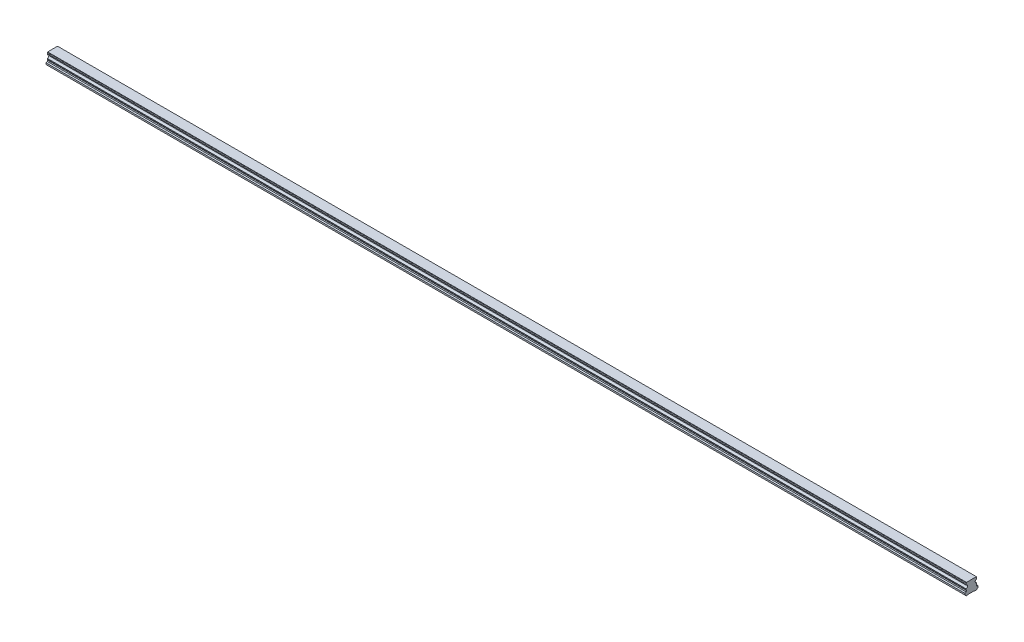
ISO-10303-21;
HEADER;
FILE_DESCRIPTION(('STEP AP214'),'2;1');
FILE_NAME('part.step','',(''),(''),'','','');
FILE_SCHEMA(('AUTOMOTIVE_DESIGN { 1 0 10303 214 1 1 1 1 }'));
ENDSEC;
DATA;
#1=APPLICATION_CONTEXT('core data for automotive mechanical design processes');
#2=APPLICATION_PROTOCOL_DEFINITION('international standard','automotive_design',2000,#1);
#3=PRODUCT_CONTEXT('',#1,'mechanical');
#4=PRODUCT('Part','Part','',(#3));
#5=PRODUCT_RELATED_PRODUCT_CATEGORY('part','',(#4));
#6=PRODUCT_DEFINITION_FORMATION('','',#4);
#7=PRODUCT_DEFINITION_CONTEXT('part definition',#1,'design');
#8=PRODUCT_DEFINITION('design','',#6,#7);
#9=PRODUCT_DEFINITION_SHAPE('','',#8);
#10=(LENGTH_UNIT() NAMED_UNIT(*) SI_UNIT(.MILLI.,.METRE.));
#11=(NAMED_UNIT(*) PLANE_ANGLE_UNIT() SI_UNIT($,.RADIAN.));
#12=(NAMED_UNIT(*) SI_UNIT($,.STERADIAN.) SOLID_ANGLE_UNIT());
#13=UNCERTAINTY_MEASURE_WITH_UNIT(LENGTH_MEASURE(1.E-05),#10,'distance_accuracy_value','');
#14=(GEOMETRIC_REPRESENTATION_CONTEXT(3) GLOBAL_UNCERTAINTY_ASSIGNED_CONTEXT((#13)) GLOBAL_UNIT_ASSIGNED_CONTEXT((#10,
#11,#12)) REPRESENTATION_CONTEXT('',''));
#15=CARTESIAN_POINT('',(0.,0.,0.));
#16=DIRECTION('',(0.,0.,1.));
#17=DIRECTION('',(1.,0.,0.));
#18=AXIS2_PLACEMENT_3D('',#15,#16,#17);
#19=CARTESIAN_POINT('',(1710.,0.499999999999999,0.));
#20=DIRECTION('',(0.,-1.,0.));
#21=DIRECTION('',(0.,0.,-1.));
#22=AXIS2_PLACEMENT_3D('',#19,#20,#21);
#23=CONICAL_SURFACE('',#22,3.5,0.785398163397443);
#24=CARTESIAN_POINT('',(1710.,1.00000000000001,0.));
#25=DIRECTION('',(0.,1.,0.));
#26=DIRECTION('',(0.,0.,1.));
#27=AXIS2_PLACEMENT_3D('',#24,#25,#26);
#28=CIRCLE('',#27,3.);
#29=CARTESIAN_POINT('',(1710.,1.00000000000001,3.));
#30=VERTEX_POINT('',#29);
#31=EDGE_CURVE('E11',#30,#30,#28,.F.);
#32=ORIENTED_EDGE('',*,*,#31,.F.);
#33=EDGE_LOOP('',(#32));
#34=FACE_BOUND('',#33,.T.);
#35=CARTESIAN_POINT('',(1710.,0.499999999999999,0.));
#36=DIRECTION('',(0.,1.,0.));
#37=DIRECTION('',(0.,0.,1.));
#38=AXIS2_PLACEMENT_3D('',#35,#36,#37);
#39=CIRCLE('',#38,3.5);
#40=CARTESIAN_POINT('',(1710.,0.5,3.5));
#41=VERTEX_POINT('',#40);
#42=EDGE_CURVE('E745',#41,#41,#39,.T.);
#43=ORIENTED_EDGE('',*,*,#42,.F.);
#44=EDGE_LOOP('',(#43));
#45=FACE_BOUND('',#44,.T.);
#46=ADVANCED_FACE('F39',(#34,#45),#23,.F.);
#47=CARTESIAN_POINT('',(1710.,12.,0.));
#48=DIRECTION('',(0.,-1.,0.));
#49=DIRECTION('',(0.,0.,-1.));
#50=AXIS2_PLACEMENT_3D('',#47,#48,#49);
#51=CYLINDRICAL_SURFACE('',#50,3.);
#52=ORIENTED_EDGE('',*,*,#31,.T.);
#53=EDGE_LOOP('',(#52));
#54=FACE_BOUND('',#53,.T.);
#55=CARTESIAN_POINT('',(1710.,12.,0.));
#56=DIRECTION('',(0.,-1.,0.));
#57=DIRECTION('',(0.,0.,-1.));
#58=AXIS2_PLACEMENT_3D('',#55,#56,#57);
#59=CIRCLE('',#58,3.);
#60=CARTESIAN_POINT('',(1710.,12.,-3.));
#61=VERTEX_POINT('',#60);
#62=EDGE_CURVE('E49',#61,#61,#59,.T.);
#63=ORIENTED_EDGE('',*,*,#62,.F.);
#64=EDGE_LOOP('',(#63));
#65=FACE_BOUND('',#64,.T.);
#66=ADVANCED_FACE('F1090',(#54,#65),#51,.F.);
#67=CARTESIAN_POINT('',(1710.,12.,0.));
#68=DIRECTION('',(0.,-1.,0.));
#69=DIRECTION('',(0.,0.,-1.));
#70=AXIS2_PLACEMENT_3D('',#67,#68,#69);
#71=PLANE('',#70);
#72=CARTESIAN_POINT('',(1710.,12.,0.));
#73=DIRECTION('',(0.,-1.,0.));
#74=DIRECTION('',(0.,0.,-1.));
#75=AXIS2_PLACEMENT_3D('',#72,#73,#74);
#76=CIRCLE('',#75,2.5);
#77=CARTESIAN_POINT('',(1710.,12.,-2.5));
#78=VERTEX_POINT('',#77);
#79=EDGE_CURVE('E42',#78,#78,#76,.T.);
#80=ORIENTED_EDGE('',*,*,#79,.F.);
#81=EDGE_LOOP('',(#80));
#82=FACE_BOUND('',#81,.T.);
#83=ORIENTED_EDGE('',*,*,#62,.T.);
#84=EDGE_LOOP('',(#83));
#85=FACE_BOUND('',#84,.T.);
#86=ADVANCED_FACE('F1095',(#82,#85),#71,.T.);
#87=CARTESIAN_POINT('',(1650.,0.499999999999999,0.));
#88=DIRECTION('',(0.,-1.,0.));
#89=DIRECTION('',(0.,0.,-1.));
#90=AXIS2_PLACEMENT_3D('',#87,#88,#89);
#91=CONICAL_SURFACE('',#90,3.5,0.785398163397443);
#92=CARTESIAN_POINT('',(1650.,1.00000000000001,0.));
#93=DIRECTION('',(0.,1.,0.));
#94=DIRECTION('',(0.,0.,1.));
#95=AXIS2_PLACEMENT_3D('',#92,#93,#94);
#96=CIRCLE('',#95,3.);
#97=CARTESIAN_POINT('',(1650.,1.00000000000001,3.));
#98=VERTEX_POINT('',#97);
#99=EDGE_CURVE('E741',#98,#98,#96,.F.);
#100=ORIENTED_EDGE('',*,*,#99,.F.);
#101=EDGE_LOOP('',(#100));
#102=FACE_BOUND('',#101,.T.);
#103=CARTESIAN_POINT('',(1650.,0.499999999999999,0.));
#104=DIRECTION('',(0.,1.,0.));
#105=DIRECTION('',(0.,0.,1.));
#106=AXIS2_PLACEMENT_3D('',#103,#104,#105);
#107=CIRCLE('',#106,3.5);
#108=CARTESIAN_POINT('',(1650.,0.5,3.5));
#109=VERTEX_POINT('',#108);
#110=EDGE_CURVE('E733',#109,#109,#107,.T.);
#111=ORIENTED_EDGE('',*,*,#110,.F.);
#112=EDGE_LOOP('',(#111));
#113=FACE_BOUND('',#112,.T.);
#114=ADVANCED_FACE('F1482',(#102,#113),#91,.F.);
#115=CARTESIAN_POINT('',(1650.,12.,0.));
#116=DIRECTION('',(0.,-1.,0.));
#117=DIRECTION('',(0.,0.,-1.));
#118=AXIS2_PLACEMENT_3D('',#115,#116,#117);
#119=CYLINDRICAL_SURFACE('',#118,3.);
#120=ORIENTED_EDGE('',*,*,#99,.T.);
#121=EDGE_LOOP('',(#120));
#122=FACE_BOUND('',#121,.T.);
#123=CARTESIAN_POINT('',(1650.,12.,0.));
#124=DIRECTION('',(0.,-1.,0.));
#125=DIRECTION('',(0.,0.,-1.));
#126=AXIS2_PLACEMENT_3D('',#123,#124,#125);
#127=CIRCLE('',#126,3.);
#128=CARTESIAN_POINT('',(1650.,12.,-3.));
#129=VERTEX_POINT('',#128);
#130=EDGE_CURVE('E737',#129,#129,#127,.T.);
#131=ORIENTED_EDGE('',*,*,#130,.F.);
#132=EDGE_LOOP('',(#131));
#133=FACE_BOUND('',#132,.T.);
#134=ADVANCED_FACE('F1478',(#122,#133),#119,.F.);
#135=CARTESIAN_POINT('',(1650.,12.,0.));
#136=DIRECTION('',(0.,-1.,0.));
#137=DIRECTION('',(0.,0.,-1.));
#138=AXIS2_PLACEMENT_3D('',#135,#136,#137);
#139=PLANE('',#138);
#140=CARTESIAN_POINT('',(1650.,12.,0.));
#141=DIRECTION('',(0.,-1.,0.));
#142=DIRECTION('',(0.,0.,-1.));
#143=AXIS2_PLACEMENT_3D('',#140,#141,#142);
#144=CIRCLE('',#143,2.5);
#145=CARTESIAN_POINT('',(1650.,12.,-2.5));
#146=VERTEX_POINT('',#145);
#147=EDGE_CURVE('E856',#146,#146,#144,.T.);
#148=ORIENTED_EDGE('',*,*,#147,.F.);
#149=EDGE_LOOP('',(#148));
#150=FACE_BOUND('',#149,.T.);
#151=ORIENTED_EDGE('',*,*,#130,.T.);
#152=EDGE_LOOP('',(#151));
#153=FACE_BOUND('',#152,.T.);
#154=ADVANCED_FACE('F1474',(#150,#153),#139,.T.);
#155=CARTESIAN_POINT('',(1590.,0.499999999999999,0.));
#156=DIRECTION('',(0.,-1.,0.));
#157=DIRECTION('',(0.,0.,-1.));
#158=AXIS2_PLACEMENT_3D('',#155,#156,#157);
#159=CONICAL_SURFACE('',#158,3.5,0.785398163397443);
#160=CARTESIAN_POINT('',(1590.,1.00000000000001,0.));
#161=DIRECTION('',(0.,1.,0.));
#162=DIRECTION('',(0.,0.,1.));
#163=AXIS2_PLACEMENT_3D('',#160,#161,#162);
#164=CIRCLE('',#163,3.);
#165=CARTESIAN_POINT('',(1590.,1.00000000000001,3.));
#166=VERTEX_POINT('',#165);
#167=EDGE_CURVE('E729',#166,#166,#164,.F.);
#168=ORIENTED_EDGE('',*,*,#167,.F.);
#169=EDGE_LOOP('',(#168));
#170=FACE_BOUND('',#169,.T.);
#171=CARTESIAN_POINT('',(1590.,0.499999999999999,0.));
#172=DIRECTION('',(0.,1.,0.));
#173=DIRECTION('',(0.,0.,1.));
#174=AXIS2_PLACEMENT_3D('',#171,#172,#173);
#175=CIRCLE('',#174,3.5);
#176=CARTESIAN_POINT('',(1590.,0.5,3.5));
#177=VERTEX_POINT('',#176);
#178=EDGE_CURVE('E721',#177,#177,#175,.T.);
#179=ORIENTED_EDGE('',*,*,#178,.F.);
#180=EDGE_LOOP('',(#179));
#181=FACE_BOUND('',#180,.T.);
#182=ADVANCED_FACE('F1470',(#170,#181),#159,.F.);
#183=CARTESIAN_POINT('',(1590.,12.,0.));
#184=DIRECTION('',(0.,-1.,0.));
#185=DIRECTION('',(0.,0.,-1.));
#186=AXIS2_PLACEMENT_3D('',#183,#184,#185);
#187=CYLINDRICAL_SURFACE('',#186,3.);
#188=ORIENTED_EDGE('',*,*,#167,.T.);
#189=EDGE_LOOP('',(#188));
#190=FACE_BOUND('',#189,.T.);
#191=CARTESIAN_POINT('',(1590.,12.,0.));
#192=DIRECTION('',(0.,-1.,0.));
#193=DIRECTION('',(0.,0.,-1.));
#194=AXIS2_PLACEMENT_3D('',#191,#192,#193);
#195=CIRCLE('',#194,3.);
#196=CARTESIAN_POINT('',(1590.,12.,-3.));
#197=VERTEX_POINT('',#196);
#198=EDGE_CURVE('E725',#197,#197,#195,.T.);
#199=ORIENTED_EDGE('',*,*,#198,.F.);
#200=EDGE_LOOP('',(#199));
#201=FACE_BOUND('',#200,.T.);
#202=ADVANCED_FACE('F1466',(#190,#201),#187,.F.);
#203=CARTESIAN_POINT('',(1590.,12.,0.));
#204=DIRECTION('',(0.,-1.,0.));
#205=DIRECTION('',(0.,0.,-1.));
#206=AXIS2_PLACEMENT_3D('',#203,#204,#205);
#207=PLANE('',#206);
#208=CARTESIAN_POINT('',(1590.,12.,0.));
#209=DIRECTION('',(0.,-1.,0.));
#210=DIRECTION('',(0.,0.,-1.));
#211=AXIS2_PLACEMENT_3D('',#208,#209,#210);
#212=CIRCLE('',#211,2.5);
#213=CARTESIAN_POINT('',(1590.,12.,-2.5));
#214=VERTEX_POINT('',#213);
#215=EDGE_CURVE('E853',#214,#214,#212,.T.);
#216=ORIENTED_EDGE('',*,*,#215,.F.);
#217=EDGE_LOOP('',(#216));
#218=FACE_BOUND('',#217,.T.);
#219=ORIENTED_EDGE('',*,*,#198,.T.);
#220=EDGE_LOOP('',(#219));
#221=FACE_BOUND('',#220,.T.);
#222=ADVANCED_FACE('F1462',(#218,#221),#207,.T.);
#223=CARTESIAN_POINT('',(1530.,0.499999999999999,0.));
#224=DIRECTION('',(0.,-1.,0.));
#225=DIRECTION('',(0.,0.,-1.));
#226=AXIS2_PLACEMENT_3D('',#223,#224,#225);
#227=CONICAL_SURFACE('',#226,3.5,0.785398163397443);
#228=CARTESIAN_POINT('',(1530.,1.00000000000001,0.));
#229=DIRECTION('',(0.,1.,0.));
#230=DIRECTION('',(0.,0.,1.));
#231=AXIS2_PLACEMENT_3D('',#228,#229,#230);
#232=CIRCLE('',#231,3.);
#233=CARTESIAN_POINT('',(1530.,1.00000000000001,3.));
#234=VERTEX_POINT('',#233);
#235=EDGE_CURVE('E717',#234,#234,#232,.F.);
#236=ORIENTED_EDGE('',*,*,#235,.F.);
#237=EDGE_LOOP('',(#236));
#238=FACE_BOUND('',#237,.T.);
#239=CARTESIAN_POINT('',(1530.,0.499999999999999,0.));
#240=DIRECTION('',(0.,1.,0.));
#241=DIRECTION('',(0.,0.,1.));
#242=AXIS2_PLACEMENT_3D('',#239,#240,#241);
#243=CIRCLE('',#242,3.5);
#244=CARTESIAN_POINT('',(1530.,0.5,3.5));
#245=VERTEX_POINT('',#244);
#246=EDGE_CURVE('E709',#245,#245,#243,.T.);
#247=ORIENTED_EDGE('',*,*,#246,.F.);
#248=EDGE_LOOP('',(#247));
#249=FACE_BOUND('',#248,.T.);
#250=ADVANCED_FACE('F1458',(#238,#249),#227,.F.);
#251=CARTESIAN_POINT('',(1530.,12.,0.));
#252=DIRECTION('',(0.,-1.,0.));
#253=DIRECTION('',(0.,0.,-1.));
#254=AXIS2_PLACEMENT_3D('',#251,#252,#253);
#255=CYLINDRICAL_SURFACE('',#254,3.);
#256=ORIENTED_EDGE('',*,*,#235,.T.);
#257=EDGE_LOOP('',(#256));
#258=FACE_BOUND('',#257,.T.);
#259=CARTESIAN_POINT('',(1530.,12.,0.));
#260=DIRECTION('',(0.,-1.,0.));
#261=DIRECTION('',(0.,0.,-1.));
#262=AXIS2_PLACEMENT_3D('',#259,#260,#261);
#263=CIRCLE('',#262,3.);
#264=CARTESIAN_POINT('',(1530.,12.,-3.));
#265=VERTEX_POINT('',#264);
#266=EDGE_CURVE('E713',#265,#265,#263,.T.);
#267=ORIENTED_EDGE('',*,*,#266,.F.);
#268=EDGE_LOOP('',(#267));
#269=FACE_BOUND('',#268,.T.);
#270=ADVANCED_FACE('F1454',(#258,#269),#255,.F.);
#271=CARTESIAN_POINT('',(1530.,12.,0.));
#272=DIRECTION('',(0.,-1.,0.));
#273=DIRECTION('',(0.,0.,-1.));
#274=AXIS2_PLACEMENT_3D('',#271,#272,#273);
#275=PLANE('',#274);
#276=CARTESIAN_POINT('',(1530.,12.,0.));
#277=DIRECTION('',(0.,-1.,0.));
#278=DIRECTION('',(0.,0.,-1.));
#279=AXIS2_PLACEMENT_3D('',#276,#277,#278);
#280=CIRCLE('',#279,2.5);
#281=CARTESIAN_POINT('',(1530.,12.,-2.5));
#282=VERTEX_POINT('',#281);
#283=EDGE_CURVE('E849',#282,#282,#280,.T.);
#284=ORIENTED_EDGE('',*,*,#283,.F.);
#285=EDGE_LOOP('',(#284));
#286=FACE_BOUND('',#285,.T.);
#287=ORIENTED_EDGE('',*,*,#266,.T.);
#288=EDGE_LOOP('',(#287));
#289=FACE_BOUND('',#288,.T.);
#290=ADVANCED_FACE('F1450',(#286,#289),#275,.T.);
#291=CARTESIAN_POINT('',(1470.,0.499999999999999,0.));
#292=DIRECTION('',(0.,-1.,0.));
#293=DIRECTION('',(0.,0.,-1.));
#294=AXIS2_PLACEMENT_3D('',#291,#292,#293);
#295=CONICAL_SURFACE('',#294,3.5,0.785398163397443);
#296=CARTESIAN_POINT('',(1470.,1.00000000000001,0.));
#297=DIRECTION('',(0.,1.,0.));
#298=DIRECTION('',(0.,0.,1.));
#299=AXIS2_PLACEMENT_3D('',#296,#297,#298);
#300=CIRCLE('',#299,3.);
#301=CARTESIAN_POINT('',(1470.,1.00000000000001,3.));
#302=VERTEX_POINT('',#301);
#303=EDGE_CURVE('E705',#302,#302,#300,.F.);
#304=ORIENTED_EDGE('',*,*,#303,.F.);
#305=EDGE_LOOP('',(#304));
#306=FACE_BOUND('',#305,.T.);
#307=CARTESIAN_POINT('',(1470.,0.499999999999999,0.));
#308=DIRECTION('',(0.,1.,0.));
#309=DIRECTION('',(0.,0.,1.));
#310=AXIS2_PLACEMENT_3D('',#307,#308,#309);
#311=CIRCLE('',#310,3.5);
#312=CARTESIAN_POINT('',(1470.,0.5,3.5));
#313=VERTEX_POINT('',#312);
#314=EDGE_CURVE('E697',#313,#313,#311,.T.);
#315=ORIENTED_EDGE('',*,*,#314,.F.);
#316=EDGE_LOOP('',(#315));
#317=FACE_BOUND('',#316,.T.);
#318=ADVANCED_FACE('F1446',(#306,#317),#295,.F.);
#319=CARTESIAN_POINT('',(1470.,12.,0.));
#320=DIRECTION('',(0.,-1.,0.));
#321=DIRECTION('',(0.,0.,-1.));
#322=AXIS2_PLACEMENT_3D('',#319,#320,#321);
#323=CYLINDRICAL_SURFACE('',#322,3.);
#324=ORIENTED_EDGE('',*,*,#303,.T.);
#325=EDGE_LOOP('',(#324));
#326=FACE_BOUND('',#325,.T.);
#327=CARTESIAN_POINT('',(1470.,12.,0.));
#328=DIRECTION('',(0.,-1.,0.));
#329=DIRECTION('',(0.,0.,-1.));
#330=AXIS2_PLACEMENT_3D('',#327,#328,#329);
#331=CIRCLE('',#330,3.);
#332=CARTESIAN_POINT('',(1470.,12.,-3.));
#333=VERTEX_POINT('',#332);
#334=EDGE_CURVE('E701',#333,#333,#331,.T.);
#335=ORIENTED_EDGE('',*,*,#334,.F.);
#336=EDGE_LOOP('',(#335));
#337=FACE_BOUND('',#336,.T.);
#338=ADVANCED_FACE('F1442',(#326,#337),#323,.F.);
#339=CARTESIAN_POINT('',(1470.,12.,0.));
#340=DIRECTION('',(0.,-1.,0.));
#341=DIRECTION('',(0.,0.,-1.));
#342=AXIS2_PLACEMENT_3D('',#339,#340,#341);
#343=PLANE('',#342);
#344=CARTESIAN_POINT('',(1470.,12.,0.));
#345=DIRECTION('',(0.,-1.,0.));
#346=DIRECTION('',(0.,0.,-1.));
#347=AXIS2_PLACEMENT_3D('',#344,#345,#346);
#348=CIRCLE('',#347,2.5);
#349=CARTESIAN_POINT('',(1470.,12.,-2.5));
#350=VERTEX_POINT('',#349);
#351=EDGE_CURVE('E845',#350,#350,#348,.T.);
#352=ORIENTED_EDGE('',*,*,#351,.F.);
#353=EDGE_LOOP('',(#352));
#354=FACE_BOUND('',#353,.T.);
#355=ORIENTED_EDGE('',*,*,#334,.T.);
#356=EDGE_LOOP('',(#355));
#357=FACE_BOUND('',#356,.T.);
#358=ADVANCED_FACE('F1438',(#354,#357),#343,.T.);
#359=CARTESIAN_POINT('',(1410.,0.499999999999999,0.));
#360=DIRECTION('',(0.,-1.,0.));
#361=DIRECTION('',(0.,0.,-1.));
#362=AXIS2_PLACEMENT_3D('',#359,#360,#361);
#363=CONICAL_SURFACE('',#362,3.5,0.785398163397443);
#364=CARTESIAN_POINT('',(1410.,1.00000000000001,0.));
#365=DIRECTION('',(0.,1.,0.));
#366=DIRECTION('',(0.,0.,1.));
#367=AXIS2_PLACEMENT_3D('',#364,#365,#366);
#368=CIRCLE('',#367,3.);
#369=CARTESIAN_POINT('',(1410.,1.00000000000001,3.));
#370=VERTEX_POINT('',#369);
#371=EDGE_CURVE('E693',#370,#370,#368,.F.);
#372=ORIENTED_EDGE('',*,*,#371,.F.);
#373=EDGE_LOOP('',(#372));
#374=FACE_BOUND('',#373,.T.);
#375=CARTESIAN_POINT('',(1410.,0.499999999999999,0.));
#376=DIRECTION('',(0.,1.,0.));
#377=DIRECTION('',(0.,0.,1.));
#378=AXIS2_PLACEMENT_3D('',#375,#376,#377);
#379=CIRCLE('',#378,3.5);
#380=CARTESIAN_POINT('',(1410.,0.5,3.5));
#381=VERTEX_POINT('',#380);
#382=EDGE_CURVE('E685',#381,#381,#379,.T.);
#383=ORIENTED_EDGE('',*,*,#382,.F.);
#384=EDGE_LOOP('',(#383));
#385=FACE_BOUND('',#384,.T.);
#386=ADVANCED_FACE('F1434',(#374,#385),#363,.F.);
#387=CARTESIAN_POINT('',(1410.,12.,0.));
#388=DIRECTION('',(0.,-1.,0.));
#389=DIRECTION('',(0.,0.,-1.));
#390=AXIS2_PLACEMENT_3D('',#387,#388,#389);
#391=CYLINDRICAL_SURFACE('',#390,3.);
#392=ORIENTED_EDGE('',*,*,#371,.T.);
#393=EDGE_LOOP('',(#392));
#394=FACE_BOUND('',#393,.T.);
#395=CARTESIAN_POINT('',(1410.,12.,0.));
#396=DIRECTION('',(0.,-1.,0.));
#397=DIRECTION('',(0.,0.,-1.));
#398=AXIS2_PLACEMENT_3D('',#395,#396,#397);
#399=CIRCLE('',#398,3.);
#400=CARTESIAN_POINT('',(1410.,12.,-3.));
#401=VERTEX_POINT('',#400);
#402=EDGE_CURVE('E689',#401,#401,#399,.T.);
#403=ORIENTED_EDGE('',*,*,#402,.F.);
#404=EDGE_LOOP('',(#403));
#405=FACE_BOUND('',#404,.T.);
#406=ADVANCED_FACE('F1430',(#394,#405),#391,.F.);
#407=CARTESIAN_POINT('',(1410.,12.,0.));
#408=DIRECTION('',(0.,-1.,0.));
#409=DIRECTION('',(0.,0.,-1.));
#410=AXIS2_PLACEMENT_3D('',#407,#408,#409);
#411=PLANE('',#410);
#412=CARTESIAN_POINT('',(1410.,12.,0.));
#413=DIRECTION('',(0.,-1.,0.));
#414=DIRECTION('',(0.,0.,-1.));
#415=AXIS2_PLACEMENT_3D('',#412,#413,#414);
#416=CIRCLE('',#415,2.5);
#417=CARTESIAN_POINT('',(1410.,12.,-2.5));
#418=VERTEX_POINT('',#417);
#419=EDGE_CURVE('E841',#418,#418,#416,.T.);
#420=ORIENTED_EDGE('',*,*,#419,.F.);
#421=EDGE_LOOP('',(#420));
#422=FACE_BOUND('',#421,.T.);
#423=ORIENTED_EDGE('',*,*,#402,.T.);
#424=EDGE_LOOP('',(#423));
#425=FACE_BOUND('',#424,.T.);
#426=ADVANCED_FACE('F1426',(#422,#425),#411,.T.);
#427=CARTESIAN_POINT('',(1350.,0.499999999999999,0.));
#428=DIRECTION('',(0.,-1.,0.));
#429=DIRECTION('',(0.,0.,-1.));
#430=AXIS2_PLACEMENT_3D('',#427,#428,#429);
#431=CONICAL_SURFACE('',#430,3.5,0.785398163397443);
#432=CARTESIAN_POINT('',(1350.,1.00000000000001,0.));
#433=DIRECTION('',(0.,1.,0.));
#434=DIRECTION('',(0.,0.,1.));
#435=AXIS2_PLACEMENT_3D('',#432,#433,#434);
#436=CIRCLE('',#435,3.);
#437=CARTESIAN_POINT('',(1350.,1.00000000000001,3.));
#438=VERTEX_POINT('',#437);
#439=EDGE_CURVE('E681',#438,#438,#436,.F.);
#440=ORIENTED_EDGE('',*,*,#439,.F.);
#441=EDGE_LOOP('',(#440));
#442=FACE_BOUND('',#441,.T.);
#443=CARTESIAN_POINT('',(1350.,0.499999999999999,0.));
#444=DIRECTION('',(0.,1.,0.));
#445=DIRECTION('',(0.,0.,1.));
#446=AXIS2_PLACEMENT_3D('',#443,#444,#445);
#447=CIRCLE('',#446,3.5);
#448=CARTESIAN_POINT('',(1350.,0.5,3.5));
#449=VERTEX_POINT('',#448);
#450=EDGE_CURVE('E673',#449,#449,#447,.T.);
#451=ORIENTED_EDGE('',*,*,#450,.F.);
#452=EDGE_LOOP('',(#451));
#453=FACE_BOUND('',#452,.T.);
#454=ADVANCED_FACE('F1422',(#442,#453),#431,.F.);
#455=CARTESIAN_POINT('',(1350.,12.,0.));
#456=DIRECTION('',(0.,-1.,0.));
#457=DIRECTION('',(0.,0.,-1.));
#458=AXIS2_PLACEMENT_3D('',#455,#456,#457);
#459=CYLINDRICAL_SURFACE('',#458,3.);
#460=ORIENTED_EDGE('',*,*,#439,.T.);
#461=EDGE_LOOP('',(#460));
#462=FACE_BOUND('',#461,.T.);
#463=CARTESIAN_POINT('',(1350.,12.,0.));
#464=DIRECTION('',(0.,-1.,0.));
#465=DIRECTION('',(0.,0.,-1.));
#466=AXIS2_PLACEMENT_3D('',#463,#464,#465);
#467=CIRCLE('',#466,3.);
#468=CARTESIAN_POINT('',(1350.,12.,-3.));
#469=VERTEX_POINT('',#468);
#470=EDGE_CURVE('E677',#469,#469,#467,.T.);
#471=ORIENTED_EDGE('',*,*,#470,.F.);
#472=EDGE_LOOP('',(#471));
#473=FACE_BOUND('',#472,.T.);
#474=ADVANCED_FACE('F1418',(#462,#473),#459,.F.);
#475=CARTESIAN_POINT('',(1350.,12.,0.));
#476=DIRECTION('',(0.,-1.,0.));
#477=DIRECTION('',(0.,0.,-1.));
#478=AXIS2_PLACEMENT_3D('',#475,#476,#477);
#479=PLANE('',#478);
#480=CARTESIAN_POINT('',(1350.,12.,0.));
#481=DIRECTION('',(0.,-1.,0.));
#482=DIRECTION('',(0.,0.,-1.));
#483=AXIS2_PLACEMENT_3D('',#480,#481,#482);
#484=CIRCLE('',#483,2.5);
#485=CARTESIAN_POINT('',(1350.,12.,-2.5));
#486=VERTEX_POINT('',#485);
#487=EDGE_CURVE('E837',#486,#486,#484,.T.);
#488=ORIENTED_EDGE('',*,*,#487,.F.);
#489=EDGE_LOOP('',(#488));
#490=FACE_BOUND('',#489,.T.);
#491=ORIENTED_EDGE('',*,*,#470,.T.);
#492=EDGE_LOOP('',(#491));
#493=FACE_BOUND('',#492,.T.);
#494=ADVANCED_FACE('F1414',(#490,#493),#479,.T.);
#495=CARTESIAN_POINT('',(1290.,0.499999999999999,0.));
#496=DIRECTION('',(0.,-1.,0.));
#497=DIRECTION('',(0.,0.,-1.));
#498=AXIS2_PLACEMENT_3D('',#495,#496,#497);
#499=CONICAL_SURFACE('',#498,3.5,0.785398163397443);
#500=CARTESIAN_POINT('',(1290.,1.00000000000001,0.));
#501=DIRECTION('',(0.,1.,0.));
#502=DIRECTION('',(0.,0.,1.));
#503=AXIS2_PLACEMENT_3D('',#500,#501,#502);
#504=CIRCLE('',#503,3.);
#505=CARTESIAN_POINT('',(1290.,1.00000000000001,3.));
#506=VERTEX_POINT('',#505);
#507=EDGE_CURVE('E669',#506,#506,#504,.F.);
#508=ORIENTED_EDGE('',*,*,#507,.F.);
#509=EDGE_LOOP('',(#508));
#510=FACE_BOUND('',#509,.T.);
#511=CARTESIAN_POINT('',(1290.,0.499999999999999,0.));
#512=DIRECTION('',(0.,1.,0.));
#513=DIRECTION('',(0.,0.,1.));
#514=AXIS2_PLACEMENT_3D('',#511,#512,#513);
#515=CIRCLE('',#514,3.5);
#516=CARTESIAN_POINT('',(1290.,0.5,3.5));
#517=VERTEX_POINT('',#516);
#518=EDGE_CURVE('E661',#517,#517,#515,.T.);
#519=ORIENTED_EDGE('',*,*,#518,.F.);
#520=EDGE_LOOP('',(#519));
#521=FACE_BOUND('',#520,.T.);
#522=ADVANCED_FACE('F1410',(#510,#521),#499,.F.);
#523=CARTESIAN_POINT('',(1290.,12.,0.));
#524=DIRECTION('',(0.,-1.,0.));
#525=DIRECTION('',(0.,0.,-1.));
#526=AXIS2_PLACEMENT_3D('',#523,#524,#525);
#527=CYLINDRICAL_SURFACE('',#526,3.);
#528=ORIENTED_EDGE('',*,*,#507,.T.);
#529=EDGE_LOOP('',(#528));
#530=FACE_BOUND('',#529,.T.);
#531=CARTESIAN_POINT('',(1290.,12.,0.));
#532=DIRECTION('',(0.,-1.,0.));
#533=DIRECTION('',(0.,0.,-1.));
#534=AXIS2_PLACEMENT_3D('',#531,#532,#533);
#535=CIRCLE('',#534,3.);
#536=CARTESIAN_POINT('',(1290.,12.,-3.));
#537=VERTEX_POINT('',#536);
#538=EDGE_CURVE('E665',#537,#537,#535,.T.);
#539=ORIENTED_EDGE('',*,*,#538,.F.);
#540=EDGE_LOOP('',(#539));
#541=FACE_BOUND('',#540,.T.);
#542=ADVANCED_FACE('F1406',(#530,#541),#527,.F.);
#543=CARTESIAN_POINT('',(1290.,12.,0.));
#544=DIRECTION('',(0.,-1.,0.));
#545=DIRECTION('',(0.,0.,-1.));
#546=AXIS2_PLACEMENT_3D('',#543,#544,#545);
#547=PLANE('',#546);
#548=CARTESIAN_POINT('',(1290.,12.,0.));
#549=DIRECTION('',(0.,-1.,0.));
#550=DIRECTION('',(0.,0.,-1.));
#551=AXIS2_PLACEMENT_3D('',#548,#549,#550);
#552=CIRCLE('',#551,2.5);
#553=CARTESIAN_POINT('',(1290.,12.,-2.5));
#554=VERTEX_POINT('',#553);
#555=EDGE_CURVE('E833',#554,#554,#552,.T.);
#556=ORIENTED_EDGE('',*,*,#555,.F.);
#557=EDGE_LOOP('',(#556));
#558=FACE_BOUND('',#557,.T.);
#559=ORIENTED_EDGE('',*,*,#538,.T.);
#560=EDGE_LOOP('',(#559));
#561=FACE_BOUND('',#560,.T.);
#562=ADVANCED_FACE('F1402',(#558,#561),#547,.T.);
#563=CARTESIAN_POINT('',(1230.,0.499999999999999,0.));
#564=DIRECTION('',(0.,-1.,0.));
#565=DIRECTION('',(0.,0.,-1.));
#566=AXIS2_PLACEMENT_3D('',#563,#564,#565);
#567=CONICAL_SURFACE('',#566,3.5,0.785398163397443);
#568=CARTESIAN_POINT('',(1230.,1.00000000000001,0.));
#569=DIRECTION('',(0.,1.,0.));
#570=DIRECTION('',(0.,0.,1.));
#571=AXIS2_PLACEMENT_3D('',#568,#569,#570);
#572=CIRCLE('',#571,3.);
#573=CARTESIAN_POINT('',(1230.,1.00000000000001,3.));
#574=VERTEX_POINT('',#573);
#575=EDGE_CURVE('E657',#574,#574,#572,.F.);
#576=ORIENTED_EDGE('',*,*,#575,.F.);
#577=EDGE_LOOP('',(#576));
#578=FACE_BOUND('',#577,.T.);
#579=CARTESIAN_POINT('',(1230.,0.499999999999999,0.));
#580=DIRECTION('',(0.,1.,0.));
#581=DIRECTION('',(0.,0.,1.));
#582=AXIS2_PLACEMENT_3D('',#579,#580,#581);
#583=CIRCLE('',#582,3.5);
#584=CARTESIAN_POINT('',(1230.,0.5,3.5));
#585=VERTEX_POINT('',#584);
#586=EDGE_CURVE('E649',#585,#585,#583,.T.);
#587=ORIENTED_EDGE('',*,*,#586,.F.);
#588=EDGE_LOOP('',(#587));
#589=FACE_BOUND('',#588,.T.);
#590=ADVANCED_FACE('F1398',(#578,#589),#567,.F.);
#591=CARTESIAN_POINT('',(1230.,12.,0.));
#592=DIRECTION('',(0.,-1.,0.));
#593=DIRECTION('',(0.,0.,-1.));
#594=AXIS2_PLACEMENT_3D('',#591,#592,#593);
#595=CYLINDRICAL_SURFACE('',#594,3.);
#596=ORIENTED_EDGE('',*,*,#575,.T.);
#597=EDGE_LOOP('',(#596));
#598=FACE_BOUND('',#597,.T.);
#599=CARTESIAN_POINT('',(1230.,12.,0.));
#600=DIRECTION('',(0.,-1.,0.));
#601=DIRECTION('',(0.,0.,-1.));
#602=AXIS2_PLACEMENT_3D('',#599,#600,#601);
#603=CIRCLE('',#602,3.);
#604=CARTESIAN_POINT('',(1230.,12.,-3.));
#605=VERTEX_POINT('',#604);
#606=EDGE_CURVE('E653',#605,#605,#603,.T.);
#607=ORIENTED_EDGE('',*,*,#606,.F.);
#608=EDGE_LOOP('',(#607));
#609=FACE_BOUND('',#608,.T.);
#610=ADVANCED_FACE('F1394',(#598,#609),#595,.F.);
#611=CARTESIAN_POINT('',(1230.,12.,0.));
#612=DIRECTION('',(0.,-1.,0.));
#613=DIRECTION('',(0.,0.,-1.));
#614=AXIS2_PLACEMENT_3D('',#611,#612,#613);
#615=PLANE('',#614);
#616=CARTESIAN_POINT('',(1230.,12.,0.));
#617=DIRECTION('',(0.,-1.,0.));
#618=DIRECTION('',(0.,0.,-1.));
#619=AXIS2_PLACEMENT_3D('',#616,#617,#618);
#620=CIRCLE('',#619,2.5);
#621=CARTESIAN_POINT('',(1230.,12.,-2.5));
#622=VERTEX_POINT('',#621);
#623=EDGE_CURVE('E829',#622,#622,#620,.T.);
#624=ORIENTED_EDGE('',*,*,#623,.F.);
#625=EDGE_LOOP('',(#624));
#626=FACE_BOUND('',#625,.T.);
#627=ORIENTED_EDGE('',*,*,#606,.T.);
#628=EDGE_LOOP('',(#627));
#629=FACE_BOUND('',#628,.T.);
#630=ADVANCED_FACE('F1390',(#626,#629),#615,.T.);
#631=CARTESIAN_POINT('',(1170.,0.499999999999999,0.));
#632=DIRECTION('',(0.,-1.,0.));
#633=DIRECTION('',(0.,0.,-1.));
#634=AXIS2_PLACEMENT_3D('',#631,#632,#633);
#635=CONICAL_SURFACE('',#634,3.5,0.785398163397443);
#636=CARTESIAN_POINT('',(1170.,1.00000000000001,0.));
#637=DIRECTION('',(0.,1.,0.));
#638=DIRECTION('',(0.,0.,1.));
#639=AXIS2_PLACEMENT_3D('',#636,#637,#638);
#640=CIRCLE('',#639,3.);
#641=CARTESIAN_POINT('',(1170.,1.00000000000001,3.));
#642=VERTEX_POINT('',#641);
#643=EDGE_CURVE('E645',#642,#642,#640,.F.);
#644=ORIENTED_EDGE('',*,*,#643,.F.);
#645=EDGE_LOOP('',(#644));
#646=FACE_BOUND('',#645,.T.);
#647=CARTESIAN_POINT('',(1170.,0.499999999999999,0.));
#648=DIRECTION('',(0.,1.,0.));
#649=DIRECTION('',(0.,0.,1.));
#650=AXIS2_PLACEMENT_3D('',#647,#648,#649);
#651=CIRCLE('',#650,3.5);
#652=CARTESIAN_POINT('',(1170.,0.5,3.5));
#653=VERTEX_POINT('',#652);
#654=EDGE_CURVE('E637',#653,#653,#651,.T.);
#655=ORIENTED_EDGE('',*,*,#654,.F.);
#656=EDGE_LOOP('',(#655));
#657=FACE_BOUND('',#656,.T.);
#658=ADVANCED_FACE('F1386',(#646,#657),#635,.F.);
#659=CARTESIAN_POINT('',(1170.,12.,0.));
#660=DIRECTION('',(0.,-1.,0.));
#661=DIRECTION('',(0.,0.,-1.));
#662=AXIS2_PLACEMENT_3D('',#659,#660,#661);
#663=CYLINDRICAL_SURFACE('',#662,3.);
#664=ORIENTED_EDGE('',*,*,#643,.T.);
#665=EDGE_LOOP('',(#664));
#666=FACE_BOUND('',#665,.T.);
#667=CARTESIAN_POINT('',(1170.,12.,0.));
#668=DIRECTION('',(0.,-1.,0.));
#669=DIRECTION('',(0.,0.,-1.));
#670=AXIS2_PLACEMENT_3D('',#667,#668,#669);
#671=CIRCLE('',#670,3.);
#672=CARTESIAN_POINT('',(1170.,12.,-3.));
#673=VERTEX_POINT('',#672);
#674=EDGE_CURVE('E641',#673,#673,#671,.T.);
#675=ORIENTED_EDGE('',*,*,#674,.F.);
#676=EDGE_LOOP('',(#675));
#677=FACE_BOUND('',#676,.T.);
#678=ADVANCED_FACE('F1382',(#666,#677),#663,.F.);
#679=CARTESIAN_POINT('',(1170.,12.,0.));
#680=DIRECTION('',(0.,-1.,0.));
#681=DIRECTION('',(0.,0.,-1.));
#682=AXIS2_PLACEMENT_3D('',#679,#680,#681);
#683=PLANE('',#682);
#684=CARTESIAN_POINT('',(1170.,12.,0.));
#685=DIRECTION('',(0.,-1.,0.));
#686=DIRECTION('',(0.,0.,-1.));
#687=AXIS2_PLACEMENT_3D('',#684,#685,#686);
#688=CIRCLE('',#687,2.5);
#689=CARTESIAN_POINT('',(1170.,12.,-2.5));
#690=VERTEX_POINT('',#689);
#691=EDGE_CURVE('E825',#690,#690,#688,.T.);
#692=ORIENTED_EDGE('',*,*,#691,.F.);
#693=EDGE_LOOP('',(#692));
#694=FACE_BOUND('',#693,.T.);
#695=ORIENTED_EDGE('',*,*,#674,.T.);
#696=EDGE_LOOP('',(#695));
#697=FACE_BOUND('',#696,.T.);
#698=ADVANCED_FACE('F1378',(#694,#697),#683,.T.);
#699=CARTESIAN_POINT('',(1110.,0.499999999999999,0.));
#700=DIRECTION('',(0.,-1.,0.));
#701=DIRECTION('',(0.,0.,-1.));
#702=AXIS2_PLACEMENT_3D('',#699,#700,#701);
#703=CONICAL_SURFACE('',#702,3.5,0.785398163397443);
#704=CARTESIAN_POINT('',(1110.,1.00000000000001,0.));
#705=DIRECTION('',(0.,1.,0.));
#706=DIRECTION('',(0.,0.,1.));
#707=AXIS2_PLACEMENT_3D('',#704,#705,#706);
#708=CIRCLE('',#707,3.);
#709=CARTESIAN_POINT('',(1110.,1.00000000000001,3.));
#710=VERTEX_POINT('',#709);
#711=EDGE_CURVE('E633',#710,#710,#708,.F.);
#712=ORIENTED_EDGE('',*,*,#711,.F.);
#713=EDGE_LOOP('',(#712));
#714=FACE_BOUND('',#713,.T.);
#715=CARTESIAN_POINT('',(1110.,0.499999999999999,0.));
#716=DIRECTION('',(0.,1.,0.));
#717=DIRECTION('',(0.,0.,1.));
#718=AXIS2_PLACEMENT_3D('',#715,#716,#717);
#719=CIRCLE('',#718,3.5);
#720=CARTESIAN_POINT('',(1110.,0.5,3.5));
#721=VERTEX_POINT('',#720);
#722=EDGE_CURVE('E625',#721,#721,#719,.T.);
#723=ORIENTED_EDGE('',*,*,#722,.F.);
#724=EDGE_LOOP('',(#723));
#725=FACE_BOUND('',#724,.T.);
#726=ADVANCED_FACE('F1374',(#714,#725),#703,.F.);
#727=CARTESIAN_POINT('',(1110.,12.,0.));
#728=DIRECTION('',(0.,-1.,0.));
#729=DIRECTION('',(0.,0.,-1.));
#730=AXIS2_PLACEMENT_3D('',#727,#728,#729);
#731=CYLINDRICAL_SURFACE('',#730,3.);
#732=ORIENTED_EDGE('',*,*,#711,.T.);
#733=EDGE_LOOP('',(#732));
#734=FACE_BOUND('',#733,.T.);
#735=CARTESIAN_POINT('',(1110.,12.,0.));
#736=DIRECTION('',(0.,-1.,0.));
#737=DIRECTION('',(0.,0.,-1.));
#738=AXIS2_PLACEMENT_3D('',#735,#736,#737);
#739=CIRCLE('',#738,3.);
#740=CARTESIAN_POINT('',(1110.,12.,-3.));
#741=VERTEX_POINT('',#740);
#742=EDGE_CURVE('E629',#741,#741,#739,.T.);
#743=ORIENTED_EDGE('',*,*,#742,.F.);
#744=EDGE_LOOP('',(#743));
#745=FACE_BOUND('',#744,.T.);
#746=ADVANCED_FACE('F1370',(#734,#745),#731,.F.);
#747=CARTESIAN_POINT('',(1110.,12.,0.));
#748=DIRECTION('',(0.,-1.,0.));
#749=DIRECTION('',(0.,0.,-1.));
#750=AXIS2_PLACEMENT_3D('',#747,#748,#749);
#751=PLANE('',#750);
#752=CARTESIAN_POINT('',(1110.,12.,0.));
#753=DIRECTION('',(0.,-1.,0.));
#754=DIRECTION('',(0.,0.,-1.));
#755=AXIS2_PLACEMENT_3D('',#752,#753,#754);
#756=CIRCLE('',#755,2.5);
#757=CARTESIAN_POINT('',(1110.,12.,-2.5));
#758=VERTEX_POINT('',#757);
#759=EDGE_CURVE('E821',#758,#758,#756,.T.);
#760=ORIENTED_EDGE('',*,*,#759,.F.);
#761=EDGE_LOOP('',(#760));
#762=FACE_BOUND('',#761,.T.);
#763=ORIENTED_EDGE('',*,*,#742,.T.);
#764=EDGE_LOOP('',(#763));
#765=FACE_BOUND('',#764,.T.);
#766=ADVANCED_FACE('F1366',(#762,#765),#751,.T.);
#767=CARTESIAN_POINT('',(1050.,0.499999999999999,0.));
#768=DIRECTION('',(0.,-1.,0.));
#769=DIRECTION('',(0.,0.,-1.));
#770=AXIS2_PLACEMENT_3D('',#767,#768,#769);
#771=CONICAL_SURFACE('',#770,3.5,0.785398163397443);
#772=CARTESIAN_POINT('',(1050.,1.00000000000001,0.));
#773=DIRECTION('',(0.,1.,0.));
#774=DIRECTION('',(0.,0.,1.));
#775=AXIS2_PLACEMENT_3D('',#772,#773,#774);
#776=CIRCLE('',#775,3.);
#777=CARTESIAN_POINT('',(1050.,1.00000000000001,3.));
#778=VERTEX_POINT('',#777);
#779=EDGE_CURVE('E621',#778,#778,#776,.F.);
#780=ORIENTED_EDGE('',*,*,#779,.F.);
#781=EDGE_LOOP('',(#780));
#782=FACE_BOUND('',#781,.T.);
#783=CARTESIAN_POINT('',(1050.,0.499999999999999,0.));
#784=DIRECTION('',(0.,1.,0.));
#785=DIRECTION('',(0.,0.,1.));
#786=AXIS2_PLACEMENT_3D('',#783,#784,#785);
#787=CIRCLE('',#786,3.5);
#788=CARTESIAN_POINT('',(1050.,0.5,3.5));
#789=VERTEX_POINT('',#788);
#790=EDGE_CURVE('E613',#789,#789,#787,.T.);
#791=ORIENTED_EDGE('',*,*,#790,.F.);
#792=EDGE_LOOP('',(#791));
#793=FACE_BOUND('',#792,.T.);
#794=ADVANCED_FACE('F1362',(#782,#793),#771,.F.);
#795=CARTESIAN_POINT('',(1050.,12.,0.));
#796=DIRECTION('',(0.,-1.,0.));
#797=DIRECTION('',(0.,0.,-1.));
#798=AXIS2_PLACEMENT_3D('',#795,#796,#797);
#799=CYLINDRICAL_SURFACE('',#798,3.);
#800=ORIENTED_EDGE('',*,*,#779,.T.);
#801=EDGE_LOOP('',(#800));
#802=FACE_BOUND('',#801,.T.);
#803=CARTESIAN_POINT('',(1050.,12.,0.));
#804=DIRECTION('',(0.,-1.,0.));
#805=DIRECTION('',(0.,0.,-1.));
#806=AXIS2_PLACEMENT_3D('',#803,#804,#805);
#807=CIRCLE('',#806,3.);
#808=CARTESIAN_POINT('',(1050.,12.,-3.));
#809=VERTEX_POINT('',#808);
#810=EDGE_CURVE('E617',#809,#809,#807,.T.);
#811=ORIENTED_EDGE('',*,*,#810,.F.);
#812=EDGE_LOOP('',(#811));
#813=FACE_BOUND('',#812,.T.);
#814=ADVANCED_FACE('F1358',(#802,#813),#799,.F.);
#815=CARTESIAN_POINT('',(1050.,12.,0.));
#816=DIRECTION('',(0.,-1.,0.));
#817=DIRECTION('',(0.,0.,-1.));
#818=AXIS2_PLACEMENT_3D('',#815,#816,#817);
#819=PLANE('',#818);
#820=CARTESIAN_POINT('',(1050.,12.,0.));
#821=DIRECTION('',(0.,-1.,0.));
#822=DIRECTION('',(0.,0.,-1.));
#823=AXIS2_PLACEMENT_3D('',#820,#821,#822);
#824=CIRCLE('',#823,2.5);
#825=CARTESIAN_POINT('',(1050.,12.,-2.5));
#826=VERTEX_POINT('',#825);
#827=EDGE_CURVE('E817',#826,#826,#824,.T.);
#828=ORIENTED_EDGE('',*,*,#827,.F.);
#829=EDGE_LOOP('',(#828));
#830=FACE_BOUND('',#829,.T.);
#831=ORIENTED_EDGE('',*,*,#810,.T.);
#832=EDGE_LOOP('',(#831));
#833=FACE_BOUND('',#832,.T.);
#834=ADVANCED_FACE('F1354',(#830,#833),#819,.T.);
#835=CARTESIAN_POINT('',(990.,0.499999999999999,0.));
#836=DIRECTION('',(0.,-1.,0.));
#837=DIRECTION('',(0.,0.,-1.));
#838=AXIS2_PLACEMENT_3D('',#835,#836,#837);
#839=CONICAL_SURFACE('',#838,3.5,0.785398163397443);
#840=CARTESIAN_POINT('',(990.,1.00000000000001,0.));
#841=DIRECTION('',(0.,1.,0.));
#842=DIRECTION('',(0.,0.,1.));
#843=AXIS2_PLACEMENT_3D('',#840,#841,#842);
#844=CIRCLE('',#843,3.);
#845=CARTESIAN_POINT('',(990.,1.00000000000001,3.));
#846=VERTEX_POINT('',#845);
#847=EDGE_CURVE('E609',#846,#846,#844,.F.);
#848=ORIENTED_EDGE('',*,*,#847,.F.);
#849=EDGE_LOOP('',(#848));
#850=FACE_BOUND('',#849,.T.);
#851=CARTESIAN_POINT('',(990.,0.499999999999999,0.));
#852=DIRECTION('',(0.,1.,0.));
#853=DIRECTION('',(0.,0.,1.));
#854=AXIS2_PLACEMENT_3D('',#851,#852,#853);
#855=CIRCLE('',#854,3.5);
#856=CARTESIAN_POINT('',(990.,0.5,3.5));
#857=VERTEX_POINT('',#856);
#858=EDGE_CURVE('E601',#857,#857,#855,.T.);
#859=ORIENTED_EDGE('',*,*,#858,.F.);
#860=EDGE_LOOP('',(#859));
#861=FACE_BOUND('',#860,.T.);
#862=ADVANCED_FACE('F1350',(#850,#861),#839,.F.);
#863=CARTESIAN_POINT('',(990.,12.,0.));
#864=DIRECTION('',(0.,-1.,0.));
#865=DIRECTION('',(0.,0.,-1.));
#866=AXIS2_PLACEMENT_3D('',#863,#864,#865);
#867=CYLINDRICAL_SURFACE('',#866,3.);
#868=ORIENTED_EDGE('',*,*,#847,.T.);
#869=EDGE_LOOP('',(#868));
#870=FACE_BOUND('',#869,.T.);
#871=CARTESIAN_POINT('',(990.,12.,0.));
#872=DIRECTION('',(0.,-1.,0.));
#873=DIRECTION('',(0.,0.,-1.));
#874=AXIS2_PLACEMENT_3D('',#871,#872,#873);
#875=CIRCLE('',#874,3.);
#876=CARTESIAN_POINT('',(990.,12.,-3.));
#877=VERTEX_POINT('',#876);
#878=EDGE_CURVE('E605',#877,#877,#875,.T.);
#879=ORIENTED_EDGE('',*,*,#878,.F.);
#880=EDGE_LOOP('',(#879));
#881=FACE_BOUND('',#880,.T.);
#882=ADVANCED_FACE('F1346',(#870,#881),#867,.F.);
#883=CARTESIAN_POINT('',(990.,12.,0.));
#884=DIRECTION('',(0.,-1.,0.));
#885=DIRECTION('',(0.,0.,-1.));
#886=AXIS2_PLACEMENT_3D('',#883,#884,#885);
#887=PLANE('',#886);
#888=CARTESIAN_POINT('',(990.,12.,0.));
#889=DIRECTION('',(0.,-1.,0.));
#890=DIRECTION('',(0.,0.,-1.));
#891=AXIS2_PLACEMENT_3D('',#888,#889,#890);
#892=CIRCLE('',#891,2.5);
#893=CARTESIAN_POINT('',(990.,12.,-2.5));
#894=VERTEX_POINT('',#893);
#895=EDGE_CURVE('E813',#894,#894,#892,.T.);
#896=ORIENTED_EDGE('',*,*,#895,.F.);
#897=EDGE_LOOP('',(#896));
#898=FACE_BOUND('',#897,.T.);
#899=ORIENTED_EDGE('',*,*,#878,.T.);
#900=EDGE_LOOP('',(#899));
#901=FACE_BOUND('',#900,.T.);
#902=ADVANCED_FACE('F1342',(#898,#901),#887,.T.);
#903=CARTESIAN_POINT('',(930.,0.499999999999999,0.));
#904=DIRECTION('',(0.,-1.,0.));
#905=DIRECTION('',(0.,0.,-1.));
#906=AXIS2_PLACEMENT_3D('',#903,#904,#905);
#907=CONICAL_SURFACE('',#906,3.5,0.785398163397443);
#908=CARTESIAN_POINT('',(930.,1.00000000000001,0.));
#909=DIRECTION('',(0.,1.,0.));
#910=DIRECTION('',(0.,0.,1.));
#911=AXIS2_PLACEMENT_3D('',#908,#909,#910);
#912=CIRCLE('',#911,3.);
#913=CARTESIAN_POINT('',(930.,1.00000000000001,3.));
#914=VERTEX_POINT('',#913);
#915=EDGE_CURVE('E597',#914,#914,#912,.F.);
#916=ORIENTED_EDGE('',*,*,#915,.F.);
#917=EDGE_LOOP('',(#916));
#918=FACE_BOUND('',#917,.T.);
#919=CARTESIAN_POINT('',(930.,0.499999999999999,0.));
#920=DIRECTION('',(0.,1.,0.));
#921=DIRECTION('',(0.,0.,1.));
#922=AXIS2_PLACEMENT_3D('',#919,#920,#921);
#923=CIRCLE('',#922,3.5);
#924=CARTESIAN_POINT('',(930.,0.5,3.5));
#925=VERTEX_POINT('',#924);
#926=EDGE_CURVE('E589',#925,#925,#923,.T.);
#927=ORIENTED_EDGE('',*,*,#926,.F.);
#928=EDGE_LOOP('',(#927));
#929=FACE_BOUND('',#928,.T.);
#930=ADVANCED_FACE('F1338',(#918,#929),#907,.F.);
#931=CARTESIAN_POINT('',(930.,12.,0.));
#932=DIRECTION('',(0.,-1.,0.));
#933=DIRECTION('',(0.,0.,-1.));
#934=AXIS2_PLACEMENT_3D('',#931,#932,#933);
#935=CYLINDRICAL_SURFACE('',#934,3.);
#936=ORIENTED_EDGE('',*,*,#915,.T.);
#937=EDGE_LOOP('',(#936));
#938=FACE_BOUND('',#937,.T.);
#939=CARTESIAN_POINT('',(930.,12.,0.));
#940=DIRECTION('',(0.,-1.,0.));
#941=DIRECTION('',(0.,0.,-1.));
#942=AXIS2_PLACEMENT_3D('',#939,#940,#941);
#943=CIRCLE('',#942,3.);
#944=CARTESIAN_POINT('',(930.,12.,-3.));
#945=VERTEX_POINT('',#944);
#946=EDGE_CURVE('E593',#945,#945,#943,.T.);
#947=ORIENTED_EDGE('',*,*,#946,.F.);
#948=EDGE_LOOP('',(#947));
#949=FACE_BOUND('',#948,.T.);
#950=ADVANCED_FACE('F1334',(#938,#949),#935,.F.);
#951=CARTESIAN_POINT('',(930.,12.,0.));
#952=DIRECTION('',(0.,-1.,0.));
#953=DIRECTION('',(0.,0.,-1.));
#954=AXIS2_PLACEMENT_3D('',#951,#952,#953);
#955=PLANE('',#954);
#956=CARTESIAN_POINT('',(930.,12.,0.));
#957=DIRECTION('',(0.,-1.,0.));
#958=DIRECTION('',(0.,0.,-1.));
#959=AXIS2_PLACEMENT_3D('',#956,#957,#958);
#960=CIRCLE('',#959,2.5);
#961=CARTESIAN_POINT('',(930.,12.,-2.5));
#962=VERTEX_POINT('',#961);
#963=EDGE_CURVE('E809',#962,#962,#960,.T.);
#964=ORIENTED_EDGE('',*,*,#963,.F.);
#965=EDGE_LOOP('',(#964));
#966=FACE_BOUND('',#965,.T.);
#967=ORIENTED_EDGE('',*,*,#946,.T.);
#968=EDGE_LOOP('',(#967));
#969=FACE_BOUND('',#968,.T.);
#970=ADVANCED_FACE('F1330',(#966,#969),#955,.T.);
#971=CARTESIAN_POINT('',(870.,0.499999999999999,0.));
#972=DIRECTION('',(0.,-1.,0.));
#973=DIRECTION('',(0.,0.,-1.));
#974=AXIS2_PLACEMENT_3D('',#971,#972,#973);
#975=CONICAL_SURFACE('',#974,3.5,0.785398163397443);
#976=CARTESIAN_POINT('',(870.,1.00000000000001,0.));
#977=DIRECTION('',(0.,1.,0.));
#978=DIRECTION('',(0.,0.,1.));
#979=AXIS2_PLACEMENT_3D('',#976,#977,#978);
#980=CIRCLE('',#979,3.);
#981=CARTESIAN_POINT('',(870.,1.00000000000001,3.));
#982=VERTEX_POINT('',#981);
#983=EDGE_CURVE('E585',#982,#982,#980,.F.);
#984=ORIENTED_EDGE('',*,*,#983,.F.);
#985=EDGE_LOOP('',(#984));
#986=FACE_BOUND('',#985,.T.);
#987=CARTESIAN_POINT('',(870.,0.499999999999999,0.));
#988=DIRECTION('',(0.,1.,0.));
#989=DIRECTION('',(0.,0.,1.));
#990=AXIS2_PLACEMENT_3D('',#987,#988,#989);
#991=CIRCLE('',#990,3.5);
#992=CARTESIAN_POINT('',(870.,0.5,3.5));
#993=VERTEX_POINT('',#992);
#994=EDGE_CURVE('E577',#993,#993,#991,.T.);
#995=ORIENTED_EDGE('',*,*,#994,.F.);
#996=EDGE_LOOP('',(#995));
#997=FACE_BOUND('',#996,.T.);
#998=ADVANCED_FACE('F1326',(#986,#997),#975,.F.);
#999=CARTESIAN_POINT('',(870.,12.,0.));
#1000=DIRECTION('',(0.,-1.,0.));
#1001=DIRECTION('',(0.,0.,-1.));
#1002=AXIS2_PLACEMENT_3D('',#999,#1000,#1001);
#1003=CYLINDRICAL_SURFACE('',#1002,3.);
#1004=ORIENTED_EDGE('',*,*,#983,.T.);
#1005=EDGE_LOOP('',(#1004));
#1006=FACE_BOUND('',#1005,.T.);
#1007=CARTESIAN_POINT('',(870.,12.,0.));
#1008=DIRECTION('',(0.,-1.,0.));
#1009=DIRECTION('',(0.,0.,-1.));
#1010=AXIS2_PLACEMENT_3D('',#1007,#1008,#1009);
#1011=CIRCLE('',#1010,3.);
#1012=CARTESIAN_POINT('',(870.,12.,-3.));
#1013=VERTEX_POINT('',#1012);
#1014=EDGE_CURVE('E581',#1013,#1013,#1011,.T.);
#1015=ORIENTED_EDGE('',*,*,#1014,.F.);
#1016=EDGE_LOOP('',(#1015));
#1017=FACE_BOUND('',#1016,.T.);
#1018=ADVANCED_FACE('F1322',(#1006,#1017),#1003,.F.);
#1019=CARTESIAN_POINT('',(870.,12.,0.));
#1020=DIRECTION('',(0.,-1.,0.));
#1021=DIRECTION('',(0.,0.,-1.));
#1022=AXIS2_PLACEMENT_3D('',#1019,#1020,#1021);
#1023=PLANE('',#1022);
#1024=CARTESIAN_POINT('',(870.,12.,0.));
#1025=DIRECTION('',(0.,-1.,0.));
#1026=DIRECTION('',(0.,0.,-1.));
#1027=AXIS2_PLACEMENT_3D('',#1024,#1025,#1026);
#1028=CIRCLE('',#1027,2.5);
#1029=CARTESIAN_POINT('',(870.,12.,-2.5));
#1030=VERTEX_POINT('',#1029);
#1031=EDGE_CURVE('E805',#1030,#1030,#1028,.T.);
#1032=ORIENTED_EDGE('',*,*,#1031,.F.);
#1033=EDGE_LOOP('',(#1032));
#1034=FACE_BOUND('',#1033,.T.);
#1035=ORIENTED_EDGE('',*,*,#1014,.T.);
#1036=EDGE_LOOP('',(#1035));
#1037=FACE_BOUND('',#1036,.T.);
#1038=ADVANCED_FACE('F1318',(#1034,#1037),#1023,.T.);
#1039=CARTESIAN_POINT('',(810.,0.499999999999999,0.));
#1040=DIRECTION('',(0.,-1.,0.));
#1041=DIRECTION('',(0.,0.,-1.));
#1042=AXIS2_PLACEMENT_3D('',#1039,#1040,#1041);
#1043=CONICAL_SURFACE('',#1042,3.5,0.785398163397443);
#1044=CARTESIAN_POINT('',(810.,1.00000000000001,0.));
#1045=DIRECTION('',(0.,1.,0.));
#1046=DIRECTION('',(0.,0.,1.));
#1047=AXIS2_PLACEMENT_3D('',#1044,#1045,#1046);
#1048=CIRCLE('',#1047,3.);
#1049=CARTESIAN_POINT('',(810.,1.00000000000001,3.));
#1050=VERTEX_POINT('',#1049);
#1051=EDGE_CURVE('E573',#1050,#1050,#1048,.F.);
#1052=ORIENTED_EDGE('',*,*,#1051,.F.);
#1053=EDGE_LOOP('',(#1052));
#1054=FACE_BOUND('',#1053,.T.);
#1055=CARTESIAN_POINT('',(810.,0.499999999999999,0.));
#1056=DIRECTION('',(0.,1.,0.));
#1057=DIRECTION('',(0.,0.,1.));
#1058=AXIS2_PLACEMENT_3D('',#1055,#1056,#1057);
#1059=CIRCLE('',#1058,3.5);
#1060=CARTESIAN_POINT('',(810.,0.5,3.5));
#1061=VERTEX_POINT('',#1060);
#1062=EDGE_CURVE('E565',#1061,#1061,#1059,.T.);
#1063=ORIENTED_EDGE('',*,*,#1062,.F.);
#1064=EDGE_LOOP('',(#1063));
#1065=FACE_BOUND('',#1064,.T.);
#1066=ADVANCED_FACE('F1314',(#1054,#1065),#1043,.F.);
#1067=CARTESIAN_POINT('',(810.,12.,0.));
#1068=DIRECTION('',(0.,-1.,0.));
#1069=DIRECTION('',(0.,0.,-1.));
#1070=AXIS2_PLACEMENT_3D('',#1067,#1068,#1069);
#1071=CYLINDRICAL_SURFACE('',#1070,3.);
#1072=ORIENTED_EDGE('',*,*,#1051,.T.);
#1073=EDGE_LOOP('',(#1072));
#1074=FACE_BOUND('',#1073,.T.);
#1075=CARTESIAN_POINT('',(810.,12.,0.));
#1076=DIRECTION('',(0.,-1.,0.));
#1077=DIRECTION('',(0.,0.,-1.));
#1078=AXIS2_PLACEMENT_3D('',#1075,#1076,#1077);
#1079=CIRCLE('',#1078,3.);
#1080=CARTESIAN_POINT('',(810.,12.,-3.));
#1081=VERTEX_POINT('',#1080);
#1082=EDGE_CURVE('E569',#1081,#1081,#1079,.T.);
#1083=ORIENTED_EDGE('',*,*,#1082,.F.);
#1084=EDGE_LOOP('',(#1083));
#1085=FACE_BOUND('',#1084,.T.);
#1086=ADVANCED_FACE('F1310',(#1074,#1085),#1071,.F.);
#1087=CARTESIAN_POINT('',(810.,12.,0.));
#1088=DIRECTION('',(0.,-1.,0.));
#1089=DIRECTION('',(0.,0.,-1.));
#1090=AXIS2_PLACEMENT_3D('',#1087,#1088,#1089);
#1091=PLANE('',#1090);
#1092=CARTESIAN_POINT('',(810.,12.,0.));
#1093=DIRECTION('',(0.,-1.,0.));
#1094=DIRECTION('',(0.,0.,-1.));
#1095=AXIS2_PLACEMENT_3D('',#1092,#1093,#1094);
#1096=CIRCLE('',#1095,2.5);
#1097=CARTESIAN_POINT('',(810.,12.,-2.5));
#1098=VERTEX_POINT('',#1097);
#1099=EDGE_CURVE('E801',#1098,#1098,#1096,.T.);
#1100=ORIENTED_EDGE('',*,*,#1099,.F.);
#1101=EDGE_LOOP('',(#1100));
#1102=FACE_BOUND('',#1101,.T.);
#1103=ORIENTED_EDGE('',*,*,#1082,.T.);
#1104=EDGE_LOOP('',(#1103));
#1105=FACE_BOUND('',#1104,.T.);
#1106=ADVANCED_FACE('F1306',(#1102,#1105),#1091,.T.);
#1107=CARTESIAN_POINT('',(750.,0.499999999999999,0.));
#1108=DIRECTION('',(0.,-1.,0.));
#1109=DIRECTION('',(0.,0.,-1.));
#1110=AXIS2_PLACEMENT_3D('',#1107,#1108,#1109);
#1111=CONICAL_SURFACE('',#1110,3.5,0.785398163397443);
#1112=CARTESIAN_POINT('',(750.,1.00000000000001,0.));
#1113=DIRECTION('',(0.,1.,0.));
#1114=DIRECTION('',(0.,0.,1.));
#1115=AXIS2_PLACEMENT_3D('',#1112,#1113,#1114);
#1116=CIRCLE('',#1115,3.);
#1117=CARTESIAN_POINT('',(750.,1.00000000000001,3.));
#1118=VERTEX_POINT('',#1117);
#1119=EDGE_CURVE('E561',#1118,#1118,#1116,.F.);
#1120=ORIENTED_EDGE('',*,*,#1119,.F.);
#1121=EDGE_LOOP('',(#1120));
#1122=FACE_BOUND('',#1121,.T.);
#1123=CARTESIAN_POINT('',(750.,0.499999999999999,0.));
#1124=DIRECTION('',(0.,1.,0.));
#1125=DIRECTION('',(0.,0.,1.));
#1126=AXIS2_PLACEMENT_3D('',#1123,#1124,#1125);
#1127=CIRCLE('',#1126,3.5);
#1128=CARTESIAN_POINT('',(750.,0.5,3.5));
#1129=VERTEX_POINT('',#1128);
#1130=EDGE_CURVE('E553',#1129,#1129,#1127,.T.);
#1131=ORIENTED_EDGE('',*,*,#1130,.F.);
#1132=EDGE_LOOP('',(#1131));
#1133=FACE_BOUND('',#1132,.T.);
#1134=ADVANCED_FACE('F1302',(#1122,#1133),#1111,.F.);
#1135=CARTESIAN_POINT('',(750.,12.,0.));
#1136=DIRECTION('',(0.,-1.,0.));
#1137=DIRECTION('',(0.,0.,-1.));
#1138=AXIS2_PLACEMENT_3D('',#1135,#1136,#1137);
#1139=CYLINDRICAL_SURFACE('',#1138,3.);
#1140=ORIENTED_EDGE('',*,*,#1119,.T.);
#1141=EDGE_LOOP('',(#1140));
#1142=FACE_BOUND('',#1141,.T.);
#1143=CARTESIAN_POINT('',(750.,12.,0.));
#1144=DIRECTION('',(0.,-1.,0.));
#1145=DIRECTION('',(0.,0.,-1.));
#1146=AXIS2_PLACEMENT_3D('',#1143,#1144,#1145);
#1147=CIRCLE('',#1146,3.);
#1148=CARTESIAN_POINT('',(750.,12.,-3.));
#1149=VERTEX_POINT('',#1148);
#1150=EDGE_CURVE('E557',#1149,#1149,#1147,.T.);
#1151=ORIENTED_EDGE('',*,*,#1150,.F.);
#1152=EDGE_LOOP('',(#1151));
#1153=FACE_BOUND('',#1152,.T.);
#1154=ADVANCED_FACE('F1298',(#1142,#1153),#1139,.F.);
#1155=CARTESIAN_POINT('',(750.,12.,0.));
#1156=DIRECTION('',(0.,-1.,0.));
#1157=DIRECTION('',(0.,0.,-1.));
#1158=AXIS2_PLACEMENT_3D('',#1155,#1156,#1157);
#1159=PLANE('',#1158);
#1160=CARTESIAN_POINT('',(750.,12.,0.));
#1161=DIRECTION('',(0.,-1.,0.));
#1162=DIRECTION('',(0.,0.,-1.));
#1163=AXIS2_PLACEMENT_3D('',#1160,#1161,#1162);
#1164=CIRCLE('',#1163,2.5);
#1165=CARTESIAN_POINT('',(750.,12.,-2.5));
#1166=VERTEX_POINT('',#1165);
#1167=EDGE_CURVE('E797',#1166,#1166,#1164,.T.);
#1168=ORIENTED_EDGE('',*,*,#1167,.F.);
#1169=EDGE_LOOP('',(#1168));
#1170=FACE_BOUND('',#1169,.T.);
#1171=ORIENTED_EDGE('',*,*,#1150,.T.);
#1172=EDGE_LOOP('',(#1171));
#1173=FACE_BOUND('',#1172,.T.);
#1174=ADVANCED_FACE('F1294',(#1170,#1173),#1159,.T.);
#1175=CARTESIAN_POINT('',(690.,0.499999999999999,0.));
#1176=DIRECTION('',(0.,-1.,0.));
#1177=DIRECTION('',(0.,0.,-1.));
#1178=AXIS2_PLACEMENT_3D('',#1175,#1176,#1177);
#1179=CONICAL_SURFACE('',#1178,3.5,0.785398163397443);
#1180=CARTESIAN_POINT('',(690.,1.00000000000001,0.));
#1181=DIRECTION('',(0.,1.,0.));
#1182=DIRECTION('',(0.,0.,1.));
#1183=AXIS2_PLACEMENT_3D('',#1180,#1181,#1182);
#1184=CIRCLE('',#1183,3.);
#1185=CARTESIAN_POINT('',(690.,1.00000000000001,3.));
#1186=VERTEX_POINT('',#1185);
#1187=EDGE_CURVE('E549',#1186,#1186,#1184,.F.);
#1188=ORIENTED_EDGE('',*,*,#1187,.F.);
#1189=EDGE_LOOP('',(#1188));
#1190=FACE_BOUND('',#1189,.T.);
#1191=CARTESIAN_POINT('',(690.,0.499999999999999,0.));
#1192=DIRECTION('',(0.,1.,0.));
#1193=DIRECTION('',(0.,0.,1.));
#1194=AXIS2_PLACEMENT_3D('',#1191,#1192,#1193);
#1195=CIRCLE('',#1194,3.5);
#1196=CARTESIAN_POINT('',(690.,0.5,3.5));
#1197=VERTEX_POINT('',#1196);
#1198=EDGE_CURVE('E541',#1197,#1197,#1195,.T.);
#1199=ORIENTED_EDGE('',*,*,#1198,.F.);
#1200=EDGE_LOOP('',(#1199));
#1201=FACE_BOUND('',#1200,.T.);
#1202=ADVANCED_FACE('F1290',(#1190,#1201),#1179,.F.);
#1203=CARTESIAN_POINT('',(690.,12.,0.));
#1204=DIRECTION('',(0.,-1.,0.));
#1205=DIRECTION('',(0.,0.,-1.));
#1206=AXIS2_PLACEMENT_3D('',#1203,#1204,#1205);
#1207=CYLINDRICAL_SURFACE('',#1206,3.);
#1208=ORIENTED_EDGE('',*,*,#1187,.T.);
#1209=EDGE_LOOP('',(#1208));
#1210=FACE_BOUND('',#1209,.T.);
#1211=CARTESIAN_POINT('',(690.,12.,0.));
#1212=DIRECTION('',(0.,-1.,0.));
#1213=DIRECTION('',(0.,0.,-1.));
#1214=AXIS2_PLACEMENT_3D('',#1211,#1212,#1213);
#1215=CIRCLE('',#1214,3.);
#1216=CARTESIAN_POINT('',(690.,12.,-3.));
#1217=VERTEX_POINT('',#1216);
#1218=EDGE_CURVE('E545',#1217,#1217,#1215,.T.);
#1219=ORIENTED_EDGE('',*,*,#1218,.F.);
#1220=EDGE_LOOP('',(#1219));
#1221=FACE_BOUND('',#1220,.T.);
#1222=ADVANCED_FACE('F1286',(#1210,#1221),#1207,.F.);
#1223=CARTESIAN_POINT('',(690.,12.,0.));
#1224=DIRECTION('',(0.,-1.,0.));
#1225=DIRECTION('',(0.,0.,-1.));
#1226=AXIS2_PLACEMENT_3D('',#1223,#1224,#1225);
#1227=PLANE('',#1226);
#1228=CARTESIAN_POINT('',(690.,12.,0.));
#1229=DIRECTION('',(0.,-1.,0.));
#1230=DIRECTION('',(0.,0.,-1.));
#1231=AXIS2_PLACEMENT_3D('',#1228,#1229,#1230);
#1232=CIRCLE('',#1231,2.5);
#1233=CARTESIAN_POINT('',(690.,12.,-2.5));
#1234=VERTEX_POINT('',#1233);
#1235=EDGE_CURVE('E793',#1234,#1234,#1232,.T.);
#1236=ORIENTED_EDGE('',*,*,#1235,.F.);
#1237=EDGE_LOOP('',(#1236));
#1238=FACE_BOUND('',#1237,.T.);
#1239=ORIENTED_EDGE('',*,*,#1218,.T.);
#1240=EDGE_LOOP('',(#1239));
#1241=FACE_BOUND('',#1240,.T.);
#1242=ADVANCED_FACE('F1282',(#1238,#1241),#1227,.T.);
#1243=CARTESIAN_POINT('',(630.,0.499999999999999,0.));
#1244=DIRECTION('',(0.,-1.,0.));
#1245=DIRECTION('',(0.,0.,-1.));
#1246=AXIS2_PLACEMENT_3D('',#1243,#1244,#1245);
#1247=CONICAL_SURFACE('',#1246,3.5,0.785398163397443);
#1248=CARTESIAN_POINT('',(630.,1.00000000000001,0.));
#1249=DIRECTION('',(0.,1.,0.));
#1250=DIRECTION('',(0.,0.,1.));
#1251=AXIS2_PLACEMENT_3D('',#1248,#1249,#1250);
#1252=CIRCLE('',#1251,3.);
#1253=CARTESIAN_POINT('',(630.,1.00000000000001,3.));
#1254=VERTEX_POINT('',#1253);
#1255=EDGE_CURVE('E537',#1254,#1254,#1252,.F.);
#1256=ORIENTED_EDGE('',*,*,#1255,.F.);
#1257=EDGE_LOOP('',(#1256));
#1258=FACE_BOUND('',#1257,.T.);
#1259=CARTESIAN_POINT('',(630.,0.499999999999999,0.));
#1260=DIRECTION('',(0.,1.,0.));
#1261=DIRECTION('',(0.,0.,1.));
#1262=AXIS2_PLACEMENT_3D('',#1259,#1260,#1261);
#1263=CIRCLE('',#1262,3.5);
#1264=CARTESIAN_POINT('',(630.,0.5,3.5));
#1265=VERTEX_POINT('',#1264);
#1266=EDGE_CURVE('E529',#1265,#1265,#1263,.T.);
#1267=ORIENTED_EDGE('',*,*,#1266,.F.);
#1268=EDGE_LOOP('',(#1267));
#1269=FACE_BOUND('',#1268,.T.);
#1270=ADVANCED_FACE('F1278',(#1258,#1269),#1247,.F.);
#1271=CARTESIAN_POINT('',(630.,12.,0.));
#1272=DIRECTION('',(0.,-1.,0.));
#1273=DIRECTION('',(0.,0.,-1.));
#1274=AXIS2_PLACEMENT_3D('',#1271,#1272,#1273);
#1275=CYLINDRICAL_SURFACE('',#1274,3.);
#1276=ORIENTED_EDGE('',*,*,#1255,.T.);
#1277=EDGE_LOOP('',(#1276));
#1278=FACE_BOUND('',#1277,.T.);
#1279=CARTESIAN_POINT('',(630.,12.,0.));
#1280=DIRECTION('',(0.,-1.,0.));
#1281=DIRECTION('',(0.,0.,-1.));
#1282=AXIS2_PLACEMENT_3D('',#1279,#1280,#1281);
#1283=CIRCLE('',#1282,3.);
#1284=CARTESIAN_POINT('',(630.,12.,-3.));
#1285=VERTEX_POINT('',#1284);
#1286=EDGE_CURVE('E533',#1285,#1285,#1283,.T.);
#1287=ORIENTED_EDGE('',*,*,#1286,.F.);
#1288=EDGE_LOOP('',(#1287));
#1289=FACE_BOUND('',#1288,.T.);
#1290=ADVANCED_FACE('F1274',(#1278,#1289),#1275,.F.);
#1291=CARTESIAN_POINT('',(630.,12.,0.));
#1292=DIRECTION('',(0.,-1.,0.));
#1293=DIRECTION('',(0.,0.,-1.));
#1294=AXIS2_PLACEMENT_3D('',#1291,#1292,#1293);
#1295=PLANE('',#1294);
#1296=CARTESIAN_POINT('',(630.,12.,0.));
#1297=DIRECTION('',(0.,-1.,0.));
#1298=DIRECTION('',(0.,0.,-1.));
#1299=AXIS2_PLACEMENT_3D('',#1296,#1297,#1298);
#1300=CIRCLE('',#1299,2.5);
#1301=CARTESIAN_POINT('',(630.,12.,-2.5));
#1302=VERTEX_POINT('',#1301);
#1303=EDGE_CURVE('E789',#1302,#1302,#1300,.T.);
#1304=ORIENTED_EDGE('',*,*,#1303,.F.);
#1305=EDGE_LOOP('',(#1304));
#1306=FACE_BOUND('',#1305,.T.);
#1307=ORIENTED_EDGE('',*,*,#1286,.T.);
#1308=EDGE_LOOP('',(#1307));
#1309=FACE_BOUND('',#1308,.T.);
#1310=ADVANCED_FACE('F1270',(#1306,#1309),#1295,.T.);
#1311=CARTESIAN_POINT('',(570.,0.499999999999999,0.));
#1312=DIRECTION('',(0.,-1.,0.));
#1313=DIRECTION('',(0.,0.,-1.));
#1314=AXIS2_PLACEMENT_3D('',#1311,#1312,#1313);
#1315=CONICAL_SURFACE('',#1314,3.5,0.785398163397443);
#1316=CARTESIAN_POINT('',(570.,1.00000000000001,0.));
#1317=DIRECTION('',(0.,1.,0.));
#1318=DIRECTION('',(0.,0.,1.));
#1319=AXIS2_PLACEMENT_3D('',#1316,#1317,#1318);
#1320=CIRCLE('',#1319,3.);
#1321=CARTESIAN_POINT('',(570.,1.00000000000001,3.));
#1322=VERTEX_POINT('',#1321);
#1323=EDGE_CURVE('E525',#1322,#1322,#1320,.F.);
#1324=ORIENTED_EDGE('',*,*,#1323,.F.);
#1325=EDGE_LOOP('',(#1324));
#1326=FACE_BOUND('',#1325,.T.);
#1327=CARTESIAN_POINT('',(570.,0.499999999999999,0.));
#1328=DIRECTION('',(0.,1.,0.));
#1329=DIRECTION('',(0.,0.,1.));
#1330=AXIS2_PLACEMENT_3D('',#1327,#1328,#1329);
#1331=CIRCLE('',#1330,3.5);
#1332=CARTESIAN_POINT('',(570.,0.5,3.5));
#1333=VERTEX_POINT('',#1332);
#1334=EDGE_CURVE('E517',#1333,#1333,#1331,.T.);
#1335=ORIENTED_EDGE('',*,*,#1334,.F.);
#1336=EDGE_LOOP('',(#1335));
#1337=FACE_BOUND('',#1336,.T.);
#1338=ADVANCED_FACE('F1266',(#1326,#1337),#1315,.F.);
#1339=CARTESIAN_POINT('',(570.,12.,0.));
#1340=DIRECTION('',(0.,-1.,0.));
#1341=DIRECTION('',(0.,0.,-1.));
#1342=AXIS2_PLACEMENT_3D('',#1339,#1340,#1341);
#1343=CYLINDRICAL_SURFACE('',#1342,3.);
#1344=ORIENTED_EDGE('',*,*,#1323,.T.);
#1345=EDGE_LOOP('',(#1344));
#1346=FACE_BOUND('',#1345,.T.);
#1347=CARTESIAN_POINT('',(570.,12.,0.));
#1348=DIRECTION('',(0.,-1.,0.));
#1349=DIRECTION('',(0.,0.,-1.));
#1350=AXIS2_PLACEMENT_3D('',#1347,#1348,#1349);
#1351=CIRCLE('',#1350,3.);
#1352=CARTESIAN_POINT('',(570.,12.,-3.));
#1353=VERTEX_POINT('',#1352);
#1354=EDGE_CURVE('E521',#1353,#1353,#1351,.T.);
#1355=ORIENTED_EDGE('',*,*,#1354,.F.);
#1356=EDGE_LOOP('',(#1355));
#1357=FACE_BOUND('',#1356,.T.);
#1358=ADVANCED_FACE('F1262',(#1346,#1357),#1343,.F.);
#1359=CARTESIAN_POINT('',(570.,12.,0.));
#1360=DIRECTION('',(0.,-1.,0.));
#1361=DIRECTION('',(0.,0.,-1.));
#1362=AXIS2_PLACEMENT_3D('',#1359,#1360,#1361);
#1363=PLANE('',#1362);
#1364=CARTESIAN_POINT('',(570.,12.,0.));
#1365=DIRECTION('',(0.,-1.,0.));
#1366=DIRECTION('',(0.,0.,-1.));
#1367=AXIS2_PLACEMENT_3D('',#1364,#1365,#1366);
#1368=CIRCLE('',#1367,2.5);
#1369=CARTESIAN_POINT('',(570.,12.,-2.5));
#1370=VERTEX_POINT('',#1369);
#1371=EDGE_CURVE('E785',#1370,#1370,#1368,.T.);
#1372=ORIENTED_EDGE('',*,*,#1371,.F.);
#1373=EDGE_LOOP('',(#1372));
#1374=FACE_BOUND('',#1373,.T.);
#1375=ORIENTED_EDGE('',*,*,#1354,.T.);
#1376=EDGE_LOOP('',(#1375));
#1377=FACE_BOUND('',#1376,.T.);
#1378=ADVANCED_FACE('F1258',(#1374,#1377),#1363,.T.);
#1379=CARTESIAN_POINT('',(510.,0.499999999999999,0.));
#1380=DIRECTION('',(0.,-1.,0.));
#1381=DIRECTION('',(0.,0.,-1.));
#1382=AXIS2_PLACEMENT_3D('',#1379,#1380,#1381);
#1383=CONICAL_SURFACE('',#1382,3.5,0.785398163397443);
#1384=CARTESIAN_POINT('',(510.,1.00000000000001,0.));
#1385=DIRECTION('',(0.,1.,0.));
#1386=DIRECTION('',(0.,0.,1.));
#1387=AXIS2_PLACEMENT_3D('',#1384,#1385,#1386);
#1388=CIRCLE('',#1387,3.);
#1389=CARTESIAN_POINT('',(510.,1.00000000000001,3.));
#1390=VERTEX_POINT('',#1389);
#1391=EDGE_CURVE('E513',#1390,#1390,#1388,.F.);
#1392=ORIENTED_EDGE('',*,*,#1391,.F.);
#1393=EDGE_LOOP('',(#1392));
#1394=FACE_BOUND('',#1393,.T.);
#1395=CARTESIAN_POINT('',(510.,0.499999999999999,0.));
#1396=DIRECTION('',(0.,1.,0.));
#1397=DIRECTION('',(0.,0.,1.));
#1398=AXIS2_PLACEMENT_3D('',#1395,#1396,#1397);
#1399=CIRCLE('',#1398,3.5);
#1400=CARTESIAN_POINT('',(510.,0.5,3.5));
#1401=VERTEX_POINT('',#1400);
#1402=EDGE_CURVE('E505',#1401,#1401,#1399,.T.);
#1403=ORIENTED_EDGE('',*,*,#1402,.F.);
#1404=EDGE_LOOP('',(#1403));
#1405=FACE_BOUND('',#1404,.T.);
#1406=ADVANCED_FACE('F1254',(#1394,#1405),#1383,.F.);
#1407=CARTESIAN_POINT('',(510.,12.,0.));
#1408=DIRECTION('',(0.,-1.,0.));
#1409=DIRECTION('',(0.,0.,-1.));
#1410=AXIS2_PLACEMENT_3D('',#1407,#1408,#1409);
#1411=CYLINDRICAL_SURFACE('',#1410,3.);
#1412=ORIENTED_EDGE('',*,*,#1391,.T.);
#1413=EDGE_LOOP('',(#1412));
#1414=FACE_BOUND('',#1413,.T.);
#1415=CARTESIAN_POINT('',(510.,12.,0.));
#1416=DIRECTION('',(0.,-1.,0.));
#1417=DIRECTION('',(0.,0.,-1.));
#1418=AXIS2_PLACEMENT_3D('',#1415,#1416,#1417);
#1419=CIRCLE('',#1418,3.);
#1420=CARTESIAN_POINT('',(510.,12.,-3.));
#1421=VERTEX_POINT('',#1420);
#1422=EDGE_CURVE('E509',#1421,#1421,#1419,.T.);
#1423=ORIENTED_EDGE('',*,*,#1422,.F.);
#1424=EDGE_LOOP('',(#1423));
#1425=FACE_BOUND('',#1424,.T.);
#1426=ADVANCED_FACE('F1250',(#1414,#1425),#1411,.F.);
#1427=CARTESIAN_POINT('',(510.,12.,0.));
#1428=DIRECTION('',(0.,-1.,0.));
#1429=DIRECTION('',(0.,0.,-1.));
#1430=AXIS2_PLACEMENT_3D('',#1427,#1428,#1429);
#1431=PLANE('',#1430);
#1432=CARTESIAN_POINT('',(510.,12.,0.));
#1433=DIRECTION('',(0.,-1.,0.));
#1434=DIRECTION('',(0.,0.,-1.));
#1435=AXIS2_PLACEMENT_3D('',#1432,#1433,#1434);
#1436=CIRCLE('',#1435,2.5);
#1437=CARTESIAN_POINT('',(510.,12.,-2.5));
#1438=VERTEX_POINT('',#1437);
#1439=EDGE_CURVE('E781',#1438,#1438,#1436,.T.);
#1440=ORIENTED_EDGE('',*,*,#1439,.F.);
#1441=EDGE_LOOP('',(#1440));
#1442=FACE_BOUND('',#1441,.T.);
#1443=ORIENTED_EDGE('',*,*,#1422,.T.);
#1444=EDGE_LOOP('',(#1443));
#1445=FACE_BOUND('',#1444,.T.);
#1446=ADVANCED_FACE('F1246',(#1442,#1445),#1431,.T.);
#1447=CARTESIAN_POINT('',(450.,0.499999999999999,0.));
#1448=DIRECTION('',(0.,-1.,0.));
#1449=DIRECTION('',(0.,0.,-1.));
#1450=AXIS2_PLACEMENT_3D('',#1447,#1448,#1449);
#1451=CONICAL_SURFACE('',#1450,3.5,0.785398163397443);
#1452=CARTESIAN_POINT('',(450.,1.00000000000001,0.));
#1453=DIRECTION('',(0.,1.,0.));
#1454=DIRECTION('',(0.,0.,1.));
#1455=AXIS2_PLACEMENT_3D('',#1452,#1453,#1454);
#1456=CIRCLE('',#1455,3.);
#1457=CARTESIAN_POINT('',(450.,1.00000000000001,3.));
#1458=VERTEX_POINT('',#1457);
#1459=EDGE_CURVE('E501',#1458,#1458,#1456,.F.);
#1460=ORIENTED_EDGE('',*,*,#1459,.F.);
#1461=EDGE_LOOP('',(#1460));
#1462=FACE_BOUND('',#1461,.T.);
#1463=CARTESIAN_POINT('',(450.,0.499999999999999,0.));
#1464=DIRECTION('',(0.,1.,0.));
#1465=DIRECTION('',(0.,0.,1.));
#1466=AXIS2_PLACEMENT_3D('',#1463,#1464,#1465);
#1467=CIRCLE('',#1466,3.5);
#1468=CARTESIAN_POINT('',(450.,0.5,3.5));
#1469=VERTEX_POINT('',#1468);
#1470=EDGE_CURVE('E493',#1469,#1469,#1467,.T.);
#1471=ORIENTED_EDGE('',*,*,#1470,.F.);
#1472=EDGE_LOOP('',(#1471));
#1473=FACE_BOUND('',#1472,.T.);
#1474=ADVANCED_FACE('F1242',(#1462,#1473),#1451,.F.);
#1475=CARTESIAN_POINT('',(450.,12.,0.));
#1476=DIRECTION('',(0.,-1.,0.));
#1477=DIRECTION('',(0.,0.,-1.));
#1478=AXIS2_PLACEMENT_3D('',#1475,#1476,#1477);
#1479=CYLINDRICAL_SURFACE('',#1478,3.);
#1480=ORIENTED_EDGE('',*,*,#1459,.T.);
#1481=EDGE_LOOP('',(#1480));
#1482=FACE_BOUND('',#1481,.T.);
#1483=CARTESIAN_POINT('',(450.,12.,0.));
#1484=DIRECTION('',(0.,-1.,0.));
#1485=DIRECTION('',(0.,0.,-1.));
#1486=AXIS2_PLACEMENT_3D('',#1483,#1484,#1485);
#1487=CIRCLE('',#1486,3.);
#1488=CARTESIAN_POINT('',(450.,12.,-3.));
#1489=VERTEX_POINT('',#1488);
#1490=EDGE_CURVE('E497',#1489,#1489,#1487,.T.);
#1491=ORIENTED_EDGE('',*,*,#1490,.F.);
#1492=EDGE_LOOP('',(#1491));
#1493=FACE_BOUND('',#1492,.T.);
#1494=ADVANCED_FACE('F1238',(#1482,#1493),#1479,.F.);
#1495=CARTESIAN_POINT('',(450.,12.,0.));
#1496=DIRECTION('',(0.,-1.,0.));
#1497=DIRECTION('',(0.,0.,-1.));
#1498=AXIS2_PLACEMENT_3D('',#1495,#1496,#1497);
#1499=PLANE('',#1498);
#1500=CARTESIAN_POINT('',(450.,12.,0.));
#1501=DIRECTION('',(0.,-1.,0.));
#1502=DIRECTION('',(0.,0.,-1.));
#1503=AXIS2_PLACEMENT_3D('',#1500,#1501,#1502);
#1504=CIRCLE('',#1503,2.5);
#1505=CARTESIAN_POINT('',(450.,12.,-2.5));
#1506=VERTEX_POINT('',#1505);
#1507=EDGE_CURVE('E777',#1506,#1506,#1504,.T.);
#1508=ORIENTED_EDGE('',*,*,#1507,.F.);
#1509=EDGE_LOOP('',(#1508));
#1510=FACE_BOUND('',#1509,.T.);
#1511=ORIENTED_EDGE('',*,*,#1490,.T.);
#1512=EDGE_LOOP('',(#1511));
#1513=FACE_BOUND('',#1512,.T.);
#1514=ADVANCED_FACE('F1234',(#1510,#1513),#1499,.T.);
#1515=CARTESIAN_POINT('',(390.,0.499999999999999,0.));
#1516=DIRECTION('',(0.,-1.,0.));
#1517=DIRECTION('',(0.,0.,-1.));
#1518=AXIS2_PLACEMENT_3D('',#1515,#1516,#1517);
#1519=CONICAL_SURFACE('',#1518,3.5,0.785398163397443);
#1520=CARTESIAN_POINT('',(390.,1.00000000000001,0.));
#1521=DIRECTION('',(0.,1.,0.));
#1522=DIRECTION('',(0.,0.,1.));
#1523=AXIS2_PLACEMENT_3D('',#1520,#1521,#1522);
#1524=CIRCLE('',#1523,3.);
#1525=CARTESIAN_POINT('',(390.,1.00000000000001,3.));
#1526=VERTEX_POINT('',#1525);
#1527=EDGE_CURVE('E489',#1526,#1526,#1524,.F.);
#1528=ORIENTED_EDGE('',*,*,#1527,.F.);
#1529=EDGE_LOOP('',(#1528));
#1530=FACE_BOUND('',#1529,.T.);
#1531=CARTESIAN_POINT('',(390.,0.499999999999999,0.));
#1532=DIRECTION('',(0.,1.,0.));
#1533=DIRECTION('',(0.,0.,1.));
#1534=AXIS2_PLACEMENT_3D('',#1531,#1532,#1533);
#1535=CIRCLE('',#1534,3.5);
#1536=CARTESIAN_POINT('',(390.,0.5,3.5));
#1537=VERTEX_POINT('',#1536);
#1538=EDGE_CURVE('E481',#1537,#1537,#1535,.T.);
#1539=ORIENTED_EDGE('',*,*,#1538,.F.);
#1540=EDGE_LOOP('',(#1539));
#1541=FACE_BOUND('',#1540,.T.);
#1542=ADVANCED_FACE('F1230',(#1530,#1541),#1519,.F.);
#1543=CARTESIAN_POINT('',(390.,12.,0.));
#1544=DIRECTION('',(0.,-1.,0.));
#1545=DIRECTION('',(0.,0.,-1.));
#1546=AXIS2_PLACEMENT_3D('',#1543,#1544,#1545);
#1547=CYLINDRICAL_SURFACE('',#1546,3.);
#1548=ORIENTED_EDGE('',*,*,#1527,.T.);
#1549=EDGE_LOOP('',(#1548));
#1550=FACE_BOUND('',#1549,.T.);
#1551=CARTESIAN_POINT('',(390.,12.,0.));
#1552=DIRECTION('',(0.,-1.,0.));
#1553=DIRECTION('',(0.,0.,-1.));
#1554=AXIS2_PLACEMENT_3D('',#1551,#1552,#1553);
#1555=CIRCLE('',#1554,3.);
#1556=CARTESIAN_POINT('',(390.,12.,-3.));
#1557=VERTEX_POINT('',#1556);
#1558=EDGE_CURVE('E485',#1557,#1557,#1555,.T.);
#1559=ORIENTED_EDGE('',*,*,#1558,.F.);
#1560=EDGE_LOOP('',(#1559));
#1561=FACE_BOUND('',#1560,.T.);
#1562=ADVANCED_FACE('F1226',(#1550,#1561),#1547,.F.);
#1563=CARTESIAN_POINT('',(390.,12.,0.));
#1564=DIRECTION('',(0.,-1.,0.));
#1565=DIRECTION('',(0.,0.,-1.));
#1566=AXIS2_PLACEMENT_3D('',#1563,#1564,#1565);
#1567=PLANE('',#1566);
#1568=CARTESIAN_POINT('',(390.,12.,0.));
#1569=DIRECTION('',(0.,-1.,0.));
#1570=DIRECTION('',(0.,0.,-1.));
#1571=AXIS2_PLACEMENT_3D('',#1568,#1569,#1570);
#1572=CIRCLE('',#1571,2.5);
#1573=CARTESIAN_POINT('',(390.,12.,-2.5));
#1574=VERTEX_POINT('',#1573);
#1575=EDGE_CURVE('E773',#1574,#1574,#1572,.T.);
#1576=ORIENTED_EDGE('',*,*,#1575,.F.);
#1577=EDGE_LOOP('',(#1576));
#1578=FACE_BOUND('',#1577,.T.);
#1579=ORIENTED_EDGE('',*,*,#1558,.T.);
#1580=EDGE_LOOP('',(#1579));
#1581=FACE_BOUND('',#1580,.T.);
#1582=ADVANCED_FACE('F1222',(#1578,#1581),#1567,.T.);
#1583=CARTESIAN_POINT('',(330.,0.499999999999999,0.));
#1584=DIRECTION('',(0.,-1.,0.));
#1585=DIRECTION('',(0.,0.,-1.));
#1586=AXIS2_PLACEMENT_3D('',#1583,#1584,#1585);
#1587=CONICAL_SURFACE('',#1586,3.5,0.785398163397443);
#1588=CARTESIAN_POINT('',(330.,1.00000000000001,0.));
#1589=DIRECTION('',(0.,1.,0.));
#1590=DIRECTION('',(0.,0.,1.));
#1591=AXIS2_PLACEMENT_3D('',#1588,#1589,#1590);
#1592=CIRCLE('',#1591,3.);
#1593=CARTESIAN_POINT('',(330.,1.00000000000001,3.));
#1594=VERTEX_POINT('',#1593);
#1595=EDGE_CURVE('E477',#1594,#1594,#1592,.F.);
#1596=ORIENTED_EDGE('',*,*,#1595,.F.);
#1597=EDGE_LOOP('',(#1596));
#1598=FACE_BOUND('',#1597,.T.);
#1599=CARTESIAN_POINT('',(330.,0.499999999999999,0.));
#1600=DIRECTION('',(0.,1.,0.));
#1601=DIRECTION('',(0.,0.,1.));
#1602=AXIS2_PLACEMENT_3D('',#1599,#1600,#1601);
#1603=CIRCLE('',#1602,3.5);
#1604=CARTESIAN_POINT('',(330.,0.5,3.5));
#1605=VERTEX_POINT('',#1604);
#1606=EDGE_CURVE('E469',#1605,#1605,#1603,.T.);
#1607=ORIENTED_EDGE('',*,*,#1606,.F.);
#1608=EDGE_LOOP('',(#1607));
#1609=FACE_BOUND('',#1608,.T.);
#1610=ADVANCED_FACE('F1218',(#1598,#1609),#1587,.F.);
#1611=CARTESIAN_POINT('',(330.,12.,0.));
#1612=DIRECTION('',(0.,-1.,0.));
#1613=DIRECTION('',(0.,0.,-1.));
#1614=AXIS2_PLACEMENT_3D('',#1611,#1612,#1613);
#1615=CYLINDRICAL_SURFACE('',#1614,3.);
#1616=ORIENTED_EDGE('',*,*,#1595,.T.);
#1617=EDGE_LOOP('',(#1616));
#1618=FACE_BOUND('',#1617,.T.);
#1619=CARTESIAN_POINT('',(330.,12.,0.));
#1620=DIRECTION('',(0.,-1.,0.));
#1621=DIRECTION('',(0.,0.,-1.));
#1622=AXIS2_PLACEMENT_3D('',#1619,#1620,#1621);
#1623=CIRCLE('',#1622,3.);
#1624=CARTESIAN_POINT('',(330.,12.,-3.));
#1625=VERTEX_POINT('',#1624);
#1626=EDGE_CURVE('E473',#1625,#1625,#1623,.T.);
#1627=ORIENTED_EDGE('',*,*,#1626,.F.);
#1628=EDGE_LOOP('',(#1627));
#1629=FACE_BOUND('',#1628,.T.);
#1630=ADVANCED_FACE('F1214',(#1618,#1629),#1615,.F.);
#1631=CARTESIAN_POINT('',(330.,12.,0.));
#1632=DIRECTION('',(0.,-1.,0.));
#1633=DIRECTION('',(0.,0.,-1.));
#1634=AXIS2_PLACEMENT_3D('',#1631,#1632,#1633);
#1635=PLANE('',#1634);
#1636=CARTESIAN_POINT('',(330.,12.,0.));
#1637=DIRECTION('',(0.,-1.,0.));
#1638=DIRECTION('',(0.,0.,-1.));
#1639=AXIS2_PLACEMENT_3D('',#1636,#1637,#1638);
#1640=CIRCLE('',#1639,2.5);
#1641=CARTESIAN_POINT('',(330.,12.,-2.5));
#1642=VERTEX_POINT('',#1641);
#1643=EDGE_CURVE('E769',#1642,#1642,#1640,.T.);
#1644=ORIENTED_EDGE('',*,*,#1643,.F.);
#1645=EDGE_LOOP('',(#1644));
#1646=FACE_BOUND('',#1645,.T.);
#1647=ORIENTED_EDGE('',*,*,#1626,.T.);
#1648=EDGE_LOOP('',(#1647));
#1649=FACE_BOUND('',#1648,.T.);
#1650=ADVANCED_FACE('F1210',(#1646,#1649),#1635,.T.);
#1651=CARTESIAN_POINT('',(270.,0.499999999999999,0.));
#1652=DIRECTION('',(0.,-1.,0.));
#1653=DIRECTION('',(0.,0.,-1.));
#1654=AXIS2_PLACEMENT_3D('',#1651,#1652,#1653);
#1655=CONICAL_SURFACE('',#1654,3.5,0.785398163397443);
#1656=CARTESIAN_POINT('',(270.,1.00000000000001,0.));
#1657=DIRECTION('',(0.,1.,0.));
#1658=DIRECTION('',(0.,0.,1.));
#1659=AXIS2_PLACEMENT_3D('',#1656,#1657,#1658);
#1660=CIRCLE('',#1659,3.);
#1661=CARTESIAN_POINT('',(270.,1.00000000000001,3.));
#1662=VERTEX_POINT('',#1661);
#1663=EDGE_CURVE('E465',#1662,#1662,#1660,.F.);
#1664=ORIENTED_EDGE('',*,*,#1663,.F.);
#1665=EDGE_LOOP('',(#1664));
#1666=FACE_BOUND('',#1665,.T.);
#1667=CARTESIAN_POINT('',(270.,0.499999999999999,0.));
#1668=DIRECTION('',(0.,1.,0.));
#1669=DIRECTION('',(0.,0.,1.));
#1670=AXIS2_PLACEMENT_3D('',#1667,#1668,#1669);
#1671=CIRCLE('',#1670,3.5);
#1672=CARTESIAN_POINT('',(270.,0.5,3.5));
#1673=VERTEX_POINT('',#1672);
#1674=EDGE_CURVE('E457',#1673,#1673,#1671,.T.);
#1675=ORIENTED_EDGE('',*,*,#1674,.F.);
#1676=EDGE_LOOP('',(#1675));
#1677=FACE_BOUND('',#1676,.T.);
#1678=ADVANCED_FACE('F1206',(#1666,#1677),#1655,.F.);
#1679=CARTESIAN_POINT('',(270.,12.,0.));
#1680=DIRECTION('',(0.,-1.,0.));
#1681=DIRECTION('',(0.,0.,-1.));
#1682=AXIS2_PLACEMENT_3D('',#1679,#1680,#1681);
#1683=CYLINDRICAL_SURFACE('',#1682,3.);
#1684=ORIENTED_EDGE('',*,*,#1663,.T.);
#1685=EDGE_LOOP('',(#1684));
#1686=FACE_BOUND('',#1685,.T.);
#1687=CARTESIAN_POINT('',(270.,12.,0.));
#1688=DIRECTION('',(0.,-1.,0.));
#1689=DIRECTION('',(0.,0.,-1.));
#1690=AXIS2_PLACEMENT_3D('',#1687,#1688,#1689);
#1691=CIRCLE('',#1690,3.);
#1692=CARTESIAN_POINT('',(270.,12.,-3.));
#1693=VERTEX_POINT('',#1692);
#1694=EDGE_CURVE('E461',#1693,#1693,#1691,.T.);
#1695=ORIENTED_EDGE('',*,*,#1694,.F.);
#1696=EDGE_LOOP('',(#1695));
#1697=FACE_BOUND('',#1696,.T.);
#1698=ADVANCED_FACE('F1202',(#1686,#1697),#1683,.F.);
#1699=CARTESIAN_POINT('',(270.,12.,0.));
#1700=DIRECTION('',(0.,-1.,0.));
#1701=DIRECTION('',(0.,0.,-1.));
#1702=AXIS2_PLACEMENT_3D('',#1699,#1700,#1701);
#1703=PLANE('',#1702);
#1704=CARTESIAN_POINT('',(270.,12.,0.));
#1705=DIRECTION('',(0.,-1.,0.));
#1706=DIRECTION('',(0.,0.,-1.));
#1707=AXIS2_PLACEMENT_3D('',#1704,#1705,#1706);
#1708=CIRCLE('',#1707,2.5);
#1709=CARTESIAN_POINT('',(270.,12.,-2.5));
#1710=VERTEX_POINT('',#1709);
#1711=EDGE_CURVE('E765',#1710,#1710,#1708,.T.);
#1712=ORIENTED_EDGE('',*,*,#1711,.F.);
#1713=EDGE_LOOP('',(#1712));
#1714=FACE_BOUND('',#1713,.T.);
#1715=ORIENTED_EDGE('',*,*,#1694,.T.);
#1716=EDGE_LOOP('',(#1715));
#1717=FACE_BOUND('',#1716,.T.);
#1718=ADVANCED_FACE('F1198',(#1714,#1717),#1703,.T.);
#1719=CARTESIAN_POINT('',(210.,0.499999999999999,0.));
#1720=DIRECTION('',(0.,-1.,0.));
#1721=DIRECTION('',(0.,0.,-1.));
#1722=AXIS2_PLACEMENT_3D('',#1719,#1720,#1721);
#1723=CONICAL_SURFACE('',#1722,3.5,0.785398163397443);
#1724=CARTESIAN_POINT('',(210.,1.00000000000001,0.));
#1725=DIRECTION('',(0.,1.,0.));
#1726=DIRECTION('',(0.,0.,1.));
#1727=AXIS2_PLACEMENT_3D('',#1724,#1725,#1726);
#1728=CIRCLE('',#1727,3.);
#1729=CARTESIAN_POINT('',(210.,1.00000000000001,3.));
#1730=VERTEX_POINT('',#1729);
#1731=EDGE_CURVE('E453',#1730,#1730,#1728,.F.);
#1732=ORIENTED_EDGE('',*,*,#1731,.F.);
#1733=EDGE_LOOP('',(#1732));
#1734=FACE_BOUND('',#1733,.T.);
#1735=CARTESIAN_POINT('',(210.,0.499999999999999,0.));
#1736=DIRECTION('',(0.,1.,0.));
#1737=DIRECTION('',(0.,0.,1.));
#1738=AXIS2_PLACEMENT_3D('',#1735,#1736,#1737);
#1739=CIRCLE('',#1738,3.5);
#1740=CARTESIAN_POINT('',(210.,0.5,3.5));
#1741=VERTEX_POINT('',#1740);
#1742=EDGE_CURVE('E445',#1741,#1741,#1739,.T.);
#1743=ORIENTED_EDGE('',*,*,#1742,.F.);
#1744=EDGE_LOOP('',(#1743));
#1745=FACE_BOUND('',#1744,.T.);
#1746=ADVANCED_FACE('F1194',(#1734,#1745),#1723,.F.);
#1747=CARTESIAN_POINT('',(210.,12.,0.));
#1748=DIRECTION('',(0.,-1.,0.));
#1749=DIRECTION('',(0.,0.,-1.));
#1750=AXIS2_PLACEMENT_3D('',#1747,#1748,#1749);
#1751=CYLINDRICAL_SURFACE('',#1750,3.);
#1752=ORIENTED_EDGE('',*,*,#1731,.T.);
#1753=EDGE_LOOP('',(#1752));
#1754=FACE_BOUND('',#1753,.T.);
#1755=CARTESIAN_POINT('',(210.,12.,0.));
#1756=DIRECTION('',(0.,-1.,0.));
#1757=DIRECTION('',(0.,0.,-1.));
#1758=AXIS2_PLACEMENT_3D('',#1755,#1756,#1757);
#1759=CIRCLE('',#1758,3.);
#1760=CARTESIAN_POINT('',(210.,12.,-3.));
#1761=VERTEX_POINT('',#1760);
#1762=EDGE_CURVE('E449',#1761,#1761,#1759,.T.);
#1763=ORIENTED_EDGE('',*,*,#1762,.F.);
#1764=EDGE_LOOP('',(#1763));
#1765=FACE_BOUND('',#1764,.T.);
#1766=ADVANCED_FACE('F1190',(#1754,#1765),#1751,.F.);
#1767=CARTESIAN_POINT('',(210.,12.,0.));
#1768=DIRECTION('',(0.,-1.,0.));
#1769=DIRECTION('',(0.,0.,-1.));
#1770=AXIS2_PLACEMENT_3D('',#1767,#1768,#1769);
#1771=PLANE('',#1770);
#1772=CARTESIAN_POINT('',(210.,12.,0.));
#1773=DIRECTION('',(0.,-1.,0.));
#1774=DIRECTION('',(0.,0.,-1.));
#1775=AXIS2_PLACEMENT_3D('',#1772,#1773,#1774);
#1776=CIRCLE('',#1775,2.5);
#1777=CARTESIAN_POINT('',(210.,12.,-2.5));
#1778=VERTEX_POINT('',#1777);
#1779=EDGE_CURVE('E761',#1778,#1778,#1776,.T.);
#1780=ORIENTED_EDGE('',*,*,#1779,.F.);
#1781=EDGE_LOOP('',(#1780));
#1782=FACE_BOUND('',#1781,.T.);
#1783=ORIENTED_EDGE('',*,*,#1762,.T.);
#1784=EDGE_LOOP('',(#1783));
#1785=FACE_BOUND('',#1784,.T.);
#1786=ADVANCED_FACE('F1186',(#1782,#1785),#1771,.T.);
#1787=CARTESIAN_POINT('',(150.,0.499999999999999,0.));
#1788=DIRECTION('',(0.,-1.,0.));
#1789=DIRECTION('',(0.,0.,-1.));
#1790=AXIS2_PLACEMENT_3D('',#1787,#1788,#1789);
#1791=CONICAL_SURFACE('',#1790,3.5,0.785398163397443);
#1792=CARTESIAN_POINT('',(150.,1.00000000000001,0.));
#1793=DIRECTION('',(0.,1.,0.));
#1794=DIRECTION('',(0.,0.,1.));
#1795=AXIS2_PLACEMENT_3D('',#1792,#1793,#1794);
#1796=CIRCLE('',#1795,3.);
#1797=CARTESIAN_POINT('',(150.,1.00000000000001,3.));
#1798=VERTEX_POINT('',#1797);
#1799=EDGE_CURVE('E441',#1798,#1798,#1796,.F.);
#1800=ORIENTED_EDGE('',*,*,#1799,.F.);
#1801=EDGE_LOOP('',(#1800));
#1802=FACE_BOUND('',#1801,.T.);
#1803=CARTESIAN_POINT('',(150.,0.499999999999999,0.));
#1804=DIRECTION('',(0.,1.,0.));
#1805=DIRECTION('',(0.,0.,1.));
#1806=AXIS2_PLACEMENT_3D('',#1803,#1804,#1805);
#1807=CIRCLE('',#1806,3.5);
#1808=CARTESIAN_POINT('',(150.,0.5,3.5));
#1809=VERTEX_POINT('',#1808);
#1810=EDGE_CURVE('E433',#1809,#1809,#1807,.T.);
#1811=ORIENTED_EDGE('',*,*,#1810,.F.);
#1812=EDGE_LOOP('',(#1811));
#1813=FACE_BOUND('',#1812,.T.);
#1814=ADVANCED_FACE('F1182',(#1802,#1813),#1791,.F.);
#1815=CARTESIAN_POINT('',(150.,12.,0.));
#1816=DIRECTION('',(0.,-1.,0.));
#1817=DIRECTION('',(0.,0.,-1.));
#1818=AXIS2_PLACEMENT_3D('',#1815,#1816,#1817);
#1819=CYLINDRICAL_SURFACE('',#1818,3.);
#1820=ORIENTED_EDGE('',*,*,#1799,.T.);
#1821=EDGE_LOOP('',(#1820));
#1822=FACE_BOUND('',#1821,.T.);
#1823=CARTESIAN_POINT('',(150.,12.,0.));
#1824=DIRECTION('',(0.,-1.,0.));
#1825=DIRECTION('',(0.,0.,-1.));
#1826=AXIS2_PLACEMENT_3D('',#1823,#1824,#1825);
#1827=CIRCLE('',#1826,3.);
#1828=CARTESIAN_POINT('',(150.,12.,-3.));
#1829=VERTEX_POINT('',#1828);
#1830=EDGE_CURVE('E437',#1829,#1829,#1827,.T.);
#1831=ORIENTED_EDGE('',*,*,#1830,.F.);
#1832=EDGE_LOOP('',(#1831));
#1833=FACE_BOUND('',#1832,.T.);
#1834=ADVANCED_FACE('F1178',(#1822,#1833),#1819,.F.);
#1835=CARTESIAN_POINT('',(150.,12.,0.));
#1836=DIRECTION('',(0.,-1.,0.));
#1837=DIRECTION('',(0.,0.,-1.));
#1838=AXIS2_PLACEMENT_3D('',#1835,#1836,#1837);
#1839=PLANE('',#1838);
#1840=CARTESIAN_POINT('',(150.,12.,0.));
#1841=DIRECTION('',(0.,-1.,0.));
#1842=DIRECTION('',(0.,0.,-1.));
#1843=AXIS2_PLACEMENT_3D('',#1840,#1841,#1842);
#1844=CIRCLE('',#1843,2.5);
#1845=CARTESIAN_POINT('',(150.,12.,-2.5));
#1846=VERTEX_POINT('',#1845);
#1847=EDGE_CURVE('E756',#1846,#1846,#1844,.T.);
#1848=ORIENTED_EDGE('',*,*,#1847,.F.);
#1849=EDGE_LOOP('',(#1848));
#1850=FACE_BOUND('',#1849,.T.);
#1851=ORIENTED_EDGE('',*,*,#1830,.T.);
#1852=EDGE_LOOP('',(#1851));
#1853=FACE_BOUND('',#1852,.T.);
#1854=ADVANCED_FACE('F1168',(#1850,#1853),#1839,.T.);
#1855=CARTESIAN_POINT('',(1740.,21.8,-9.375));
#1856=DIRECTION('',(0.,0.,1.));
#1857=DIRECTION('',(0.,-1.,0.));
#1858=AXIS2_PLACEMENT_3D('',#1855,#1856,#1857);
#1859=PLANE('',#1858);
#1860=DIRECTION('',(0.,1.,0.));
#1861=VECTOR('',#1860,1.);
#1862=CARTESIAN_POINT('',(0.,21.8,-9.375));
#1863=LINE('',#1862,#1861);
#1864=CARTESIAN_POINT('',(0.,20.756,-9.375));
#1865=VERTEX_POINT('',#1864);
#1866=CARTESIAN_POINT('',(0.,21.8,-9.375));
#1867=VERTEX_POINT('',#1866);
#1868=EDGE_CURVE('E255',#1865,#1867,#1863,.T.);
#1869=ORIENTED_EDGE('',*,*,#1868,.T.);
#1870=DIRECTION('',(-1.,0.,0.));
#1871=VECTOR('',#1870,1.);
#1872=CARTESIAN_POINT('',(1740.,21.8,-9.375));
#1873=LINE('',#1872,#1871);
#1874=CARTESIAN_POINT('',(1740.,21.8,-9.375));
#1875=VERTEX_POINT('',#1874);
#1876=EDGE_CURVE('E422',#1875,#1867,#1873,.T.);
#1877=ORIENTED_EDGE('',*,*,#1876,.F.);
#1878=DIRECTION('',(0.,1.,0.));
#1879=VECTOR('',#1878,1.);
#1880=CARTESIAN_POINT('',(1740.,21.8,-9.375));
#1881=LINE('',#1880,#1879);
#1882=CARTESIAN_POINT('',(1740.,20.756,-9.375));
#1883=VERTEX_POINT('',#1882);
#1884=EDGE_CURVE('E331',#1883,#1875,#1881,.T.);
#1885=ORIENTED_EDGE('',*,*,#1884,.F.);
#1886=DIRECTION('',(-1.,0.,0.));
#1887=VECTOR('',#1886,1.);
#1888=CARTESIAN_POINT('',(1740.,20.756,-9.375));
#1889=LINE('',#1888,#1887);
#1890=EDGE_CURVE('E251',#1883,#1865,#1889,.T.);
#1891=ORIENTED_EDGE('',*,*,#1890,.T.);
#1892=EDGE_LOOP('',(#1869,#1877,#1885,#1891));
#1893=FACE_BOUND('',#1892,.T.);
#1894=ADVANCED_FACE('F1165',(#1893),#1859,.F.);
#1895=CARTESIAN_POINT('',(1740.,21.8,-9.375));
#1896=DIRECTION('',(0.,-1.,0.));
#1897=DIRECTION('',(0.,0.,-1.));
#1898=AXIS2_PLACEMENT_3D('',#1895,#1896,#1897);
#1899=PLANE('',#1898);
#1900=DIRECTION('',(0.,0.,1.));
#1901=VECTOR('',#1900,1.);
#1902=CARTESIAN_POINT('',(0.,21.8,-9.375));
#1903=LINE('',#1902,#1901);
#1904=CARTESIAN_POINT('',(0.,21.8,9.375));
#1905=VERTEX_POINT('',#1904);
#1906=EDGE_CURVE('E259',#1867,#1905,#1903,.T.);
#1907=ORIENTED_EDGE('',*,*,#1906,.T.);
#1908=DIRECTION('',(-1.,0.,0.));
#1909=VECTOR('',#1908,1.);
#1910=CARTESIAN_POINT('',(1740.,21.8,9.375));
#1911=LINE('',#1910,#1909);
#1912=CARTESIAN_POINT('',(1740.,21.8,9.375));
#1913=VERTEX_POINT('',#1912);
#1914=EDGE_CURVE('E418',#1913,#1905,#1911,.T.);
#1915=ORIENTED_EDGE('',*,*,#1914,.F.);
#1916=DIRECTION('',(0.,0.,1.));
#1917=VECTOR('',#1916,1.);
#1918=CARTESIAN_POINT('',(1740.,21.8,-9.375));
#1919=LINE('',#1918,#1917);
#1920=EDGE_CURVE('E157',#1875,#1913,#1919,.T.);
#1921=ORIENTED_EDGE('',*,*,#1920,.F.);
#1922=ORIENTED_EDGE('',*,*,#1876,.T.);
#1923=EDGE_LOOP('',(#1907,#1915,#1921,#1922));
#1924=FACE_BOUND('',#1923,.T.);
#1925=ADVANCED_FACE('F1161',(#1924),#1899,.F.);
#1926=CARTESIAN_POINT('',(1740.,21.8,9.375));
#1927=DIRECTION('',(0.,0.,-1.));
#1928=DIRECTION('',(0.,1.,0.));
#1929=AXIS2_PLACEMENT_3D('',#1926,#1927,#1928);
#1930=PLANE('',#1929);
#1931=DIRECTION('',(0.,-1.,0.));
#1932=VECTOR('',#1931,1.);
#1933=CARTESIAN_POINT('',(0.,21.8,9.375));
#1934=LINE('',#1933,#1932);
#1935=CARTESIAN_POINT('',(0.,20.756,9.37499999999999));
#1936=VERTEX_POINT('',#1935);
#1937=EDGE_CURVE('E263',#1905,#1936,#1934,.T.);
#1938=ORIENTED_EDGE('',*,*,#1937,.T.);
#1939=DIRECTION('',(-1.,0.,0.));
#1940=VECTOR('',#1939,1.);
#1941=CARTESIAN_POINT('',(1740.,20.756,9.37499999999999));
#1942=LINE('',#1941,#1940);
#1943=CARTESIAN_POINT('',(1740.,20.756,9.37499999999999));
#1944=VERTEX_POINT('',#1943);
#1945=EDGE_CURVE('E414',#1944,#1936,#1942,.T.);
#1946=ORIENTED_EDGE('',*,*,#1945,.F.);
#1947=DIRECTION('',(0.,-1.,0.));
#1948=VECTOR('',#1947,1.);
#1949=CARTESIAN_POINT('',(1740.,21.8,9.375));
#1950=LINE('',#1949,#1948);
#1951=EDGE_CURVE('E899',#1913,#1944,#1950,.T.);
#1952=ORIENTED_EDGE('',*,*,#1951,.F.);
#1953=ORIENTED_EDGE('',*,*,#1914,.T.);
#1954=EDGE_LOOP('',(#1938,#1946,#1952,#1953));
#1955=FACE_BOUND('',#1954,.T.);
#1956=ADVANCED_FACE('F1157',(#1955),#1930,.F.);
#1957=CARTESIAN_POINT('',(1740.,20.756,9.37499999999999));
#1958=DIRECTION('',(0.,-0.422618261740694,-0.906307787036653));
#1959=DIRECTION('',(0.,0.906307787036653,-0.422618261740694));
#1960=AXIS2_PLACEMENT_3D('',#1957,#1958,#1959);
#1961=PLANE('',#1960);
#1962=DIRECTION('',(0.,-0.906307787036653,0.422618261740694));
#1963=VECTOR('',#1962,1.);
#1964=CARTESIAN_POINT('',(0.,20.756,9.37499999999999));
#1965=LINE('',#1964,#1963);
#1966=CARTESIAN_POINT('',(0.,19.4156831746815,10.));
#1967=VERTEX_POINT('',#1966);
#1968=EDGE_CURVE('E266',#1936,#1967,#1965,.T.);
#1969=ORIENTED_EDGE('',*,*,#1968,.T.);
#1970=DIRECTION('',(-1.,0.,0.));
#1971=VECTOR('',#1970,1.);
#1972=CARTESIAN_POINT('',(1740.,19.4156831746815,10.));
#1973=LINE('',#1972,#1971);
#1974=CARTESIAN_POINT('',(1740.,19.4156831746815,10.));
#1975=VERTEX_POINT('',#1974);
#1976=EDGE_CURVE('E410',#1975,#1967,#1973,.T.);
#1977=ORIENTED_EDGE('',*,*,#1976,.F.);
#1978=DIRECTION('',(0.,-0.906307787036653,0.422618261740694));
#1979=VECTOR('',#1978,1.);
#1980=CARTESIAN_POINT('',(1740.,20.756,9.37499999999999));
#1981=LINE('',#1980,#1979);
#1982=EDGE_CURVE('E902',#1944,#1975,#1981,.T.);
#1983=ORIENTED_EDGE('',*,*,#1982,.F.);
#1984=ORIENTED_EDGE('',*,*,#1945,.T.);
#1985=EDGE_LOOP('',(#1969,#1977,#1983,#1984));
#1986=FACE_BOUND('',#1985,.T.);
#1987=ADVANCED_FACE('F1153',(#1986),#1961,.F.);
#1988=CARTESIAN_POINT('',(1740.,19.4156831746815,10.));
#1989=DIRECTION('',(0.,0.,-1.));
#1990=DIRECTION('',(-1.,0.,0.));
#1991=AXIS2_PLACEMENT_3D('',#1988,#1989,#1990);
#1992=PLANE('',#1991);
#1993=DIRECTION('',(0.,-1.,0.));
#1994=VECTOR('',#1993,1.);
#1995=CARTESIAN_POINT('',(0.,19.4156831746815,10.));
#1996=LINE('',#1995,#1994);
#1997=CARTESIAN_POINT('',(0.,17.6854497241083,10.));
#1998=VERTEX_POINT('',#1997);
#1999=EDGE_CURVE('E269',#1967,#1998,#1996,.T.);
#2000=ORIENTED_EDGE('',*,*,#1999,.T.);
#2001=DIRECTION('',(-1.,0.,0.));
#2002=VECTOR('',#2001,1.);
#2003=CARTESIAN_POINT('',(1740.,17.6854497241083,10.));
#2004=LINE('',#2003,#2002);
#2005=CARTESIAN_POINT('',(1740.,17.6854497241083,10.));
#2006=VERTEX_POINT('',#2005);
#2007=EDGE_CURVE('E406',#2006,#1998,#2004,.T.);
#2008=ORIENTED_EDGE('',*,*,#2007,.F.);
#2009=DIRECTION('',(0.,-1.,0.));
#2010=VECTOR('',#2009,1.);
#2011=CARTESIAN_POINT('',(1740.,19.4156831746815,10.));
#2012=LINE('',#2011,#2010);
#2013=EDGE_CURVE('E905',#1975,#2006,#2012,.T.);
#2014=ORIENTED_EDGE('',*,*,#2013,.F.);
#2015=ORIENTED_EDGE('',*,*,#1976,.T.);
#2016=EDGE_LOOP('',(#2000,#2008,#2014,#2015));
#2017=FACE_BOUND('',#2016,.T.);
#2018=ADVANCED_FACE('F1149',(#2017),#1992,.F.);
#2019=CARTESIAN_POINT('',(1740.,14.6,10.3));
#2020=DIRECTION('',(-1.,0.,0.));
#2021=DIRECTION('',(0.,0.,1.));
#2022=AXIS2_PLACEMENT_3D('',#2019,#2020,#2021);
#2023=CYLINDRICAL_SURFACE('',#2022,3.1);
#2024=CARTESIAN_POINT('',(0.,14.6,10.3));
#2025=DIRECTION('',(-1.,0.,0.));
#2026=DIRECTION('',(0.,0.,-1.));
#2027=AXIS2_PLACEMENT_3D('',#2024,#2025,#2026);
#2028=CIRCLE('',#2027,3.1);
#2029=CARTESIAN_POINT('',(0.,11.5145502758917,10.));
#2030=VERTEX_POINT('',#2029);
#2031=EDGE_CURVE('E272',#1998,#2030,#2028,.T.);
#2032=ORIENTED_EDGE('',*,*,#2031,.T.);
#2033=DIRECTION('',(-1.,0.,0.));
#2034=VECTOR('',#2033,1.);
#2035=CARTESIAN_POINT('',(1740.,11.5145502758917,10.));
#2036=LINE('',#2035,#2034);
#2037=CARTESIAN_POINT('',(1740.,11.5145502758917,10.));
#2038=VERTEX_POINT('',#2037);
#2039=EDGE_CURVE('E402',#2038,#2030,#2036,.T.);
#2040=ORIENTED_EDGE('',*,*,#2039,.F.);
#2041=CARTESIAN_POINT('',(1740.,14.6,10.3));
#2042=DIRECTION('',(-1.,0.,0.));
#2043=DIRECTION('',(0.,0.,-1.));
#2044=AXIS2_PLACEMENT_3D('',#2041,#2042,#2043);
#2045=CIRCLE('',#2044,3.1);
#2046=EDGE_CURVE('E908',#2006,#2038,#2045,.T.);
#2047=ORIENTED_EDGE('',*,*,#2046,.F.);
#2048=ORIENTED_EDGE('',*,*,#2007,.T.);
#2049=EDGE_LOOP('',(#2032,#2040,#2047,#2048));
#2050=FACE_BOUND('',#2049,.T.);
#2051=ADVANCED_FACE('F1145',(#2050),#2023,.F.);
#2052=CARTESIAN_POINT('',(1740.,9.78431682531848,10.));
#2053=DIRECTION('',(0.,0.,-1.));
#2054=DIRECTION('',(0.,1.,0.));
#2055=AXIS2_PLACEMENT_3D('',#2052,#2053,#2054);
#2056=PLANE('',#2055);
#2057=DIRECTION('',(0.,-1.,0.));
#2058=VECTOR('',#2057,1.);
#2059=CARTESIAN_POINT('',(0.,9.78431682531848,10.));
#2060=LINE('',#2059,#2058);
#2061=CARTESIAN_POINT('',(0.,9.78431682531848,10.));
#2062=VERTEX_POINT('',#2061);
#2063=EDGE_CURVE('E275',#2030,#2062,#2060,.T.);
#2064=ORIENTED_EDGE('',*,*,#2063,.T.);
#2065=DIRECTION('',(-1.,0.,0.));
#2066=VECTOR('',#2065,1.);
#2067=CARTESIAN_POINT('',(1740.,9.78431682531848,10.));
#2068=LINE('',#2067,#2066);
#2069=CARTESIAN_POINT('',(1740.,9.78431682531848,10.));
#2070=VERTEX_POINT('',#2069);
#2071=EDGE_CURVE('E398',#2070,#2062,#2068,.T.);
#2072=ORIENTED_EDGE('',*,*,#2071,.F.);
#2073=DIRECTION('',(0.,-1.,0.));
#2074=VECTOR('',#2073,1.);
#2075=CARTESIAN_POINT('',(1740.,9.78431682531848,10.));
#2076=LINE('',#2075,#2074);
#2077=EDGE_CURVE('E911',#2038,#2070,#2076,.T.);
#2078=ORIENTED_EDGE('',*,*,#2077,.F.);
#2079=ORIENTED_EDGE('',*,*,#2039,.T.);
#2080=EDGE_LOOP('',(#2064,#2072,#2078,#2079));
#2081=FACE_BOUND('',#2080,.T.);
#2082=ADVANCED_FACE('F1141',(#2081),#2056,.F.);
#2083=CARTESIAN_POINT('',(1740.,8.44400000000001,9.375));
#2084=DIRECTION('',(0.,0.4226182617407,-0.90630778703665));
#2085=DIRECTION('',(0.,0.90630778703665,0.4226182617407));
#2086=AXIS2_PLACEMENT_3D('',#2083,#2084,#2085);
#2087=PLANE('',#2086);
#2088=DIRECTION('',(0.,-0.90630778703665,-0.4226182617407));
#2089=VECTOR('',#2088,1.);
#2090=CARTESIAN_POINT('',(0.,8.44400000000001,9.375));
#2091=LINE('',#2090,#2089);
#2092=CARTESIAN_POINT('',(0.,8.44400000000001,9.375));
#2093=VERTEX_POINT('',#2092);
#2094=EDGE_CURVE('E278',#2062,#2093,#2091,.T.);
#2095=ORIENTED_EDGE('',*,*,#2094,.T.);
#2096=DIRECTION('',(-1.,0.,0.));
#2097=VECTOR('',#2096,1.);
#2098=CARTESIAN_POINT('',(1740.,8.44400000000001,9.375));
#2099=LINE('',#2098,#2097);
#2100=CARTESIAN_POINT('',(1740.,8.44400000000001,9.375));
#2101=VERTEX_POINT('',#2100);
#2102=EDGE_CURVE('E394',#2101,#2093,#2099,.T.);
#2103=ORIENTED_EDGE('',*,*,#2102,.F.);
#2104=DIRECTION('',(0.,-0.90630778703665,-0.4226182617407));
#2105=VECTOR('',#2104,1.);
#2106=CARTESIAN_POINT('',(1740.,8.44400000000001,9.375));
#2107=LINE('',#2106,#2105);
#2108=EDGE_CURVE('E914',#2070,#2101,#2107,.T.);
#2109=ORIENTED_EDGE('',*,*,#2108,.F.);
#2110=ORIENTED_EDGE('',*,*,#2071,.T.);
#2111=EDGE_LOOP('',(#2095,#2103,#2109,#2110));
#2112=FACE_BOUND('',#2111,.T.);
#2113=ADVANCED_FACE('F1137',(#2112),#2087,.F.);
#2114=CARTESIAN_POINT('',(1740.,6.4,9.92268814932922));
#2115=DIRECTION('',(0.,-0.258819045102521,-0.965925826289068));
#2116=DIRECTION('',(0.,0.965925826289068,-0.258819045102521));
#2117=AXIS2_PLACEMENT_3D('',#2114,#2115,#2116);
#2118=PLANE('',#2117);
#2119=DIRECTION('',(0.,-0.965925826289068,0.258819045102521));
#2120=VECTOR('',#2119,1.);
#2121=CARTESIAN_POINT('',(0.,6.4,9.92268814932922));
#2122=LINE('',#2121,#2120);
#2123=CARTESIAN_POINT('',(0.,6.4,9.92268814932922));
#2124=VERTEX_POINT('',#2123);
#2125=EDGE_CURVE('E280',#2093,#2124,#2122,.T.);
#2126=ORIENTED_EDGE('',*,*,#2125,.T.);
#2127=DIRECTION('',(-1.,0.,0.));
#2128=VECTOR('',#2127,1.);
#2129=CARTESIAN_POINT('',(1740.,6.4,9.92268814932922));
#2130=LINE('',#2129,#2128);
#2131=CARTESIAN_POINT('',(1740.,6.4,9.92268814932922));
#2132=VERTEX_POINT('',#2131);
#2133=EDGE_CURVE('E390',#2132,#2124,#2130,.T.);
#2134=ORIENTED_EDGE('',*,*,#2133,.F.);
#2135=DIRECTION('',(0.,-0.965925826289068,0.258819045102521));
#2136=VECTOR('',#2135,1.);
#2137=CARTESIAN_POINT('',(1740.,6.4,9.92268814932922));
#2138=LINE('',#2137,#2136);
#2139=EDGE_CURVE('E917',#2101,#2132,#2138,.T.);
#2140=ORIENTED_EDGE('',*,*,#2139,.F.);
#2141=ORIENTED_EDGE('',*,*,#2102,.T.);
#2142=EDGE_LOOP('',(#2126,#2134,#2140,#2141));
#2143=FACE_BOUND('',#2142,.T.);
#2144=ADVANCED_FACE('F1133',(#2143),#2118,.F.);
#2145=CARTESIAN_POINT('',(1740.,5.48933857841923,12.5));
#2146=DIRECTION('',(0.,-0.942872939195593,-0.333152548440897));
#2147=DIRECTION('',(0.,0.333152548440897,-0.942872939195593));
#2148=AXIS2_PLACEMENT_3D('',#2145,#2146,#2147);
#2149=PLANE('',#2148);
#2150=DIRECTION('',(0.,-0.333152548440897,0.942872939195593));
#2151=VECTOR('',#2150,1.);
#2152=CARTESIAN_POINT('',(0.,5.48933857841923,12.5));
#2153=LINE('',#2152,#2151);
#2154=CARTESIAN_POINT('',(0.,5.48933857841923,12.5));
#2155=VERTEX_POINT('',#2154);
#2156=EDGE_CURVE('E283',#2124,#2155,#2153,.T.);
#2157=ORIENTED_EDGE('',*,*,#2156,.T.);
#2158=DIRECTION('',(-1.,0.,0.));
#2159=VECTOR('',#2158,1.);
#2160=CARTESIAN_POINT('',(1740.,5.48933857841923,12.5));
#2161=LINE('',#2160,#2159);
#2162=CARTESIAN_POINT('',(1740.,5.48933857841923,12.5));
#2163=VERTEX_POINT('',#2162);
#2164=EDGE_CURVE('E386',#2163,#2155,#2161,.T.);
#2165=ORIENTED_EDGE('',*,*,#2164,.F.);
#2166=DIRECTION('',(0.,-0.333152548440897,0.942872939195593));
#2167=VECTOR('',#2166,1.);
#2168=CARTESIAN_POINT('',(1740.,5.48933857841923,12.5));
#2169=LINE('',#2168,#2167);
#2170=EDGE_CURVE('E920',#2132,#2163,#2169,.T.);
#2171=ORIENTED_EDGE('',*,*,#2170,.F.);
#2172=ORIENTED_EDGE('',*,*,#2133,.T.);
#2173=EDGE_LOOP('',(#2157,#2165,#2171,#2172));
#2174=FACE_BOUND('',#2173,.T.);
#2175=ADVANCED_FACE('F1129',(#2174),#2149,.F.);
#2176=CARTESIAN_POINT('',(1740.,2.65,12.5));
#2177=DIRECTION('',(0.,0.,-1.));
#2178=DIRECTION('',(0.,1.,0.));
#2179=AXIS2_PLACEMENT_3D('',#2176,#2177,#2178);
#2180=PLANE('',#2179);
#2181=DIRECTION('',(0.,-1.,0.));
#2182=VECTOR('',#2181,1.);
#2183=CARTESIAN_POINT('',(0.,2.65,12.5));
#2184=LINE('',#2183,#2182);
#2185=CARTESIAN_POINT('',(0.,2.65,12.5));
#2186=VERTEX_POINT('',#2185);
#2187=EDGE_CURVE('E286',#2155,#2186,#2184,.T.);
#2188=ORIENTED_EDGE('',*,*,#2187,.T.);
#2189=DIRECTION('',(-1.,0.,0.));
#2190=VECTOR('',#2189,1.);
#2191=CARTESIAN_POINT('',(1740.,2.65,12.5));
#2192=LINE('',#2191,#2190);
#2193=CARTESIAN_POINT('',(1740.,2.65,12.5));
#2194=VERTEX_POINT('',#2193);
#2195=EDGE_CURVE('E382',#2194,#2186,#2192,.T.);
#2196=ORIENTED_EDGE('',*,*,#2195,.F.);
#2197=DIRECTION('',(0.,-1.,0.));
#2198=VECTOR('',#2197,1.);
#2199=CARTESIAN_POINT('',(1740.,2.65,12.5));
#2200=LINE('',#2199,#2198);
#2201=EDGE_CURVE('E923',#2163,#2194,#2200,.T.);
#2202=ORIENTED_EDGE('',*,*,#2201,.F.);
#2203=ORIENTED_EDGE('',*,*,#2164,.T.);
#2204=EDGE_LOOP('',(#2188,#2196,#2202,#2203));
#2205=FACE_BOUND('',#2204,.T.);
#2206=ADVANCED_FACE('F1125',(#2205),#2180,.F.);
#2207=CARTESIAN_POINT('',(1740.,0.,9.85));
#2208=DIRECTION('',(0.,0.707106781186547,-0.707106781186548));
#2209=DIRECTION('',(0.,0.707106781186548,0.707106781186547));
#2210=AXIS2_PLACEMENT_3D('',#2207,#2208,#2209);
#2211=PLANE('',#2210);
#2212=DIRECTION('',(0.,-0.707106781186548,-0.707106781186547));
#2213=VECTOR('',#2212,1.);
#2214=CARTESIAN_POINT('',(0.,0.,9.85));
#2215=LINE('',#2214,#2213);
#2216=CARTESIAN_POINT('',(0.,0.,9.85));
#2217=VERTEX_POINT('',#2216);
#2218=EDGE_CURVE('E289',#2186,#2217,#2215,.T.);
#2219=ORIENTED_EDGE('',*,*,#2218,.T.);
#2220=DIRECTION('',(-1.,0.,0.));
#2221=VECTOR('',#2220,1.);
#2222=CARTESIAN_POINT('',(1740.,0.,9.85));
#2223=LINE('',#2222,#2221);
#2224=CARTESIAN_POINT('',(1740.,0.,9.85));
#2225=VERTEX_POINT('',#2224);
#2226=EDGE_CURVE('E378',#2225,#2217,#2223,.T.);
#2227=ORIENTED_EDGE('',*,*,#2226,.F.);
#2228=DIRECTION('',(0.,-0.707106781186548,-0.707106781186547));
#2229=VECTOR('',#2228,1.);
#2230=CARTESIAN_POINT('',(1740.,0.,9.85));
#2231=LINE('',#2230,#2229);
#2232=EDGE_CURVE('E926',#2194,#2225,#2231,.T.);
#2233=ORIENTED_EDGE('',*,*,#2232,.F.);
#2234=ORIENTED_EDGE('',*,*,#2195,.T.);
#2235=EDGE_LOOP('',(#2219,#2227,#2233,#2234));
#2236=FACE_BOUND('',#2235,.T.);
#2237=ADVANCED_FACE('F1121',(#2236),#2211,.F.);
#2238=CARTESIAN_POINT('',(1740.,0.,5.5));
#2239=DIRECTION('',(0.,1.,0.));
#2240=DIRECTION('',(0.,0.,1.));
#2241=AXIS2_PLACEMENT_3D('',#2238,#2239,#2240);
#2242=PLANE('',#2241);
#2243=DIRECTION('',(0.,0.,-1.));
#2244=VECTOR('',#2243,1.);
#2245=CARTESIAN_POINT('',(0.,0.,5.5));
#2246=LINE('',#2245,#2244);
#2247=CARTESIAN_POINT('',(0.,0.,5.5));
#2248=VERTEX_POINT('',#2247);
#2249=EDGE_CURVE('E292',#2217,#2248,#2246,.T.);
#2250=ORIENTED_EDGE('',*,*,#2249,.T.);
#2251=DIRECTION('',(-1.,0.,0.));
#2252=VECTOR('',#2251,1.);
#2253=CARTESIAN_POINT('',(1740.,0.,5.5));
#2254=LINE('',#2253,#2252);
#2255=CARTESIAN_POINT('',(1740.,0.,5.5));
#2256=VERTEX_POINT('',#2255);
#2257=EDGE_CURVE('E374',#2256,#2248,#2254,.T.);
#2258=ORIENTED_EDGE('',*,*,#2257,.F.);
#2259=DIRECTION('',(0.,0.,-1.));
#2260=VECTOR('',#2259,1.);
#2261=CARTESIAN_POINT('',(1740.,0.,5.5));
#2262=LINE('',#2261,#2260);
#2263=EDGE_CURVE('E929',#2225,#2256,#2262,.T.);
#2264=ORIENTED_EDGE('',*,*,#2263,.F.);
#2265=ORIENTED_EDGE('',*,*,#2226,.T.);
#2266=EDGE_LOOP('',(#2250,#2258,#2264,#2265));
#2267=FACE_BOUND('',#2266,.T.);
#2268=ADVANCED_FACE('F1113',(#2267),#2242,.F.);
#2269=CARTESIAN_POINT('',(1740.,0.5,5.));
#2270=DIRECTION('',(0.,0.707106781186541,0.707106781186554));
#2271=DIRECTION('',(0.,-0.707106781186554,0.707106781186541));
#2272=AXIS2_PLACEMENT_3D('',#2269,#2270,#2271);
#2273=PLANE('',#2272);
#2274=DIRECTION('',(0.,0.707106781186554,-0.707106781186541));
#2275=VECTOR('',#2274,1.);
#2276=CARTESIAN_POINT('',(0.,0.5,5.));
#2277=LINE('',#2276,#2275);
#2278=CARTESIAN_POINT('',(0.,0.5,5.));
#2279=VERTEX_POINT('',#2278);
#2280=EDGE_CURVE('E295',#2248,#2279,#2277,.T.);
#2281=ORIENTED_EDGE('',*,*,#2280,.T.);
#2282=DIRECTION('',(-1.,0.,0.));
#2283=VECTOR('',#2282,1.);
#2284=CARTESIAN_POINT('',(1740.,0.5,5.));
#2285=LINE('',#2284,#2283);
#2286=CARTESIAN_POINT('',(1740.,0.5,5.));
#2287=VERTEX_POINT('',#2286);
#2288=EDGE_CURVE('E370',#2287,#2279,#2285,.T.);
#2289=ORIENTED_EDGE('',*,*,#2288,.F.);
#2290=DIRECTION('',(0.,0.707106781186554,-0.707106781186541));
#2291=VECTOR('',#2290,1.);
#2292=CARTESIAN_POINT('',(1740.,0.5,5.));
#2293=LINE('',#2292,#2291);
#2294=EDGE_CURVE('E932',#2256,#2287,#2293,.T.);
#2295=ORIENTED_EDGE('',*,*,#2294,.F.);
#2296=ORIENTED_EDGE('',*,*,#2257,.T.);
#2297=EDGE_LOOP('',(#2281,#2289,#2295,#2296));
#2298=FACE_BOUND('',#2297,.T.);
#2299=ADVANCED_FACE('F1104',(#2298),#2273,.F.);
#2300=CARTESIAN_POINT('',(1740.,0.499999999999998,-5.));
#2301=DIRECTION('',(0.,1.,0.));
#2302=DIRECTION('',(0.,0.,1.));
#2303=AXIS2_PLACEMENT_3D('',#2300,#2301,#2302);
#2304=PLANE('',#2303);
#2305=CARTESIAN_POINT('',(90.,0.499999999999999,0.));
#2306=DIRECTION('',(0.,1.,0.));
#2307=DIRECTION('',(0.,0.,1.));
#2308=AXIS2_PLACEMENT_3D('',#2305,#2306,#2307);
#2309=CIRCLE('',#2308,3.5);
#2310=CARTESIAN_POINT('',(90.,0.5,3.5));
#2311=VERTEX_POINT('',#2310);
#2312=EDGE_CURVE('E863',#2311,#2311,#2309,.T.);
#2313=ORIENTED_EDGE('',*,*,#2312,.T.);
#2314=EDGE_LOOP('',(#2313));
#2315=FACE_BOUND('',#2314,.T.);
#2316=CARTESIAN_POINT('',(30.,0.499999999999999,0.));
#2317=DIRECTION('',(0.,1.,0.));
#2318=DIRECTION('',(0.,0.,1.));
#2319=AXIS2_PLACEMENT_3D('',#2316,#2317,#2318);
#2320=CIRCLE('',#2319,3.5);
#2321=CARTESIAN_POINT('',(30.,0.5,3.5));
#2322=VERTEX_POINT('',#2321);
#2323=EDGE_CURVE('E425',#2322,#2322,#2320,.T.);
#2324=ORIENTED_EDGE('',*,*,#2323,.T.);
#2325=EDGE_LOOP('',(#2324));
#2326=FACE_BOUND('',#2325,.T.);
#2327=DIRECTION('',(0.,0.,-1.));
#2328=VECTOR('',#2327,1.);
#2329=CARTESIAN_POINT('',(0.,0.499999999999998,-5.));
#2330=LINE('',#2329,#2328);
#2331=CARTESIAN_POINT('',(0.,0.499999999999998,-5.));
#2332=VERTEX_POINT('',#2331);
#2333=EDGE_CURVE('E298',#2279,#2332,#2330,.T.);
#2334=ORIENTED_EDGE('',*,*,#2333,.T.);
#2335=DIRECTION('',(-1.,0.,0.));
#2336=VECTOR('',#2335,1.);
#2337=CARTESIAN_POINT('',(1740.,0.499999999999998,-5.));
#2338=LINE('',#2337,#2336);
#2339=CARTESIAN_POINT('',(1740.,0.499999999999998,-5.));
#2340=VERTEX_POINT('',#2339);
#2341=EDGE_CURVE('E366',#2340,#2332,#2338,.T.);
#2342=ORIENTED_EDGE('',*,*,#2341,.F.);
#2343=DIRECTION('',(0.,0.,-1.));
#2344=VECTOR('',#2343,1.);
#2345=CARTESIAN_POINT('',(1740.,0.499999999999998,-5.));
#2346=LINE('',#2345,#2344);
#2347=EDGE_CURVE('E935',#2287,#2340,#2346,.T.);
#2348=ORIENTED_EDGE('',*,*,#2347,.F.);
#2349=ORIENTED_EDGE('',*,*,#2288,.T.);
#2350=EDGE_LOOP('',(#2334,#2342,#2348,#2349));
#2351=FACE_BOUND('',#2350,.T.);
#2352=ORIENTED_EDGE('',*,*,#1810,.T.);
#2353=EDGE_LOOP('',(#2352));
#2354=FACE_BOUND('',#2353,.T.);
#2355=ORIENTED_EDGE('',*,*,#1742,.T.);
#2356=EDGE_LOOP('',(#2355));
#2357=FACE_BOUND('',#2356,.T.);
#2358=ORIENTED_EDGE('',*,*,#1674,.T.);
#2359=EDGE_LOOP('',(#2358));
#2360=FACE_BOUND('',#2359,.T.);
#2361=ORIENTED_EDGE('',*,*,#1606,.T.);
#2362=EDGE_LOOP('',(#2361));
#2363=FACE_BOUND('',#2362,.T.);
#2364=ORIENTED_EDGE('',*,*,#1538,.T.);
#2365=EDGE_LOOP('',(#2364));
#2366=FACE_BOUND('',#2365,.T.);
#2367=ORIENTED_EDGE('',*,*,#1470,.T.);
#2368=EDGE_LOOP('',(#2367));
#2369=FACE_BOUND('',#2368,.T.);
#2370=ORIENTED_EDGE('',*,*,#1402,.T.);
#2371=EDGE_LOOP('',(#2370));
#2372=FACE_BOUND('',#2371,.T.);
#2373=ORIENTED_EDGE('',*,*,#1334,.T.);
#2374=EDGE_LOOP('',(#2373));
#2375=FACE_BOUND('',#2374,.T.);
#2376=ORIENTED_EDGE('',*,*,#1266,.T.);
#2377=EDGE_LOOP('',(#2376));
#2378=FACE_BOUND('',#2377,.T.);
#2379=ORIENTED_EDGE('',*,*,#1198,.T.);
#2380=EDGE_LOOP('',(#2379));
#2381=FACE_BOUND('',#2380,.T.);
#2382=ORIENTED_EDGE('',*,*,#1130,.T.);
#2383=EDGE_LOOP('',(#2382));
#2384=FACE_BOUND('',#2383,.T.);
#2385=ORIENTED_EDGE('',*,*,#1062,.T.);
#2386=EDGE_LOOP('',(#2385));
#2387=FACE_BOUND('',#2386,.T.);
#2388=ORIENTED_EDGE('',*,*,#994,.T.);
#2389=EDGE_LOOP('',(#2388));
#2390=FACE_BOUND('',#2389,.T.);
#2391=ORIENTED_EDGE('',*,*,#926,.T.);
#2392=EDGE_LOOP('',(#2391));
#2393=FACE_BOUND('',#2392,.T.);
#2394=ORIENTED_EDGE('',*,*,#858,.T.);
#2395=EDGE_LOOP('',(#2394));
#2396=FACE_BOUND('',#2395,.T.);
#2397=ORIENTED_EDGE('',*,*,#790,.T.);
#2398=EDGE_LOOP('',(#2397));
#2399=FACE_BOUND('',#2398,.T.);
#2400=ORIENTED_EDGE('',*,*,#722,.T.);
#2401=EDGE_LOOP('',(#2400));
#2402=FACE_BOUND('',#2401,.T.);
#2403=ORIENTED_EDGE('',*,*,#654,.T.);
#2404=EDGE_LOOP('',(#2403));
#2405=FACE_BOUND('',#2404,.T.);
#2406=ORIENTED_EDGE('',*,*,#586,.T.);
#2407=EDGE_LOOP('',(#2406));
#2408=FACE_BOUND('',#2407,.T.);
#2409=ORIENTED_EDGE('',*,*,#518,.T.);
#2410=EDGE_LOOP('',(#2409));
#2411=FACE_BOUND('',#2410,.T.);
#2412=ORIENTED_EDGE('',*,*,#450,.T.);
#2413=EDGE_LOOP('',(#2412));
#2414=FACE_BOUND('',#2413,.T.);
#2415=ORIENTED_EDGE('',*,*,#382,.T.);
#2416=EDGE_LOOP('',(#2415));
#2417=FACE_BOUND('',#2416,.T.);
#2418=ORIENTED_EDGE('',*,*,#314,.T.);
#2419=EDGE_LOOP('',(#2418));
#2420=FACE_BOUND('',#2419,.T.);
#2421=ORIENTED_EDGE('',*,*,#246,.T.);
#2422=EDGE_LOOP('',(#2421));
#2423=FACE_BOUND('',#2422,.T.);
#2424=ORIENTED_EDGE('',*,*,#178,.T.);
#2425=EDGE_LOOP('',(#2424));
#2426=FACE_BOUND('',#2425,.T.);
#2427=ORIENTED_EDGE('',*,*,#110,.T.);
#2428=EDGE_LOOP('',(#2427));
#2429=FACE_BOUND('',#2428,.T.);
#2430=ORIENTED_EDGE('',*,*,#42,.T.);
#2431=EDGE_LOOP('',(#2430));
#2432=FACE_BOUND('',#2431,.T.);
#2433=ADVANCED_FACE('F1101',(#2315,#2326,#2351,#2354,#2357,#2360,#2363,#2366,#2369,#2372,#2375,
#2378,#2381,#2384,#2387,#2390,#2393,#2396,#2399,#2402,#2405,#2408,#2411,#2414,#2417,#2420,#2423,
#2426,#2429,#2432),#2304,.F.);
#2434=CARTESIAN_POINT('',(1740.,0.,-5.5));
#2435=DIRECTION('',(0.,0.707106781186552,-0.707106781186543));
#2436=DIRECTION('',(0.,0.707106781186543,0.707106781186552));
#2437=AXIS2_PLACEMENT_3D('',#2434,#2435,#2436);
#2438=PLANE('',#2437);
#2439=DIRECTION('',(0.,-0.707106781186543,-0.707106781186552));
#2440=VECTOR('',#2439,1.);
#2441=CARTESIAN_POINT('',(0.,0.,-5.5));
#2442=LINE('',#2441,#2440);
#2443=CARTESIAN_POINT('',(0.,0.,-5.5));
#2444=VERTEX_POINT('',#2443);
#2445=EDGE_CURVE('E301',#2332,#2444,#2442,.T.);
#2446=ORIENTED_EDGE('',*,*,#2445,.T.);
#2447=DIRECTION('',(-1.,0.,0.));
#2448=VECTOR('',#2447,1.);
#2449=CARTESIAN_POINT('',(1740.,0.,-5.5));
#2450=LINE('',#2449,#2448);
#2451=CARTESIAN_POINT('',(1740.,0.,-5.5));
#2452=VERTEX_POINT('',#2451);
#2453=EDGE_CURVE('E362',#2452,#2444,#2450,.T.);
#2454=ORIENTED_EDGE('',*,*,#2453,.F.);
#2455=DIRECTION('',(0.,-0.707106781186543,-0.707106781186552));
#2456=VECTOR('',#2455,1.);
#2457=CARTESIAN_POINT('',(1740.,0.,-5.5));
#2458=LINE('',#2457,#2456);
#2459=EDGE_CURVE('E938',#2340,#2452,#2458,.T.);
#2460=ORIENTED_EDGE('',*,*,#2459,.F.);
#2461=ORIENTED_EDGE('',*,*,#2341,.T.);
#2462=EDGE_LOOP('',(#2446,#2454,#2460,#2461));
#2463=FACE_BOUND('',#2462,.T.);
#2464=ADVANCED_FACE('F1103',(#2463),#2438,.F.);
#2465=CARTESIAN_POINT('',(1740.,0.,-9.85));
#2466=DIRECTION('',(0.,1.,0.));
#2467=DIRECTION('',(0.,0.,1.));
#2468=AXIS2_PLACEMENT_3D('',#2465,#2466,#2467);
#2469=PLANE('',#2468);
#2470=DIRECTION('',(0.,0.,-1.));
#2471=VECTOR('',#2470,1.);
#2472=CARTESIAN_POINT('',(0.,0.,-9.85));
#2473=LINE('',#2472,#2471);
#2474=CARTESIAN_POINT('',(0.,0.,-9.85));
#2475=VERTEX_POINT('',#2474);
#2476=EDGE_CURVE('E304',#2444,#2475,#2473,.T.);
#2477=ORIENTED_EDGE('',*,*,#2476,.T.);
#2478=DIRECTION('',(-1.,0.,0.));
#2479=VECTOR('',#2478,1.);
#2480=CARTESIAN_POINT('',(1740.,0.,-9.85));
#2481=LINE('',#2480,#2479);
#2482=CARTESIAN_POINT('',(1740.,0.,-9.85));
#2483=VERTEX_POINT('',#2482);
#2484=EDGE_CURVE('E358',#2483,#2475,#2481,.T.);
#2485=ORIENTED_EDGE('',*,*,#2484,.F.);
#2486=DIRECTION('',(0.,0.,-1.));
#2487=VECTOR('',#2486,1.);
#2488=CARTESIAN_POINT('',(1740.,0.,-9.85));
#2489=LINE('',#2488,#2487);
#2490=EDGE_CURVE('E941',#2452,#2483,#2489,.T.);
#2491=ORIENTED_EDGE('',*,*,#2490,.F.);
#2492=ORIENTED_EDGE('',*,*,#2453,.T.);
#2493=EDGE_LOOP('',(#2477,#2485,#2491,#2492));
#2494=FACE_BOUND('',#2493,.T.);
#2495=ADVANCED_FACE('F1110',(#2494),#2469,.F.);
#2496=CARTESIAN_POINT('',(1740.,2.65,-12.5));
#2497=DIRECTION('',(0.,0.707106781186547,0.707106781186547));
#2498=DIRECTION('',(0.,-0.707106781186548,0.707106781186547));
#2499=AXIS2_PLACEMENT_3D('',#2496,#2497,#2498);
#2500=PLANE('',#2499);
#2501=DIRECTION('',(0.,0.707106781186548,-0.707106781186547));
#2502=VECTOR('',#2501,1.);
#2503=CARTESIAN_POINT('',(0.,2.65,-12.5));
#2504=LINE('',#2503,#2502);
#2505=CARTESIAN_POINT('',(0.,2.65,-12.5));
#2506=VERTEX_POINT('',#2505);
#2507=EDGE_CURVE('E307',#2475,#2506,#2504,.T.);
#2508=ORIENTED_EDGE('',*,*,#2507,.T.);
#2509=DIRECTION('',(-1.,0.,0.));
#2510=VECTOR('',#2509,1.);
#2511=CARTESIAN_POINT('',(1740.,2.65,-12.5));
#2512=LINE('',#2511,#2510);
#2513=CARTESIAN_POINT('',(1740.,2.65,-12.5));
#2514=VERTEX_POINT('',#2513);
#2515=EDGE_CURVE('E354',#2514,#2506,#2512,.T.);
#2516=ORIENTED_EDGE('',*,*,#2515,.F.);
#2517=DIRECTION('',(0.,0.707106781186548,-0.707106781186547));
#2518=VECTOR('',#2517,1.);
#2519=CARTESIAN_POINT('',(1740.,2.65,-12.5));
#2520=LINE('',#2519,#2518);
#2521=EDGE_CURVE('E944',#2483,#2514,#2520,.T.);
#2522=ORIENTED_EDGE('',*,*,#2521,.F.);
#2523=ORIENTED_EDGE('',*,*,#2484,.T.);
#2524=EDGE_LOOP('',(#2508,#2516,#2522,#2523));
#2525=FACE_BOUND('',#2524,.T.);
#2526=ADVANCED_FACE('F1788',(#2525),#2500,.F.);
#2527=CARTESIAN_POINT('',(1740.,5.48933857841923,-12.5));
#2528=DIRECTION('',(0.,0.,1.));
#2529=DIRECTION('',(0.,-1.,0.));
#2530=AXIS2_PLACEMENT_3D('',#2527,#2528,#2529);
#2531=PLANE('',#2530);
#2532=DIRECTION('',(0.,1.,0.));
#2533=VECTOR('',#2532,1.);
#2534=CARTESIAN_POINT('',(0.,5.48933857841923,-12.5));
#2535=LINE('',#2534,#2533);
#2536=CARTESIAN_POINT('',(0.,5.48933857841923,-12.5));
#2537=VERTEX_POINT('',#2536);
#2538=EDGE_CURVE('E310',#2506,#2537,#2535,.T.);
#2539=ORIENTED_EDGE('',*,*,#2538,.T.);
#2540=DIRECTION('',(-1.,0.,0.));
#2541=VECTOR('',#2540,1.);
#2542=CARTESIAN_POINT('',(1740.,5.48933857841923,-12.5));
#2543=LINE('',#2542,#2541);
#2544=CARTESIAN_POINT('',(1740.,5.48933857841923,-12.5));
#2545=VERTEX_POINT('',#2544);
#2546=EDGE_CURVE('E350',#2545,#2537,#2543,.T.);
#2547=ORIENTED_EDGE('',*,*,#2546,.F.);
#2548=DIRECTION('',(0.,1.,0.));
#2549=VECTOR('',#2548,1.);
#2550=CARTESIAN_POINT('',(1740.,5.48933857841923,-12.5));
#2551=LINE('',#2550,#2549);
#2552=EDGE_CURVE('E947',#2514,#2545,#2551,.T.);
#2553=ORIENTED_EDGE('',*,*,#2552,.F.);
#2554=ORIENTED_EDGE('',*,*,#2515,.T.);
#2555=EDGE_LOOP('',(#2539,#2547,#2553,#2554));
#2556=FACE_BOUND('',#2555,.T.);
#2557=ADVANCED_FACE('F1796',(#2556),#2531,.F.);
#2558=CARTESIAN_POINT('',(1740.,6.39999999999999,-9.92268814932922));
#2559=DIRECTION('',(0.,-0.942872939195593,0.333152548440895));
#2560=DIRECTION('',(0.,-0.333152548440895,-0.942872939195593));
#2561=AXIS2_PLACEMENT_3D('',#2558,#2559,#2560);
#2562=PLANE('',#2561);
#2563=DIRECTION('',(0.,0.333152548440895,0.942872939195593));
#2564=VECTOR('',#2563,1.);
#2565=CARTESIAN_POINT('',(0.,6.39999999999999,-9.92268814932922));
#2566=LINE('',#2565,#2564);
#2567=CARTESIAN_POINT('',(0.,6.39999999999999,-9.92268814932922));
#2568=VERTEX_POINT('',#2567);
#2569=EDGE_CURVE('E313',#2537,#2568,#2566,.T.);
#2570=ORIENTED_EDGE('',*,*,#2569,.T.);
#2571=DIRECTION('',(-1.,0.,0.));
#2572=VECTOR('',#2571,1.);
#2573=CARTESIAN_POINT('',(1740.,6.39999999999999,-9.92268814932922));
#2574=LINE('',#2573,#2572);
#2575=CARTESIAN_POINT('',(1740.,6.39999999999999,-9.92268814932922));
#2576=VERTEX_POINT('',#2575);
#2577=EDGE_CURVE('E346',#2576,#2568,#2574,.T.);
#2578=ORIENTED_EDGE('',*,*,#2577,.F.);
#2579=DIRECTION('',(0.,0.333152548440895,0.942872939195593));
#2580=VECTOR('',#2579,1.);
#2581=CARTESIAN_POINT('',(1740.,6.39999999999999,-9.92268814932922));
#2582=LINE('',#2581,#2580);
#2583=EDGE_CURVE('E950',#2545,#2576,#2582,.T.);
#2584=ORIENTED_EDGE('',*,*,#2583,.F.);
#2585=ORIENTED_EDGE('',*,*,#2546,.T.);
#2586=EDGE_LOOP('',(#2570,#2578,#2584,#2585));
#2587=FACE_BOUND('',#2586,.T.);
#2588=ADVANCED_FACE('F1805',(#2587),#2562,.F.);
#2589=CARTESIAN_POINT('',(1740.,8.44400000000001,-9.375));
#2590=DIRECTION('',(0.,-0.258819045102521,0.965925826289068));
#2591=DIRECTION('',(0.,-0.965925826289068,-0.258819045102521));
#2592=AXIS2_PLACEMENT_3D('',#2589,#2590,#2591);
#2593=PLANE('',#2592);
#2594=DIRECTION('',(0.,0.965925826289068,0.258819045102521));
#2595=VECTOR('',#2594,1.);
#2596=CARTESIAN_POINT('',(0.,8.44400000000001,-9.375));
#2597=LINE('',#2596,#2595);
#2598=CARTESIAN_POINT('',(0.,8.44400000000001,-9.375));
#2599=VERTEX_POINT('',#2598);
#2600=EDGE_CURVE('E316',#2568,#2599,#2597,.T.);
#2601=ORIENTED_EDGE('',*,*,#2600,.T.);
#2602=DIRECTION('',(-1.,0.,0.));
#2603=VECTOR('',#2602,1.);
#2604=CARTESIAN_POINT('',(1740.,8.44400000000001,-9.375));
#2605=LINE('',#2604,#2603);
#2606=CARTESIAN_POINT('',(1740.,8.44400000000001,-9.375));
#2607=VERTEX_POINT('',#2606);
#2608=EDGE_CURVE('E342',#2607,#2599,#2605,.T.);
#2609=ORIENTED_EDGE('',*,*,#2608,.F.);
#2610=DIRECTION('',(0.,0.965925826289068,0.258819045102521));
#2611=VECTOR('',#2610,1.);
#2612=CARTESIAN_POINT('',(1740.,8.44400000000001,-9.375));
#2613=LINE('',#2612,#2611);
#2614=EDGE_CURVE('E953',#2576,#2607,#2613,.T.);
#2615=ORIENTED_EDGE('',*,*,#2614,.F.);
#2616=ORIENTED_EDGE('',*,*,#2577,.T.);
#2617=EDGE_LOOP('',(#2601,#2609,#2615,#2616));
#2618=FACE_BOUND('',#2617,.T.);
#2619=ADVANCED_FACE('F1814',(#2618),#2593,.F.);
#2620=CARTESIAN_POINT('',(1740.,9.78431682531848,-10.));
#2621=DIRECTION('',(0.,0.4226182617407,0.90630778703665));
#2622=DIRECTION('',(0.,-0.90630778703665,0.4226182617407));
#2623=AXIS2_PLACEMENT_3D('',#2620,#2621,#2622);
#2624=PLANE('',#2623);
#2625=DIRECTION('',(0.,0.90630778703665,-0.4226182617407));
#2626=VECTOR('',#2625,1.);
#2627=CARTESIAN_POINT('',(0.,9.78431682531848,-10.));
#2628=LINE('',#2627,#2626);
#2629=CARTESIAN_POINT('',(0.,9.78431682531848,-10.));
#2630=VERTEX_POINT('',#2629);
#2631=EDGE_CURVE('E319',#2599,#2630,#2628,.T.);
#2632=ORIENTED_EDGE('',*,*,#2631,.T.);
#2633=DIRECTION('',(-1.,0.,0.));
#2634=VECTOR('',#2633,1.);
#2635=CARTESIAN_POINT('',(1740.,9.78431682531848,-10.));
#2636=LINE('',#2635,#2634);
#2637=CARTESIAN_POINT('',(1740.,9.78431682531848,-10.));
#2638=VERTEX_POINT('',#2637);
#2639=EDGE_CURVE('E338',#2638,#2630,#2636,.T.);
#2640=ORIENTED_EDGE('',*,*,#2639,.F.);
#2641=DIRECTION('',(0.,0.90630778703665,-0.4226182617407));
#2642=VECTOR('',#2641,1.);
#2643=CARTESIAN_POINT('',(1740.,9.78431682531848,-10.));
#2644=LINE('',#2643,#2642);
#2645=EDGE_CURVE('E956',#2607,#2638,#2644,.T.);
#2646=ORIENTED_EDGE('',*,*,#2645,.F.);
#2647=ORIENTED_EDGE('',*,*,#2608,.T.);
#2648=EDGE_LOOP('',(#2632,#2640,#2646,#2647));
#2649=FACE_BOUND('',#2648,.T.);
#2650=ADVANCED_FACE('F1823',(#2649),#2624,.F.);
#2651=CARTESIAN_POINT('',(1740.,11.5145502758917,-10.));
#2652=DIRECTION('',(0.,0.,1.));
#2653=DIRECTION('',(1.,0.,0.));
#2654=AXIS2_PLACEMENT_3D('',#2651,#2652,#2653);
#2655=PLANE('',#2654);
#2656=DIRECTION('',(0.,1.,0.));
#2657=VECTOR('',#2656,1.);
#2658=CARTESIAN_POINT('',(0.,11.5145502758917,-10.));
#2659=LINE('',#2658,#2657);
#2660=CARTESIAN_POINT('',(0.,11.5145502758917,-10.));
#2661=VERTEX_POINT('',#2660);
#2662=EDGE_CURVE('E322',#2630,#2661,#2659,.T.);
#2663=ORIENTED_EDGE('',*,*,#2662,.T.);
#2664=DIRECTION('',(-1.,0.,0.));
#2665=VECTOR('',#2664,1.);
#2666=CARTESIAN_POINT('',(1740.,11.5145502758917,-10.));
#2667=LINE('',#2666,#2665);
#2668=CARTESIAN_POINT('',(1740.,11.5145502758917,-10.));
#2669=VERTEX_POINT('',#2668);
#2670=EDGE_CURVE('E243',#2669,#2661,#2667,.T.);
#2671=ORIENTED_EDGE('',*,*,#2670,.F.);
#2672=DIRECTION('',(0.,1.,0.));
#2673=VECTOR('',#2672,1.);
#2674=CARTESIAN_POINT('',(1740.,11.5145502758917,-10.));
#2675=LINE('',#2674,#2673);
#2676=EDGE_CURVE('E232',#2638,#2669,#2675,.T.);
#2677=ORIENTED_EDGE('',*,*,#2676,.F.);
#2678=ORIENTED_EDGE('',*,*,#2639,.T.);
#2679=EDGE_LOOP('',(#2663,#2671,#2677,#2678));
#2680=FACE_BOUND('',#2679,.T.);
#2681=ADVANCED_FACE('F1832',(#2680),#2655,.F.);
#2682=CARTESIAN_POINT('',(1740.,14.6,-10.3));
#2683=DIRECTION('',(-1.,0.,0.));
#2684=DIRECTION('',(0.,0.,1.));
#2685=AXIS2_PLACEMENT_3D('',#2682,#2683,#2684);
#2686=CYLINDRICAL_SURFACE('',#2685,3.1);
#2687=CARTESIAN_POINT('',(0.,14.6,-10.3));
#2688=DIRECTION('',(-1.,0.,0.));
#2689=DIRECTION('',(0.,0.,-1.));
#2690=AXIS2_PLACEMENT_3D('',#2687,#2688,#2689);
#2691=CIRCLE('',#2690,3.1);
#2692=CARTESIAN_POINT('',(0.,17.6854497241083,-10.));
#2693=VERTEX_POINT('',#2692);
#2694=EDGE_CURVE('E241',#2661,#2693,#2691,.T.);
#2695=ORIENTED_EDGE('',*,*,#2694,.T.);
#2696=DIRECTION('',(-1.,0.,0.));
#2697=VECTOR('',#2696,1.);
#2698=CARTESIAN_POINT('',(1740.,17.6854497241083,-10.));
#2699=LINE('',#2698,#2697);
#2700=CARTESIAN_POINT('',(1740.,17.6854497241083,-10.));
#2701=VERTEX_POINT('',#2700);
#2702=EDGE_CURVE('E238',#2701,#2693,#2699,.T.);
#2703=ORIENTED_EDGE('',*,*,#2702,.F.);
#2704=CARTESIAN_POINT('',(1740.,14.6,-10.3));
#2705=DIRECTION('',(-1.,0.,0.));
#2706=DIRECTION('',(0.,0.,-1.));
#2707=AXIS2_PLACEMENT_3D('',#2704,#2705,#2706);
#2708=CIRCLE('',#2707,3.1);
#2709=EDGE_CURVE('E226',#2669,#2701,#2708,.T.);
#2710=ORIENTED_EDGE('',*,*,#2709,.F.);
#2711=ORIENTED_EDGE('',*,*,#2670,.T.);
#2712=EDGE_LOOP('',(#2695,#2703,#2710,#2711));
#2713=FACE_BOUND('',#2712,.T.);
#2714=ADVANCED_FACE('F239',(#2713),#2686,.F.);
#2715=CARTESIAN_POINT('',(1740.,19.4156831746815,-10.));
#2716=DIRECTION('',(0.,0.,1.));
#2717=DIRECTION('',(1.,0.,0.));
#2718=AXIS2_PLACEMENT_3D('',#2715,#2716,#2717);
#2719=PLANE('',#2718);
#2720=DIRECTION('',(0.,1.,0.));
#2721=VECTOR('',#2720,1.);
#2722=CARTESIAN_POINT('',(0.,19.4156831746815,-10.));
#2723=LINE('',#2722,#2721);
#2724=CARTESIAN_POINT('',(0.,19.4156831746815,-10.));
#2725=VERTEX_POINT('',#2724);
#2726=EDGE_CURVE('E142',#2693,#2725,#2723,.T.);
#2727=ORIENTED_EDGE('',*,*,#2726,.T.);
#2728=DIRECTION('',(-1.,0.,0.));
#2729=VECTOR('',#2728,1.);
#2730=CARTESIAN_POINT('',(1740.,19.4156831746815,-10.));
#2731=LINE('',#2730,#2729);
#2732=CARTESIAN_POINT('',(1740.,19.4156831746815,-10.));
#2733=VERTEX_POINT('',#2732);
#2734=EDGE_CURVE('E244',#2733,#2725,#2731,.T.);
#2735=ORIENTED_EDGE('',*,*,#2734,.F.);
#2736=DIRECTION('',(0.,1.,0.));
#2737=VECTOR('',#2736,1.);
#2738=CARTESIAN_POINT('',(1740.,19.4156831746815,-10.));
#2739=LINE('',#2738,#2737);
#2740=EDGE_CURVE('E230',#2701,#2733,#2739,.T.);
#2741=ORIENTED_EDGE('',*,*,#2740,.F.);
#2742=ORIENTED_EDGE('',*,*,#2702,.T.);
#2743=EDGE_LOOP('',(#2727,#2735,#2741,#2742));
#2744=FACE_BOUND('',#2743,.T.);
#2745=ADVANCED_FACE('F246',(#2744),#2719,.F.);
#2746=CARTESIAN_POINT('',(1740.,20.756,-9.375));
#2747=DIRECTION('',(0.,-0.422618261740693,0.906307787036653));
#2748=DIRECTION('',(0.,-0.906307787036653,-0.422618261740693));
#2749=AXIS2_PLACEMENT_3D('',#2746,#2747,#2748);
#2750=PLANE('',#2749);
#2751=DIRECTION('',(0.,0.906307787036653,0.422618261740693));
#2752=VECTOR('',#2751,1.);
#2753=CARTESIAN_POINT('',(0.,20.756,-9.375));
#2754=LINE('',#2753,#2752);
#2755=EDGE_CURVE('E148',#2725,#1865,#2754,.T.);
#2756=ORIENTED_EDGE('',*,*,#2755,.T.);
#2757=ORIENTED_EDGE('',*,*,#1890,.F.);
#2758=DIRECTION('',(0.,0.906307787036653,0.422618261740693));
#2759=VECTOR('',#2758,1.);
#2760=CARTESIAN_POINT('',(1740.,20.756,-9.375));
#2761=LINE('',#2760,#2759);
#2762=EDGE_CURVE('E58',#2733,#1883,#2761,.T.);
#2763=ORIENTED_EDGE('',*,*,#2762,.F.);
#2764=ORIENTED_EDGE('',*,*,#2734,.T.);
#2765=EDGE_LOOP('',(#2756,#2757,#2763,#2764));
#2766=FACE_BOUND('',#2765,.T.);
#2767=ADVANCED_FACE('F1856',(#2766),#2750,.F.);
#2768=CARTESIAN_POINT('',(1740.,14.6,-10.3));
#2769=DIRECTION('',(1.,0.,0.));
#2770=DIRECTION('',(0.,0.,-1.));
#2771=AXIS2_PLACEMENT_3D('',#2768,#2769,#2770);
#2772=PLANE('',#2771);
#2773=ORIENTED_EDGE('',*,*,#1884,.T.);
#2774=ORIENTED_EDGE('',*,*,#1920,.T.);
#2775=ORIENTED_EDGE('',*,*,#1951,.T.);
#2776=ORIENTED_EDGE('',*,*,#1982,.T.);
#2777=ORIENTED_EDGE('',*,*,#2013,.T.);
#2778=ORIENTED_EDGE('',*,*,#2046,.T.);
#2779=ORIENTED_EDGE('',*,*,#2077,.T.);
#2780=ORIENTED_EDGE('',*,*,#2108,.T.);
#2781=ORIENTED_EDGE('',*,*,#2139,.T.);
#2782=ORIENTED_EDGE('',*,*,#2170,.T.);
#2783=ORIENTED_EDGE('',*,*,#2201,.T.);
#2784=ORIENTED_EDGE('',*,*,#2232,.T.);
#2785=ORIENTED_EDGE('',*,*,#2263,.T.);
#2786=ORIENTED_EDGE('',*,*,#2294,.T.);
#2787=ORIENTED_EDGE('',*,*,#2347,.T.);
#2788=ORIENTED_EDGE('',*,*,#2459,.T.);
#2789=ORIENTED_EDGE('',*,*,#2490,.T.);
#2790=ORIENTED_EDGE('',*,*,#2521,.T.);
#2791=ORIENTED_EDGE('',*,*,#2552,.T.);
#2792=ORIENTED_EDGE('',*,*,#2583,.T.);
#2793=ORIENTED_EDGE('',*,*,#2614,.T.);
#2794=ORIENTED_EDGE('',*,*,#2645,.T.);
#2795=ORIENTED_EDGE('',*,*,#2676,.T.);
#2796=ORIENTED_EDGE('',*,*,#2709,.T.);
#2797=ORIENTED_EDGE('',*,*,#2740,.T.);
#2798=ORIENTED_EDGE('',*,*,#2762,.T.);
#2799=EDGE_LOOP('',(#2773,#2774,#2775,#2776,#2777,#2778,#2779,#2780,#2781,#2782,#2783,#2784,
#2785,#2786,#2787,#2788,#2789,#2790,#2791,#2792,#2793,#2794,#2795,#2796,#2797,#2798));
#2800=FACE_BOUND('',#2799,.T.);
#2801=ADVANCED_FACE('F228',(#2800),#2772,.T.);
#2802=CARTESIAN_POINT('',(0.,14.6,-10.3));
#2803=DIRECTION('',(1.,0.,0.));
#2804=DIRECTION('',(0.,0.,-1.));
#2805=AXIS2_PLACEMENT_3D('',#2802,#2803,#2804);
#2806=PLANE('',#2805);
#2807=ORIENTED_EDGE('',*,*,#1868,.F.);
#2808=ORIENTED_EDGE('',*,*,#2755,.F.);
#2809=ORIENTED_EDGE('',*,*,#2726,.F.);
#2810=ORIENTED_EDGE('',*,*,#2694,.F.);
#2811=ORIENTED_EDGE('',*,*,#2662,.F.);
#2812=ORIENTED_EDGE('',*,*,#2631,.F.);
#2813=ORIENTED_EDGE('',*,*,#2600,.F.);
#2814=ORIENTED_EDGE('',*,*,#2569,.F.);
#2815=ORIENTED_EDGE('',*,*,#2538,.F.);
#2816=ORIENTED_EDGE('',*,*,#2507,.F.);
#2817=ORIENTED_EDGE('',*,*,#2476,.F.);
#2818=ORIENTED_EDGE('',*,*,#2445,.F.);
#2819=ORIENTED_EDGE('',*,*,#2333,.F.);
#2820=ORIENTED_EDGE('',*,*,#2280,.F.);
#2821=ORIENTED_EDGE('',*,*,#2249,.F.);
#2822=ORIENTED_EDGE('',*,*,#2218,.F.);
#2823=ORIENTED_EDGE('',*,*,#2187,.F.);
#2824=ORIENTED_EDGE('',*,*,#2156,.F.);
#2825=ORIENTED_EDGE('',*,*,#2125,.F.);
#2826=ORIENTED_EDGE('',*,*,#2094,.F.);
#2827=ORIENTED_EDGE('',*,*,#2063,.F.);
#2828=ORIENTED_EDGE('',*,*,#2031,.F.);
#2829=ORIENTED_EDGE('',*,*,#1999,.F.);
#2830=ORIENTED_EDGE('',*,*,#1968,.F.);
#2831=ORIENTED_EDGE('',*,*,#1937,.F.);
#2832=ORIENTED_EDGE('',*,*,#1906,.F.);
#2833=EDGE_LOOP('',(#2807,#2808,#2809,#2810,#2811,#2812,#2813,#2814,#2815,#2816,#2817,#2818,
#2819,#2820,#2821,#2822,#2823,#2824,#2825,#2826,#2827,#2828,#2829,#2830,#2831,#2832));
#2834=FACE_BOUND('',#2833,.T.);
#2835=ADVANCED_FACE('F1871',(#2834),#2806,.F.);
#2836=CARTESIAN_POINT('',(30.,12.,0.));
#2837=DIRECTION('',(0.,-1.,0.));
#2838=DIRECTION('',(0.,0.,-1.));
#2839=AXIS2_PLACEMENT_3D('',#2836,#2837,#2838);
#2840=CYLINDRICAL_SURFACE('',#2839,3.);
#2841=CARTESIAN_POINT('',(30.,1.00000000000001,0.));
#2842=DIRECTION('',(0.,1.,0.));
#2843=DIRECTION('',(0.,0.,1.));
#2844=AXIS2_PLACEMENT_3D('',#2841,#2842,#2843);
#2845=CIRCLE('',#2844,3.);
#2846=CARTESIAN_POINT('',(30.,1.00000000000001,3.));
#2847=VERTEX_POINT('',#2846);
#2848=EDGE_CURVE('E429',#2847,#2847,#2845,.F.);
#2849=ORIENTED_EDGE('',*,*,#2848,.T.);
#2850=EDGE_LOOP('',(#2849));
#2851=FACE_BOUND('',#2850,.T.);
#2852=CARTESIAN_POINT('',(30.,12.,0.));
#2853=DIRECTION('',(0.,-1.,0.));
#2854=DIRECTION('',(0.,0.,-1.));
#2855=AXIS2_PLACEMENT_3D('',#2852,#2853,#2854);
#2856=CIRCLE('',#2855,3.);
#2857=CARTESIAN_POINT('',(30.,12.,-3.));
#2858=VERTEX_POINT('',#2857);
#2859=EDGE_CURVE('E260',#2858,#2858,#2856,.T.);
#2860=ORIENTED_EDGE('',*,*,#2859,.F.);
#2861=EDGE_LOOP('',(#2860));
#2862=FACE_BOUND('',#2861,.T.);
#2863=ADVANCED_FACE('F1879',(#2851,#2862),#2840,.F.);
#2864=CARTESIAN_POINT('',(30.,12.,0.));
#2865=DIRECTION('',(0.,-1.,0.));
#2866=DIRECTION('',(0.,0.,-1.));
#2867=AXIS2_PLACEMENT_3D('',#2864,#2865,#2866);
#2868=PLANE('',#2867);
#2869=CARTESIAN_POINT('',(30.,12.,0.));
#2870=DIRECTION('',(0.,-1.,0.));
#2871=DIRECTION('',(0.,0.,-1.));
#2872=AXIS2_PLACEMENT_3D('',#2869,#2870,#2871);
#2873=CIRCLE('',#2872,2.5);
#2874=CARTESIAN_POINT('',(30.,12.,-2.5));
#2875=VERTEX_POINT('',#2874);
#2876=EDGE_CURVE('E888',#2875,#2875,#2873,.T.);
#2877=ORIENTED_EDGE('',*,*,#2876,.F.);
#2878=EDGE_LOOP('',(#2877));
#2879=FACE_BOUND('',#2878,.T.);
#2880=ORIENTED_EDGE('',*,*,#2859,.T.);
#2881=EDGE_LOOP('',(#2880));
#2882=FACE_BOUND('',#2881,.T.);
#2883=ADVANCED_FACE('F1889',(#2879,#2882),#2868,.T.);
#2884=CARTESIAN_POINT('',(30.,15.,0.));
#2885=DIRECTION('',(0.,-1.,0.));
#2886=DIRECTION('',(0.,0.,-1.));
#2887=AXIS2_PLACEMENT_3D('',#2884,#2885,#2886);
#2888=CYLINDRICAL_SURFACE('',#2887,2.5);
#2889=ORIENTED_EDGE('',*,*,#2876,.T.);
#2890=EDGE_LOOP('',(#2889));
#2891=FACE_BOUND('',#2890,.T.);
#2892=CARTESIAN_POINT('',(30.,15.,0.));
#2893=DIRECTION('',(0.,-1.,0.));
#2894=DIRECTION('',(0.,0.,-1.));
#2895=AXIS2_PLACEMENT_3D('',#2892,#2893,#2894);
#2896=CIRCLE('',#2895,2.5);
#2897=CARTESIAN_POINT('',(30.,15.,-2.5));
#2898=VERTEX_POINT('',#2897);
#2899=EDGE_CURVE('E884',#2898,#2898,#2896,.T.);
#2900=ORIENTED_EDGE('',*,*,#2899,.F.);
#2901=EDGE_LOOP('',(#2900));
#2902=FACE_BOUND('',#2901,.T.);
#2903=ADVANCED_FACE('F1899',(#2891,#2902),#2888,.F.);
#2904=CARTESIAN_POINT('',(30.,15.,0.));
#2905=DIRECTION('',(0.,-1.,0.));
#2906=DIRECTION('',(0.,0.,-1.));
#2907=AXIS2_PLACEMENT_3D('',#2904,#2905,#2906);
#2908=CONICAL_SURFACE('',#2907,2.5,1.0471975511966);
#2909=CARTESIAN_POINT('',(30.,16.4433756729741,0.));
#2910=VERTEX_POINT('',#2909);
#2911=VERTEX_LOOP('',#2910);
#2912=FACE_BOUND('',#2911,.T.);
#2913=ORIENTED_EDGE('',*,*,#2899,.T.);
#2914=EDGE_LOOP('',(#2913));
#2915=FACE_BOUND('',#2914,.T.);
#2916=ADVANCED_FACE('F1174',(#2912,#2915),#2908,.F.);
#2917=CARTESIAN_POINT('',(30.,0.499999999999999,0.));
#2918=DIRECTION('',(0.,-1.,0.));
#2919=DIRECTION('',(0.,0.,-1.));
#2920=AXIS2_PLACEMENT_3D('',#2917,#2918,#2919);
#2921=CONICAL_SURFACE('',#2920,3.5,0.785398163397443);
#2922=ORIENTED_EDGE('',*,*,#2848,.F.);
#2923=EDGE_LOOP('',(#2922));
#2924=FACE_BOUND('',#2923,.T.);
#2925=ORIENTED_EDGE('',*,*,#2323,.F.);
#2926=EDGE_LOOP('',(#2925));
#2927=FACE_BOUND('',#2926,.T.);
#2928=ADVANCED_FACE('F1170',(#2924,#2927),#2921,.F.);
#2929=CARTESIAN_POINT('',(90.,12.,0.));
#2930=DIRECTION('',(0.,-1.,0.));
#2931=DIRECTION('',(0.,0.,-1.));
#2932=AXIS2_PLACEMENT_3D('',#2929,#2930,#2931);
#2933=PLANE('',#2932);
#2934=CARTESIAN_POINT('',(90.,12.,0.));
#2935=DIRECTION('',(0.,-1.,0.));
#2936=DIRECTION('',(0.,0.,-1.));
#2937=AXIS2_PLACEMENT_3D('',#2934,#2935,#2936);
#2938=CIRCLE('',#2937,2.5);
#2939=CARTESIAN_POINT('',(90.,12.,-2.5));
#2940=VERTEX_POINT('',#2939);
#2941=EDGE_CURVE('E752',#2940,#2940,#2938,.T.);
#2942=ORIENTED_EDGE('',*,*,#2941,.F.);
#2943=EDGE_LOOP('',(#2942));
#2944=FACE_BOUND('',#2943,.T.);
#2945=CARTESIAN_POINT('',(90.,12.,0.));
#2946=DIRECTION('',(0.,-1.,0.));
#2947=DIRECTION('',(0.,0.,-1.));
#2948=AXIS2_PLACEMENT_3D('',#2945,#2946,#2947);
#2949=CIRCLE('',#2948,3.);
#2950=CARTESIAN_POINT('',(90.,12.,-3.));
#2951=VERTEX_POINT('',#2950);
#2952=EDGE_CURVE('E875',#2951,#2951,#2949,.T.);
#2953=ORIENTED_EDGE('',*,*,#2952,.T.);
#2954=EDGE_LOOP('',(#2953));
#2955=FACE_BOUND('',#2954,.T.);
#2956=ADVANCED_FACE('F1173',(#2944,#2955),#2933,.T.);
#2957=CARTESIAN_POINT('',(90.,12.,0.));
#2958=DIRECTION('',(0.,-1.,0.));
#2959=DIRECTION('',(0.,0.,-1.));
#2960=AXIS2_PLACEMENT_3D('',#2957,#2958,#2959);
#2961=CYLINDRICAL_SURFACE('',#2960,3.);
#2962=CARTESIAN_POINT('',(90.,1.00000000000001,0.));
#2963=DIRECTION('',(0.,1.,0.));
#2964=DIRECTION('',(0.,0.,1.));
#2965=AXIS2_PLACEMENT_3D('',#2962,#2963,#2964);
#2966=CIRCLE('',#2965,3.);
#2967=CARTESIAN_POINT('',(90.,1.00000000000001,3.));
#2968=VERTEX_POINT('',#2967);
#2969=EDGE_CURVE('E869',#2968,#2968,#2966,.F.);
#2970=ORIENTED_EDGE('',*,*,#2969,.T.);
#2971=EDGE_LOOP('',(#2970));
#2972=FACE_BOUND('',#2971,.T.);
#2973=ORIENTED_EDGE('',*,*,#2952,.F.);
#2974=EDGE_LOOP('',(#2973));
#2975=FACE_BOUND('',#2974,.T.);
#2976=ADVANCED_FACE('F1085',(#2972,#2975),#2961,.F.);
#2977=CARTESIAN_POINT('',(90.,0.499999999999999,0.));
#2978=DIRECTION('',(0.,-1.,0.));
#2979=DIRECTION('',(0.,0.,-1.));
#2980=AXIS2_PLACEMENT_3D('',#2977,#2978,#2979);
#2981=CONICAL_SURFACE('',#2980,3.5,0.785398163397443);
#2982=ORIENTED_EDGE('',*,*,#2969,.F.);
#2983=EDGE_LOOP('',(#2982));
#2984=FACE_BOUND('',#2983,.T.);
#2985=ORIENTED_EDGE('',*,*,#2312,.F.);
#2986=EDGE_LOOP('',(#2985));
#2987=FACE_BOUND('',#2986,.T.);
#2988=ADVANCED_FACE('F1075',(#2984,#2987),#2981,.F.);
#2989=CARTESIAN_POINT('',(90.,15.,0.));
#2990=DIRECTION('',(0.,-1.,0.));
#2991=DIRECTION('',(0.,0.,-1.));
#2992=AXIS2_PLACEMENT_3D('',#2989,#2990,#2991);
#2993=CYLINDRICAL_SURFACE('',#2992,2.5);
#2994=ORIENTED_EDGE('',*,*,#2941,.T.);
#2995=EDGE_LOOP('',(#2994));
#2996=FACE_BOUND('',#2995,.T.);
#2997=CARTESIAN_POINT('',(90.,15.,0.));
#2998=DIRECTION('',(0.,-1.,0.));
#2999=DIRECTION('',(0.,0.,-1.));
#3000=AXIS2_PLACEMENT_3D('',#2997,#2998,#2999);
#3001=CIRCLE('',#3000,2.5);
#3002=CARTESIAN_POINT('',(90.,15.,-2.5));
#3003=VERTEX_POINT('',#3002);
#3004=EDGE_CURVE('E757',#3003,#3003,#3001,.T.);
#3005=ORIENTED_EDGE('',*,*,#3004,.F.);
#3006=EDGE_LOOP('',(#3005));
#3007=FACE_BOUND('',#3006,.T.);
#3008=ADVANCED_FACE('F1072',(#2996,#3007),#2993,.F.);
#3009=CARTESIAN_POINT('',(150.,15.,0.));
#3010=DIRECTION('',(0.,-1.,0.));
#3011=DIRECTION('',(0.,0.,-1.));
#3012=AXIS2_PLACEMENT_3D('',#3009,#3010,#3011);
#3013=CYLINDRICAL_SURFACE('',#3012,2.5);
#3014=ORIENTED_EDGE('',*,*,#1847,.T.);
#3015=EDGE_LOOP('',(#3014));
#3016=FACE_BOUND('',#3015,.T.);
#3017=CARTESIAN_POINT('',(150.,15.,0.));
#3018=DIRECTION('',(0.,-1.,0.));
#3019=DIRECTION('',(0.,0.,-1.));
#3020=AXIS2_PLACEMENT_3D('',#3017,#3018,#3019);
#3021=CIRCLE('',#3020,2.5);
#3022=CARTESIAN_POINT('',(150.,15.,-2.5));
#3023=VERTEX_POINT('',#3022);
#3024=EDGE_CURVE('E1062',#3023,#3023,#3021,.T.);
#3025=ORIENTED_EDGE('',*,*,#3024,.F.);
#3026=EDGE_LOOP('',(#3025));
#3027=FACE_BOUND('',#3026,.T.);
#3028=ADVANCED_FACE('F1074',(#3016,#3027),#3013,.F.);
#3029=CARTESIAN_POINT('',(210.,15.,0.));
#3030=DIRECTION('',(0.,-1.,0.));
#3031=DIRECTION('',(0.,0.,-1.));
#3032=AXIS2_PLACEMENT_3D('',#3029,#3030,#3031);
#3033=CYLINDRICAL_SURFACE('',#3032,2.5);
#3034=ORIENTED_EDGE('',*,*,#1779,.T.);
#3035=EDGE_LOOP('',(#3034));
#3036=FACE_BOUND('',#3035,.T.);
#3037=CARTESIAN_POINT('',(210.,15.,0.));
#3038=DIRECTION('',(0.,-1.,0.));
#3039=DIRECTION('',(0.,0.,-1.));
#3040=AXIS2_PLACEMENT_3D('',#3037,#3038,#3039);
#3041=CIRCLE('',#3040,2.5);
#3042=CARTESIAN_POINT('',(210.,15.,-2.5));
#3043=VERTEX_POINT('',#3042);
#3044=EDGE_CURVE('E1058',#3043,#3043,#3041,.T.);
#3045=ORIENTED_EDGE('',*,*,#3044,.F.);
#3046=EDGE_LOOP('',(#3045));
#3047=FACE_BOUND('',#3046,.T.);
#3048=ADVANCED_FACE('F1082',(#3036,#3047),#3033,.F.);
#3049=CARTESIAN_POINT('',(270.,15.,0.));
#3050=DIRECTION('',(0.,-1.,0.));
#3051=DIRECTION('',(0.,0.,-1.));
#3052=AXIS2_PLACEMENT_3D('',#3049,#3050,#3051);
#3053=CYLINDRICAL_SURFACE('',#3052,2.5);
#3054=ORIENTED_EDGE('',*,*,#1711,.T.);
#3055=EDGE_LOOP('',(#3054));
#3056=FACE_BOUND('',#3055,.T.);
#3057=CARTESIAN_POINT('',(270.,15.,0.));
#3058=DIRECTION('',(0.,-1.,0.));
#3059=DIRECTION('',(0.,0.,-1.));
#3060=AXIS2_PLACEMENT_3D('',#3057,#3058,#3059);
#3061=CIRCLE('',#3060,2.5);
#3062=CARTESIAN_POINT('',(270.,15.,-2.5));
#3063=VERTEX_POINT('',#3062);
#3064=EDGE_CURVE('E1054',#3063,#3063,#3061,.T.);
#3065=ORIENTED_EDGE('',*,*,#3064,.F.);
#3066=EDGE_LOOP('',(#3065));
#3067=FACE_BOUND('',#3066,.T.);
#3068=ADVANCED_FACE('F1956',(#3056,#3067),#3053,.F.);
#3069=CARTESIAN_POINT('',(330.,15.,0.));
#3070=DIRECTION('',(0.,-1.,0.));
#3071=DIRECTION('',(0.,0.,-1.));
#3072=AXIS2_PLACEMENT_3D('',#3069,#3070,#3071);
#3073=CYLINDRICAL_SURFACE('',#3072,2.5);
#3074=ORIENTED_EDGE('',*,*,#1643,.T.);
#3075=EDGE_LOOP('',(#3074));
#3076=FACE_BOUND('',#3075,.T.);
#3077=CARTESIAN_POINT('',(330.,15.,0.));
#3078=DIRECTION('',(0.,-1.,0.));
#3079=DIRECTION('',(0.,0.,-1.));
#3080=AXIS2_PLACEMENT_3D('',#3077,#3078,#3079);
#3081=CIRCLE('',#3080,2.5);
#3082=CARTESIAN_POINT('',(330.,15.,-2.5));
#3083=VERTEX_POINT('',#3082);
#3084=EDGE_CURVE('E1050',#3083,#3083,#3081,.T.);
#3085=ORIENTED_EDGE('',*,*,#3084,.F.);
#3086=EDGE_LOOP('',(#3085));
#3087=FACE_BOUND('',#3086,.T.);
#3088=ADVANCED_FACE('F1965',(#3076,#3087),#3073,.F.);
#3089=CARTESIAN_POINT('',(390.,15.,0.));
#3090=DIRECTION('',(0.,-1.,0.));
#3091=DIRECTION('',(0.,0.,-1.));
#3092=AXIS2_PLACEMENT_3D('',#3089,#3090,#3091);
#3093=CYLINDRICAL_SURFACE('',#3092,2.5);
#3094=ORIENTED_EDGE('',*,*,#1575,.T.);
#3095=EDGE_LOOP('',(#3094));
#3096=FACE_BOUND('',#3095,.T.);
#3097=CARTESIAN_POINT('',(390.,15.,0.));
#3098=DIRECTION('',(0.,-1.,0.));
#3099=DIRECTION('',(0.,0.,-1.));
#3100=AXIS2_PLACEMENT_3D('',#3097,#3098,#3099);
#3101=CIRCLE('',#3100,2.5);
#3102=CARTESIAN_POINT('',(390.,15.,-2.5));
#3103=VERTEX_POINT('',#3102);
#3104=EDGE_CURVE('E1046',#3103,#3103,#3101,.T.);
#3105=ORIENTED_EDGE('',*,*,#3104,.F.);
#3106=EDGE_LOOP('',(#3105));
#3107=FACE_BOUND('',#3106,.T.);
#3108=ADVANCED_FACE('F1974',(#3096,#3107),#3093,.F.);
#3109=CARTESIAN_POINT('',(450.,15.,0.));
#3110=DIRECTION('',(0.,-1.,0.));
#3111=DIRECTION('',(0.,0.,-1.));
#3112=AXIS2_PLACEMENT_3D('',#3109,#3110,#3111);
#3113=CYLINDRICAL_SURFACE('',#3112,2.5);
#3114=ORIENTED_EDGE('',*,*,#1507,.T.);
#3115=EDGE_LOOP('',(#3114));
#3116=FACE_BOUND('',#3115,.T.);
#3117=CARTESIAN_POINT('',(450.,15.,0.));
#3118=DIRECTION('',(0.,-1.,0.));
#3119=DIRECTION('',(0.,0.,-1.));
#3120=AXIS2_PLACEMENT_3D('',#3117,#3118,#3119);
#3121=CIRCLE('',#3120,2.5);
#3122=CARTESIAN_POINT('',(450.,15.,-2.5));
#3123=VERTEX_POINT('',#3122);
#3124=EDGE_CURVE('E1042',#3123,#3123,#3121,.T.);
#3125=ORIENTED_EDGE('',*,*,#3124,.F.);
#3126=EDGE_LOOP('',(#3125));
#3127=FACE_BOUND('',#3126,.T.);
#3128=ADVANCED_FACE('F1983',(#3116,#3127),#3113,.F.);
#3129=CARTESIAN_POINT('',(510.,15.,0.));
#3130=DIRECTION('',(0.,-1.,0.));
#3131=DIRECTION('',(0.,0.,-1.));
#3132=AXIS2_PLACEMENT_3D('',#3129,#3130,#3131);
#3133=CYLINDRICAL_SURFACE('',#3132,2.5);
#3134=ORIENTED_EDGE('',*,*,#1439,.T.);
#3135=EDGE_LOOP('',(#3134));
#3136=FACE_BOUND('',#3135,.T.);
#3137=CARTESIAN_POINT('',(510.,15.,0.));
#3138=DIRECTION('',(0.,-1.,0.));
#3139=DIRECTION('',(0.,0.,-1.));
#3140=AXIS2_PLACEMENT_3D('',#3137,#3138,#3139);
#3141=CIRCLE('',#3140,2.5);
#3142=CARTESIAN_POINT('',(510.,15.,-2.5));
#3143=VERTEX_POINT('',#3142);
#3144=EDGE_CURVE('E1038',#3143,#3143,#3141,.T.);
#3145=ORIENTED_EDGE('',*,*,#3144,.F.);
#3146=EDGE_LOOP('',(#3145));
#3147=FACE_BOUND('',#3146,.T.);
#3148=ADVANCED_FACE('F1992',(#3136,#3147),#3133,.F.);
#3149=CARTESIAN_POINT('',(570.,15.,0.));
#3150=DIRECTION('',(0.,-1.,0.));
#3151=DIRECTION('',(0.,0.,-1.));
#3152=AXIS2_PLACEMENT_3D('',#3149,#3150,#3151);
#3153=CYLINDRICAL_SURFACE('',#3152,2.5);
#3154=ORIENTED_EDGE('',*,*,#1371,.T.);
#3155=EDGE_LOOP('',(#3154));
#3156=FACE_BOUND('',#3155,.T.);
#3157=CARTESIAN_POINT('',(570.,15.,0.));
#3158=DIRECTION('',(0.,-1.,0.));
#3159=DIRECTION('',(0.,0.,-1.));
#3160=AXIS2_PLACEMENT_3D('',#3157,#3158,#3159);
#3161=CIRCLE('',#3160,2.5);
#3162=CARTESIAN_POINT('',(570.,15.,-2.5));
#3163=VERTEX_POINT('',#3162);
#3164=EDGE_CURVE('E1034',#3163,#3163,#3161,.T.);
#3165=ORIENTED_EDGE('',*,*,#3164,.F.);
#3166=EDGE_LOOP('',(#3165));
#3167=FACE_BOUND('',#3166,.T.);
#3168=ADVANCED_FACE('F2001',(#3156,#3167),#3153,.F.);
#3169=CARTESIAN_POINT('',(630.,15.,0.));
#3170=DIRECTION('',(0.,-1.,0.));
#3171=DIRECTION('',(0.,0.,-1.));
#3172=AXIS2_PLACEMENT_3D('',#3169,#3170,#3171);
#3173=CYLINDRICAL_SURFACE('',#3172,2.5);
#3174=ORIENTED_EDGE('',*,*,#1303,.T.);
#3175=EDGE_LOOP('',(#3174));
#3176=FACE_BOUND('',#3175,.T.);
#3177=CARTESIAN_POINT('',(630.,15.,0.));
#3178=DIRECTION('',(0.,-1.,0.));
#3179=DIRECTION('',(0.,0.,-1.));
#3180=AXIS2_PLACEMENT_3D('',#3177,#3178,#3179);
#3181=CIRCLE('',#3180,2.5);
#3182=CARTESIAN_POINT('',(630.,15.,-2.5));
#3183=VERTEX_POINT('',#3182);
#3184=EDGE_CURVE('E1030',#3183,#3183,#3181,.T.);
#3185=ORIENTED_EDGE('',*,*,#3184,.F.);
#3186=EDGE_LOOP('',(#3185));
#3187=FACE_BOUND('',#3186,.T.);
#3188=ADVANCED_FACE('F2010',(#3176,#3187),#3173,.F.);
#3189=CARTESIAN_POINT('',(690.,15.,0.));
#3190=DIRECTION('',(0.,-1.,0.));
#3191=DIRECTION('',(0.,0.,-1.));
#3192=AXIS2_PLACEMENT_3D('',#3189,#3190,#3191);
#3193=CYLINDRICAL_SURFACE('',#3192,2.5);
#3194=ORIENTED_EDGE('',*,*,#1235,.T.);
#3195=EDGE_LOOP('',(#3194));
#3196=FACE_BOUND('',#3195,.T.);
#3197=CARTESIAN_POINT('',(690.,15.,0.));
#3198=DIRECTION('',(0.,-1.,0.));
#3199=DIRECTION('',(0.,0.,-1.));
#3200=AXIS2_PLACEMENT_3D('',#3197,#3198,#3199);
#3201=CIRCLE('',#3200,2.5);
#3202=CARTESIAN_POINT('',(690.,15.,-2.5));
#3203=VERTEX_POINT('',#3202);
#3204=EDGE_CURVE('E1026',#3203,#3203,#3201,.T.);
#3205=ORIENTED_EDGE('',*,*,#3204,.F.);
#3206=EDGE_LOOP('',(#3205));
#3207=FACE_BOUND('',#3206,.T.);
#3208=ADVANCED_FACE('F2019',(#3196,#3207),#3193,.F.);
#3209=CARTESIAN_POINT('',(750.,15.,0.));
#3210=DIRECTION('',(0.,-1.,0.));
#3211=DIRECTION('',(0.,0.,-1.));
#3212=AXIS2_PLACEMENT_3D('',#3209,#3210,#3211);
#3213=CYLINDRICAL_SURFACE('',#3212,2.5);
#3214=ORIENTED_EDGE('',*,*,#1167,.T.);
#3215=EDGE_LOOP('',(#3214));
#3216=FACE_BOUND('',#3215,.T.);
#3217=CARTESIAN_POINT('',(750.,15.,0.));
#3218=DIRECTION('',(0.,-1.,0.));
#3219=DIRECTION('',(0.,0.,-1.));
#3220=AXIS2_PLACEMENT_3D('',#3217,#3218,#3219);
#3221=CIRCLE('',#3220,2.5);
#3222=CARTESIAN_POINT('',(750.,15.,-2.5));
#3223=VERTEX_POINT('',#3222);
#3224=EDGE_CURVE('E1022',#3223,#3223,#3221,.T.);
#3225=ORIENTED_EDGE('',*,*,#3224,.F.);
#3226=EDGE_LOOP('',(#3225));
#3227=FACE_BOUND('',#3226,.T.);
#3228=ADVANCED_FACE('F2028',(#3216,#3227),#3213,.F.);
#3229=CARTESIAN_POINT('',(810.,15.,0.));
#3230=DIRECTION('',(0.,-1.,0.));
#3231=DIRECTION('',(0.,0.,-1.));
#3232=AXIS2_PLACEMENT_3D('',#3229,#3230,#3231);
#3233=CYLINDRICAL_SURFACE('',#3232,2.5);
#3234=ORIENTED_EDGE('',*,*,#1099,.T.);
#3235=EDGE_LOOP('',(#3234));
#3236=FACE_BOUND('',#3235,.T.);
#3237=CARTESIAN_POINT('',(810.,15.,0.));
#3238=DIRECTION('',(0.,-1.,0.));
#3239=DIRECTION('',(0.,0.,-1.));
#3240=AXIS2_PLACEMENT_3D('',#3237,#3238,#3239);
#3241=CIRCLE('',#3240,2.5);
#3242=CARTESIAN_POINT('',(810.,15.,-2.5));
#3243=VERTEX_POINT('',#3242);
#3244=EDGE_CURVE('E1018',#3243,#3243,#3241,.T.);
#3245=ORIENTED_EDGE('',*,*,#3244,.F.);
#3246=EDGE_LOOP('',(#3245));
#3247=FACE_BOUND('',#3246,.T.);
#3248=ADVANCED_FACE('F2037',(#3236,#3247),#3233,.F.);
#3249=CARTESIAN_POINT('',(870.,15.,0.));
#3250=DIRECTION('',(0.,-1.,0.));
#3251=DIRECTION('',(0.,0.,-1.));
#3252=AXIS2_PLACEMENT_3D('',#3249,#3250,#3251);
#3253=CYLINDRICAL_SURFACE('',#3252,2.5);
#3254=ORIENTED_EDGE('',*,*,#1031,.T.);
#3255=EDGE_LOOP('',(#3254));
#3256=FACE_BOUND('',#3255,.T.);
#3257=CARTESIAN_POINT('',(870.,15.,0.));
#3258=DIRECTION('',(0.,-1.,0.));
#3259=DIRECTION('',(0.,0.,-1.));
#3260=AXIS2_PLACEMENT_3D('',#3257,#3258,#3259);
#3261=CIRCLE('',#3260,2.5);
#3262=CARTESIAN_POINT('',(870.,15.,-2.5));
#3263=VERTEX_POINT('',#3262);
#3264=EDGE_CURVE('E1015',#3263,#3263,#3261,.T.);
#3265=ORIENTED_EDGE('',*,*,#3264,.F.);
#3266=EDGE_LOOP('',(#3265));
#3267=FACE_BOUND('',#3266,.T.);
#3268=ADVANCED_FACE('F2046',(#3256,#3267),#3253,.F.);
#3269=CARTESIAN_POINT('',(930.,15.,0.));
#3270=DIRECTION('',(0.,-1.,0.));
#3271=DIRECTION('',(0.,0.,-1.));
#3272=AXIS2_PLACEMENT_3D('',#3269,#3270,#3271);
#3273=CYLINDRICAL_SURFACE('',#3272,2.5);
#3274=ORIENTED_EDGE('',*,*,#963,.T.);
#3275=EDGE_LOOP('',(#3274));
#3276=FACE_BOUND('',#3275,.T.);
#3277=CARTESIAN_POINT('',(930.,15.,0.));
#3278=DIRECTION('',(0.,-1.,0.));
#3279=DIRECTION('',(0.,0.,-1.));
#3280=AXIS2_PLACEMENT_3D('',#3277,#3278,#3279);
#3281=CIRCLE('',#3280,2.5);
#3282=CARTESIAN_POINT('',(930.,15.,-2.5));
#3283=VERTEX_POINT('',#3282);
#3284=EDGE_CURVE('E1011',#3283,#3283,#3281,.T.);
#3285=ORIENTED_EDGE('',*,*,#3284,.F.);
#3286=EDGE_LOOP('',(#3285));
#3287=FACE_BOUND('',#3286,.T.);
#3288=ADVANCED_FACE('F2055',(#3276,#3287),#3273,.F.);
#3289=CARTESIAN_POINT('',(990.,15.,0.));
#3290=DIRECTION('',(0.,-1.,0.));
#3291=DIRECTION('',(0.,0.,-1.));
#3292=AXIS2_PLACEMENT_3D('',#3289,#3290,#3291);
#3293=CYLINDRICAL_SURFACE('',#3292,2.5);
#3294=ORIENTED_EDGE('',*,*,#895,.T.);
#3295=EDGE_LOOP('',(#3294));
#3296=FACE_BOUND('',#3295,.T.);
#3297=CARTESIAN_POINT('',(990.,15.,0.));
#3298=DIRECTION('',(0.,-1.,0.));
#3299=DIRECTION('',(0.,0.,-1.));
#3300=AXIS2_PLACEMENT_3D('',#3297,#3298,#3299);
#3301=CIRCLE('',#3300,2.5);
#3302=CARTESIAN_POINT('',(990.,15.,-2.5));
#3303=VERTEX_POINT('',#3302);
#3304=EDGE_CURVE('E1007',#3303,#3303,#3301,.T.);
#3305=ORIENTED_EDGE('',*,*,#3304,.F.);
#3306=EDGE_LOOP('',(#3305));
#3307=FACE_BOUND('',#3306,.T.);
#3308=ADVANCED_FACE('F2064',(#3296,#3307),#3293,.F.);
#3309=CARTESIAN_POINT('',(1050.,15.,0.));
#3310=DIRECTION('',(0.,-1.,0.));
#3311=DIRECTION('',(0.,0.,-1.));
#3312=AXIS2_PLACEMENT_3D('',#3309,#3310,#3311);
#3313=CYLINDRICAL_SURFACE('',#3312,2.5);
#3314=ORIENTED_EDGE('',*,*,#827,.T.);
#3315=EDGE_LOOP('',(#3314));
#3316=FACE_BOUND('',#3315,.T.);
#3317=CARTESIAN_POINT('',(1050.,15.,0.));
#3318=DIRECTION('',(0.,-1.,0.));
#3319=DIRECTION('',(0.,0.,-1.));
#3320=AXIS2_PLACEMENT_3D('',#3317,#3318,#3319);
#3321=CIRCLE('',#3320,2.5);
#3322=CARTESIAN_POINT('',(1050.,15.,-2.5));
#3323=VERTEX_POINT('',#3322);
#3324=EDGE_CURVE('E1003',#3323,#3323,#3321,.T.);
#3325=ORIENTED_EDGE('',*,*,#3324,.F.);
#3326=EDGE_LOOP('',(#3325));
#3327=FACE_BOUND('',#3326,.T.);
#3328=ADVANCED_FACE('F2073',(#3316,#3327),#3313,.F.);
#3329=CARTESIAN_POINT('',(1110.,15.,0.));
#3330=DIRECTION('',(0.,-1.,0.));
#3331=DIRECTION('',(0.,0.,-1.));
#3332=AXIS2_PLACEMENT_3D('',#3329,#3330,#3331);
#3333=CYLINDRICAL_SURFACE('',#3332,2.5);
#3334=ORIENTED_EDGE('',*,*,#759,.T.);
#3335=EDGE_LOOP('',(#3334));
#3336=FACE_BOUND('',#3335,.T.);
#3337=CARTESIAN_POINT('',(1110.,15.,0.));
#3338=DIRECTION('',(0.,-1.,0.));
#3339=DIRECTION('',(0.,0.,-1.));
#3340=AXIS2_PLACEMENT_3D('',#3337,#3338,#3339);
#3341=CIRCLE('',#3340,2.5);
#3342=CARTESIAN_POINT('',(1110.,15.,-2.5));
#3343=VERTEX_POINT('',#3342);
#3344=EDGE_CURVE('E999',#3343,#3343,#3341,.T.);
#3345=ORIENTED_EDGE('',*,*,#3344,.F.);
#3346=EDGE_LOOP('',(#3345));
#3347=FACE_BOUND('',#3346,.T.);
#3348=ADVANCED_FACE('F2082',(#3336,#3347),#3333,.F.);
#3349=CARTESIAN_POINT('',(1170.,15.,0.));
#3350=DIRECTION('',(0.,-1.,0.));
#3351=DIRECTION('',(0.,0.,-1.));
#3352=AXIS2_PLACEMENT_3D('',#3349,#3350,#3351);
#3353=CYLINDRICAL_SURFACE('',#3352,2.5);
#3354=ORIENTED_EDGE('',*,*,#691,.T.);
#3355=EDGE_LOOP('',(#3354));
#3356=FACE_BOUND('',#3355,.T.);
#3357=CARTESIAN_POINT('',(1170.,15.,0.));
#3358=DIRECTION('',(0.,-1.,0.));
#3359=DIRECTION('',(0.,0.,-1.));
#3360=AXIS2_PLACEMENT_3D('',#3357,#3358,#3359);
#3361=CIRCLE('',#3360,2.5);
#3362=CARTESIAN_POINT('',(1170.,15.,-2.5));
#3363=VERTEX_POINT('',#3362);
#3364=EDGE_CURVE('E995',#3363,#3363,#3361,.T.);
#3365=ORIENTED_EDGE('',*,*,#3364,.F.);
#3366=EDGE_LOOP('',(#3365));
#3367=FACE_BOUND('',#3366,.T.);
#3368=ADVANCED_FACE('F2091',(#3356,#3367),#3353,.F.);
#3369=CARTESIAN_POINT('',(1230.,15.,0.));
#3370=DIRECTION('',(0.,-1.,0.));
#3371=DIRECTION('',(0.,0.,-1.));
#3372=AXIS2_PLACEMENT_3D('',#3369,#3370,#3371);
#3373=CYLINDRICAL_SURFACE('',#3372,2.5);
#3374=ORIENTED_EDGE('',*,*,#623,.T.);
#3375=EDGE_LOOP('',(#3374));
#3376=FACE_BOUND('',#3375,.T.);
#3377=CARTESIAN_POINT('',(1230.,15.,0.));
#3378=DIRECTION('',(0.,-1.,0.));
#3379=DIRECTION('',(0.,0.,-1.));
#3380=AXIS2_PLACEMENT_3D('',#3377,#3378,#3379);
#3381=CIRCLE('',#3380,2.5);
#3382=CARTESIAN_POINT('',(1230.,15.,-2.5));
#3383=VERTEX_POINT('',#3382);
#3384=EDGE_CURVE('E991',#3383,#3383,#3381,.T.);
#3385=ORIENTED_EDGE('',*,*,#3384,.F.);
#3386=EDGE_LOOP('',(#3385));
#3387=FACE_BOUND('',#3386,.T.);
#3388=ADVANCED_FACE('F2100',(#3376,#3387),#3373,.F.);
#3389=CARTESIAN_POINT('',(1290.,15.,0.));
#3390=DIRECTION('',(0.,-1.,0.));
#3391=DIRECTION('',(0.,0.,-1.));
#3392=AXIS2_PLACEMENT_3D('',#3389,#3390,#3391);
#3393=CYLINDRICAL_SURFACE('',#3392,2.5);
#3394=ORIENTED_EDGE('',*,*,#555,.T.);
#3395=EDGE_LOOP('',(#3394));
#3396=FACE_BOUND('',#3395,.T.);
#3397=CARTESIAN_POINT('',(1290.,15.,0.));
#3398=DIRECTION('',(0.,-1.,0.));
#3399=DIRECTION('',(0.,0.,-1.));
#3400=AXIS2_PLACEMENT_3D('',#3397,#3398,#3399);
#3401=CIRCLE('',#3400,2.5);
#3402=CARTESIAN_POINT('',(1290.,15.,-2.5));
#3403=VERTEX_POINT('',#3402);
#3404=EDGE_CURVE('E987',#3403,#3403,#3401,.T.);
#3405=ORIENTED_EDGE('',*,*,#3404,.F.);
#3406=EDGE_LOOP('',(#3405));
#3407=FACE_BOUND('',#3406,.T.);
#3408=ADVANCED_FACE('F2109',(#3396,#3407),#3393,.F.);
#3409=CARTESIAN_POINT('',(1350.,15.,0.));
#3410=DIRECTION('',(0.,-1.,0.));
#3411=DIRECTION('',(0.,0.,-1.));
#3412=AXIS2_PLACEMENT_3D('',#3409,#3410,#3411);
#3413=CYLINDRICAL_SURFACE('',#3412,2.5);
#3414=ORIENTED_EDGE('',*,*,#487,.T.);
#3415=EDGE_LOOP('',(#3414));
#3416=FACE_BOUND('',#3415,.T.);
#3417=CARTESIAN_POINT('',(1350.,15.,0.));
#3418=DIRECTION('',(0.,-1.,0.));
#3419=DIRECTION('',(0.,0.,-1.));
#3420=AXIS2_PLACEMENT_3D('',#3417,#3418,#3419);
#3421=CIRCLE('',#3420,2.5);
#3422=CARTESIAN_POINT('',(1350.,15.,-2.5));
#3423=VERTEX_POINT('',#3422);
#3424=EDGE_CURVE('E983',#3423,#3423,#3421,.T.);
#3425=ORIENTED_EDGE('',*,*,#3424,.F.);
#3426=EDGE_LOOP('',(#3425));
#3427=FACE_BOUND('',#3426,.T.);
#3428=ADVANCED_FACE('F2118',(#3416,#3427),#3413,.F.);
#3429=CARTESIAN_POINT('',(1410.,15.,0.));
#3430=DIRECTION('',(0.,-1.,0.));
#3431=DIRECTION('',(0.,0.,-1.));
#3432=AXIS2_PLACEMENT_3D('',#3429,#3430,#3431);
#3433=CYLINDRICAL_SURFACE('',#3432,2.5);
#3434=ORIENTED_EDGE('',*,*,#419,.T.);
#3435=EDGE_LOOP('',(#3434));
#3436=FACE_BOUND('',#3435,.T.);
#3437=CARTESIAN_POINT('',(1410.,15.,0.));
#3438=DIRECTION('',(0.,-1.,0.));
#3439=DIRECTION('',(0.,0.,-1.));
#3440=AXIS2_PLACEMENT_3D('',#3437,#3438,#3439);
#3441=CIRCLE('',#3440,2.5);
#3442=CARTESIAN_POINT('',(1410.,15.,-2.5));
#3443=VERTEX_POINT('',#3442);
#3444=EDGE_CURVE('E979',#3443,#3443,#3441,.T.);
#3445=ORIENTED_EDGE('',*,*,#3444,.F.);
#3446=EDGE_LOOP('',(#3445));
#3447=FACE_BOUND('',#3446,.T.);
#3448=ADVANCED_FACE('F2127',(#3436,#3447),#3433,.F.);
#3449=CARTESIAN_POINT('',(1470.,15.,0.));
#3450=DIRECTION('',(0.,-1.,0.));
#3451=DIRECTION('',(0.,0.,-1.));
#3452=AXIS2_PLACEMENT_3D('',#3449,#3450,#3451);
#3453=CYLINDRICAL_SURFACE('',#3452,2.5);
#3454=ORIENTED_EDGE('',*,*,#351,.T.);
#3455=EDGE_LOOP('',(#3454));
#3456=FACE_BOUND('',#3455,.T.);
#3457=CARTESIAN_POINT('',(1470.,15.,0.));
#3458=DIRECTION('',(0.,-1.,0.));
#3459=DIRECTION('',(0.,0.,-1.));
#3460=AXIS2_PLACEMENT_3D('',#3457,#3458,#3459);
#3461=CIRCLE('',#3460,2.5);
#3462=CARTESIAN_POINT('',(1470.,15.,-2.5));
#3463=VERTEX_POINT('',#3462);
#3464=EDGE_CURVE('E975',#3463,#3463,#3461,.T.);
#3465=ORIENTED_EDGE('',*,*,#3464,.F.);
#3466=EDGE_LOOP('',(#3465));
#3467=FACE_BOUND('',#3466,.T.);
#3468=ADVANCED_FACE('F2136',(#3456,#3467),#3453,.F.);
#3469=CARTESIAN_POINT('',(1530.,15.,0.));
#3470=DIRECTION('',(0.,-1.,0.));
#3471=DIRECTION('',(0.,0.,-1.));
#3472=AXIS2_PLACEMENT_3D('',#3469,#3470,#3471);
#3473=CYLINDRICAL_SURFACE('',#3472,2.5);
#3474=ORIENTED_EDGE('',*,*,#283,.T.);
#3475=EDGE_LOOP('',(#3474));
#3476=FACE_BOUND('',#3475,.T.);
#3477=CARTESIAN_POINT('',(1530.,15.,0.));
#3478=DIRECTION('',(0.,-1.,0.));
#3479=DIRECTION('',(0.,0.,-1.));
#3480=AXIS2_PLACEMENT_3D('',#3477,#3478,#3479);
#3481=CIRCLE('',#3480,2.5);
#3482=CARTESIAN_POINT('',(1530.,15.,-2.5));
#3483=VERTEX_POINT('',#3482);
#3484=EDGE_CURVE('E967',#3483,#3483,#3481,.T.);
#3485=ORIENTED_EDGE('',*,*,#3484,.F.);
#3486=EDGE_LOOP('',(#3485));
#3487=FACE_BOUND('',#3486,.T.);
#3488=ADVANCED_FACE('F2145',(#3476,#3487),#3473,.F.);
#3489=CARTESIAN_POINT('',(1590.,15.,0.));
#3490=DIRECTION('',(0.,-1.,0.));
#3491=DIRECTION('',(0.,0.,-1.));
#3492=AXIS2_PLACEMENT_3D('',#3489,#3490,#3491);
#3493=CYLINDRICAL_SURFACE('',#3492,2.5);
#3494=ORIENTED_EDGE('',*,*,#215,.T.);
#3495=EDGE_LOOP('',(#3494));
#3496=FACE_BOUND('',#3495,.T.);
#3497=CARTESIAN_POINT('',(1590.,15.,0.));
#3498=DIRECTION('',(0.,-1.,0.));
#3499=DIRECTION('',(0.,0.,-1.));
#3500=AXIS2_PLACEMENT_3D('',#3497,#3498,#3499);
#3501=CIRCLE('',#3500,2.5);
#3502=CARTESIAN_POINT('',(1590.,15.,-2.5));
#3503=VERTEX_POINT('',#3502);
#3504=EDGE_CURVE('E962',#3503,#3503,#3501,.T.);
#3505=ORIENTED_EDGE('',*,*,#3504,.F.);
#3506=EDGE_LOOP('',(#3505));
#3507=FACE_BOUND('',#3506,.T.);
#3508=ADVANCED_FACE('F2154',(#3496,#3507),#3493,.F.);
#3509=CARTESIAN_POINT('',(1650.,15.,0.));
#3510=DIRECTION('',(0.,-1.,0.));
#3511=DIRECTION('',(0.,0.,-1.));
#3512=AXIS2_PLACEMENT_3D('',#3509,#3510,#3511);
#3513=CYLINDRICAL_SURFACE('',#3512,2.5);
#3514=ORIENTED_EDGE('',*,*,#147,.T.);
#3515=EDGE_LOOP('',(#3514));
#3516=FACE_BOUND('',#3515,.T.);
#3517=CARTESIAN_POINT('',(1650.,15.,0.));
#3518=DIRECTION('',(0.,-1.,0.));
#3519=DIRECTION('',(0.,0.,-1.));
#3520=AXIS2_PLACEMENT_3D('',#3517,#3518,#3519);
#3521=CIRCLE('',#3520,2.5);
#3522=CARTESIAN_POINT('',(1650.,15.,-2.5));
#3523=VERTEX_POINT('',#3522);
#3524=EDGE_CURVE('E960',#3523,#3523,#3521,.T.);
#3525=ORIENTED_EDGE('',*,*,#3524,.F.);
#3526=EDGE_LOOP('',(#3525));
#3527=FACE_BOUND('',#3526,.T.);
#3528=ADVANCED_FACE('F2163',(#3516,#3527),#3513,.F.);
#3529=CARTESIAN_POINT('',(1710.,15.,0.));
#3530=DIRECTION('',(0.,-1.,0.));
#3531=DIRECTION('',(0.,0.,-1.));
#3532=AXIS2_PLACEMENT_3D('',#3529,#3530,#3531);
#3533=CYLINDRICAL_SURFACE('',#3532,2.5);
#3534=ORIENTED_EDGE('',*,*,#79,.T.);
#3535=EDGE_LOOP('',(#3534));
#3536=FACE_BOUND('',#3535,.T.);
#3537=CARTESIAN_POINT('',(1710.,15.,0.));
#3538=DIRECTION('',(0.,-1.,0.));
#3539=DIRECTION('',(0.,0.,-1.));
#3540=AXIS2_PLACEMENT_3D('',#3537,#3538,#3539);
#3541=CIRCLE('',#3540,2.5);
#3542=CARTESIAN_POINT('',(1710.,15.,-2.5));
#3543=VERTEX_POINT('',#3542);
#3544=EDGE_CURVE('E878',#3543,#3543,#3541,.T.);
#3545=ORIENTED_EDGE('',*,*,#3544,.F.);
#3546=EDGE_LOOP('',(#3545));
#3547=FACE_BOUND('',#3546,.T.);
#3548=ADVANCED_FACE('F2172',(#3536,#3547),#3533,.F.);
#3549=CARTESIAN_POINT('',(1710.,15.,0.));
#3550=DIRECTION('',(0.,-1.,0.));
#3551=DIRECTION('',(0.,0.,-1.));
#3552=AXIS2_PLACEMENT_3D('',#3549,#3550,#3551);
#3553=CONICAL_SURFACE('',#3552,2.5,1.0471975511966);
#3554=CARTESIAN_POINT('',(1710.,16.4433756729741,0.));
#3555=VERTEX_POINT('',#3554);
#3556=VERTEX_LOOP('',#3555);
#3557=FACE_BOUND('',#3556,.T.);
#3558=ORIENTED_EDGE('',*,*,#3544,.T.);
#3559=EDGE_LOOP('',(#3558));
#3560=FACE_BOUND('',#3559,.T.);
#3561=ADVANCED_FACE('F2180',(#3557,#3560),#3553,.F.);
#3562=CARTESIAN_POINT('',(1650.,15.,0.));
#3563=DIRECTION('',(0.,-1.,0.));
#3564=DIRECTION('',(0.,0.,-1.));
#3565=AXIS2_PLACEMENT_3D('',#3562,#3563,#3564);
#3566=CONICAL_SURFACE('',#3565,2.5,1.0471975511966);
#3567=CARTESIAN_POINT('',(1650.,16.4433756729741,0.));
#3568=VERTEX_POINT('',#3567);
#3569=VERTEX_LOOP('',#3568);
#3570=FACE_BOUND('',#3569,.T.);
#3571=ORIENTED_EDGE('',*,*,#3524,.T.);
#3572=EDGE_LOOP('',(#3571));
#3573=FACE_BOUND('',#3572,.T.);
#3574=ADVANCED_FACE('F2188',(#3570,#3573),#3566,.F.);
#3575=CARTESIAN_POINT('',(1590.,15.,0.));
#3576=DIRECTION('',(0.,-1.,0.));
#3577=DIRECTION('',(0.,0.,-1.));
#3578=AXIS2_PLACEMENT_3D('',#3575,#3576,#3577);
#3579=CONICAL_SURFACE('',#3578,2.5,1.0471975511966);
#3580=CARTESIAN_POINT('',(1590.,16.4433756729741,0.));
#3581=VERTEX_POINT('',#3580);
#3582=VERTEX_LOOP('',#3581);
#3583=FACE_BOUND('',#3582,.T.);
#3584=ORIENTED_EDGE('',*,*,#3504,.T.);
#3585=EDGE_LOOP('',(#3584));
#3586=FACE_BOUND('',#3585,.T.);
#3587=ADVANCED_FACE('F2196',(#3583,#3586),#3579,.F.);
#3588=CARTESIAN_POINT('',(1530.,15.,0.));
#3589=DIRECTION('',(0.,-1.,0.));
#3590=DIRECTION('',(0.,0.,-1.));
#3591=AXIS2_PLACEMENT_3D('',#3588,#3589,#3590);
#3592=CONICAL_SURFACE('',#3591,2.5,1.0471975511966);
#3593=CARTESIAN_POINT('',(1530.,16.4433756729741,0.));
#3594=VERTEX_POINT('',#3593);
#3595=VERTEX_LOOP('',#3594);
#3596=FACE_BOUND('',#3595,.T.);
#3597=ORIENTED_EDGE('',*,*,#3484,.T.);
#3598=EDGE_LOOP('',(#3597));
#3599=FACE_BOUND('',#3598,.T.);
#3600=ADVANCED_FACE('F2205',(#3596,#3599),#3592,.F.);
#3601=CARTESIAN_POINT('',(1470.,15.,0.));
#3602=DIRECTION('',(0.,-1.,0.));
#3603=DIRECTION('',(0.,0.,-1.));
#3604=AXIS2_PLACEMENT_3D('',#3601,#3602,#3603);
#3605=CONICAL_SURFACE('',#3604,2.5,1.0471975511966);
#3606=CARTESIAN_POINT('',(1470.,16.4433756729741,0.));
#3607=VERTEX_POINT('',#3606);
#3608=VERTEX_LOOP('',#3607);
#3609=FACE_BOUND('',#3608,.T.);
#3610=ORIENTED_EDGE('',*,*,#3464,.T.);
#3611=EDGE_LOOP('',(#3610));
#3612=FACE_BOUND('',#3611,.T.);
#3613=ADVANCED_FACE('F2214',(#3609,#3612),#3605,.F.);
#3614=CARTESIAN_POINT('',(1410.,15.,0.));
#3615=DIRECTION('',(0.,-1.,0.));
#3616=DIRECTION('',(0.,0.,-1.));
#3617=AXIS2_PLACEMENT_3D('',#3614,#3615,#3616);
#3618=CONICAL_SURFACE('',#3617,2.5,1.0471975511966);
#3619=CARTESIAN_POINT('',(1410.,16.4433756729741,0.));
#3620=VERTEX_POINT('',#3619);
#3621=VERTEX_LOOP('',#3620);
#3622=FACE_BOUND('',#3621,.T.);
#3623=ORIENTED_EDGE('',*,*,#3444,.T.);
#3624=EDGE_LOOP('',(#3623));
#3625=FACE_BOUND('',#3624,.T.);
#3626=ADVANCED_FACE('F2223',(#3622,#3625),#3618,.F.);
#3627=CARTESIAN_POINT('',(1350.,15.,0.));
#3628=DIRECTION('',(0.,-1.,0.));
#3629=DIRECTION('',(0.,0.,-1.));
#3630=AXIS2_PLACEMENT_3D('',#3627,#3628,#3629);
#3631=CONICAL_SURFACE('',#3630,2.5,1.0471975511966);
#3632=CARTESIAN_POINT('',(1350.,16.4433756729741,0.));
#3633=VERTEX_POINT('',#3632);
#3634=VERTEX_LOOP('',#3633);
#3635=FACE_BOUND('',#3634,.T.);
#3636=ORIENTED_EDGE('',*,*,#3424,.T.);
#3637=EDGE_LOOP('',(#3636));
#3638=FACE_BOUND('',#3637,.T.);
#3639=ADVANCED_FACE('F2232',(#3635,#3638),#3631,.F.);
#3640=CARTESIAN_POINT('',(1290.,15.,0.));
#3641=DIRECTION('',(0.,-1.,0.));
#3642=DIRECTION('',(0.,0.,-1.));
#3643=AXIS2_PLACEMENT_3D('',#3640,#3641,#3642);
#3644=CONICAL_SURFACE('',#3643,2.5,1.0471975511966);
#3645=CARTESIAN_POINT('',(1290.,16.4433756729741,0.));
#3646=VERTEX_POINT('',#3645);
#3647=VERTEX_LOOP('',#3646);
#3648=FACE_BOUND('',#3647,.T.);
#3649=ORIENTED_EDGE('',*,*,#3404,.T.);
#3650=EDGE_LOOP('',(#3649));
#3651=FACE_BOUND('',#3650,.T.);
#3652=ADVANCED_FACE('F2241',(#3648,#3651),#3644,.F.);
#3653=CARTESIAN_POINT('',(1230.,15.,0.));
#3654=DIRECTION('',(0.,-1.,0.));
#3655=DIRECTION('',(0.,0.,-1.));
#3656=AXIS2_PLACEMENT_3D('',#3653,#3654,#3655);
#3657=CONICAL_SURFACE('',#3656,2.5,1.0471975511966);
#3658=CARTESIAN_POINT('',(1230.,16.4433756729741,0.));
#3659=VERTEX_POINT('',#3658);
#3660=VERTEX_LOOP('',#3659);
#3661=FACE_BOUND('',#3660,.T.);
#3662=ORIENTED_EDGE('',*,*,#3384,.T.);
#3663=EDGE_LOOP('',(#3662));
#3664=FACE_BOUND('',#3663,.T.);
#3665=ADVANCED_FACE('F2250',(#3661,#3664),#3657,.F.);
#3666=CARTESIAN_POINT('',(1170.,15.,0.));
#3667=DIRECTION('',(0.,-1.,0.));
#3668=DIRECTION('',(0.,0.,-1.));
#3669=AXIS2_PLACEMENT_3D('',#3666,#3667,#3668);
#3670=CONICAL_SURFACE('',#3669,2.5,1.0471975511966);
#3671=CARTESIAN_POINT('',(1170.,16.4433756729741,0.));
#3672=VERTEX_POINT('',#3671);
#3673=VERTEX_LOOP('',#3672);
#3674=FACE_BOUND('',#3673,.T.);
#3675=ORIENTED_EDGE('',*,*,#3364,.T.);
#3676=EDGE_LOOP('',(#3675));
#3677=FACE_BOUND('',#3676,.T.);
#3678=ADVANCED_FACE('F2259',(#3674,#3677),#3670,.F.);
#3679=CARTESIAN_POINT('',(1110.,15.,0.));
#3680=DIRECTION('',(0.,-1.,0.));
#3681=DIRECTION('',(0.,0.,-1.));
#3682=AXIS2_PLACEMENT_3D('',#3679,#3680,#3681);
#3683=CONICAL_SURFACE('',#3682,2.5,1.0471975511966);
#3684=CARTESIAN_POINT('',(1110.,16.4433756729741,0.));
#3685=VERTEX_POINT('',#3684);
#3686=VERTEX_LOOP('',#3685);
#3687=FACE_BOUND('',#3686,.T.);
#3688=ORIENTED_EDGE('',*,*,#3344,.T.);
#3689=EDGE_LOOP('',(#3688));
#3690=FACE_BOUND('',#3689,.T.);
#3691=ADVANCED_FACE('F2268',(#3687,#3690),#3683,.F.);
#3692=CARTESIAN_POINT('',(1050.,15.,0.));
#3693=DIRECTION('',(0.,-1.,0.));
#3694=DIRECTION('',(0.,0.,-1.));
#3695=AXIS2_PLACEMENT_3D('',#3692,#3693,#3694);
#3696=CONICAL_SURFACE('',#3695,2.5,1.0471975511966);
#3697=CARTESIAN_POINT('',(1050.,16.4433756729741,0.));
#3698=VERTEX_POINT('',#3697);
#3699=VERTEX_LOOP('',#3698);
#3700=FACE_BOUND('',#3699,.T.);
#3701=ORIENTED_EDGE('',*,*,#3324,.T.);
#3702=EDGE_LOOP('',(#3701));
#3703=FACE_BOUND('',#3702,.T.);
#3704=ADVANCED_FACE('F2277',(#3700,#3703),#3696,.F.);
#3705=CARTESIAN_POINT('',(990.,15.,0.));
#3706=DIRECTION('',(0.,-1.,0.));
#3707=DIRECTION('',(0.,0.,-1.));
#3708=AXIS2_PLACEMENT_3D('',#3705,#3706,#3707);
#3709=CONICAL_SURFACE('',#3708,2.5,1.0471975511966);
#3710=CARTESIAN_POINT('',(990.,16.4433756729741,0.));
#3711=VERTEX_POINT('',#3710);
#3712=VERTEX_LOOP('',#3711);
#3713=FACE_BOUND('',#3712,.T.);
#3714=ORIENTED_EDGE('',*,*,#3304,.T.);
#3715=EDGE_LOOP('',(#3714));
#3716=FACE_BOUND('',#3715,.T.);
#3717=ADVANCED_FACE('F2286',(#3713,#3716),#3709,.F.);
#3718=CARTESIAN_POINT('',(930.,15.,0.));
#3719=DIRECTION('',(0.,-1.,0.));
#3720=DIRECTION('',(0.,0.,-1.));
#3721=AXIS2_PLACEMENT_3D('',#3718,#3719,#3720);
#3722=CONICAL_SURFACE('',#3721,2.5,1.0471975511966);
#3723=CARTESIAN_POINT('',(930.,16.4433756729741,0.));
#3724=VERTEX_POINT('',#3723);
#3725=VERTEX_LOOP('',#3724);
#3726=FACE_BOUND('',#3725,.T.);
#3727=ORIENTED_EDGE('',*,*,#3284,.T.);
#3728=EDGE_LOOP('',(#3727));
#3729=FACE_BOUND('',#3728,.T.);
#3730=ADVANCED_FACE('F2295',(#3726,#3729),#3722,.F.);
#3731=CARTESIAN_POINT('',(870.,15.,0.));
#3732=DIRECTION('',(0.,-1.,0.));
#3733=DIRECTION('',(0.,0.,-1.));
#3734=AXIS2_PLACEMENT_3D('',#3731,#3732,#3733);
#3735=CONICAL_SURFACE('',#3734,2.5,1.0471975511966);
#3736=CARTESIAN_POINT('',(870.,16.4433756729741,0.));
#3737=VERTEX_POINT('',#3736);
#3738=VERTEX_LOOP('',#3737);
#3739=FACE_BOUND('',#3738,.T.);
#3740=ORIENTED_EDGE('',*,*,#3264,.T.);
#3741=EDGE_LOOP('',(#3740));
#3742=FACE_BOUND('',#3741,.T.);
#3743=ADVANCED_FACE('F2304',(#3739,#3742),#3735,.F.);
#3744=CARTESIAN_POINT('',(810.,15.,0.));
#3745=DIRECTION('',(0.,-1.,0.));
#3746=DIRECTION('',(0.,0.,-1.));
#3747=AXIS2_PLACEMENT_3D('',#3744,#3745,#3746);
#3748=CONICAL_SURFACE('',#3747,2.5,1.0471975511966);
#3749=CARTESIAN_POINT('',(810.,16.4433756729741,0.));
#3750=VERTEX_POINT('',#3749);
#3751=VERTEX_LOOP('',#3750);
#3752=FACE_BOUND('',#3751,.T.);
#3753=ORIENTED_EDGE('',*,*,#3244,.T.);
#3754=EDGE_LOOP('',(#3753));
#3755=FACE_BOUND('',#3754,.T.);
#3756=ADVANCED_FACE('F2313',(#3752,#3755),#3748,.F.);
#3757=CARTESIAN_POINT('',(750.,15.,0.));
#3758=DIRECTION('',(0.,-1.,0.));
#3759=DIRECTION('',(0.,0.,-1.));
#3760=AXIS2_PLACEMENT_3D('',#3757,#3758,#3759);
#3761=CONICAL_SURFACE('',#3760,2.5,1.0471975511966);
#3762=CARTESIAN_POINT('',(750.,16.4433756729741,0.));
#3763=VERTEX_POINT('',#3762);
#3764=VERTEX_LOOP('',#3763);
#3765=FACE_BOUND('',#3764,.T.);
#3766=ORIENTED_EDGE('',*,*,#3224,.T.);
#3767=EDGE_LOOP('',(#3766));
#3768=FACE_BOUND('',#3767,.T.);
#3769=ADVANCED_FACE('F2322',(#3765,#3768),#3761,.F.);
#3770=CARTESIAN_POINT('',(690.,15.,0.));
#3771=DIRECTION('',(0.,-1.,0.));
#3772=DIRECTION('',(0.,0.,-1.));
#3773=AXIS2_PLACEMENT_3D('',#3770,#3771,#3772);
#3774=CONICAL_SURFACE('',#3773,2.5,1.0471975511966);
#3775=CARTESIAN_POINT('',(690.,16.4433756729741,0.));
#3776=VERTEX_POINT('',#3775);
#3777=VERTEX_LOOP('',#3776);
#3778=FACE_BOUND('',#3777,.T.);
#3779=ORIENTED_EDGE('',*,*,#3204,.T.);
#3780=EDGE_LOOP('',(#3779));
#3781=FACE_BOUND('',#3780,.T.);
#3782=ADVANCED_FACE('F2331',(#3778,#3781),#3774,.F.);
#3783=CARTESIAN_POINT('',(630.,15.,0.));
#3784=DIRECTION('',(0.,-1.,0.));
#3785=DIRECTION('',(0.,0.,-1.));
#3786=AXIS2_PLACEMENT_3D('',#3783,#3784,#3785);
#3787=CONICAL_SURFACE('',#3786,2.5,1.0471975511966);
#3788=CARTESIAN_POINT('',(630.,16.4433756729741,0.));
#3789=VERTEX_POINT('',#3788);
#3790=VERTEX_LOOP('',#3789);
#3791=FACE_BOUND('',#3790,.T.);
#3792=ORIENTED_EDGE('',*,*,#3184,.T.);
#3793=EDGE_LOOP('',(#3792));
#3794=FACE_BOUND('',#3793,.T.);
#3795=ADVANCED_FACE('F2340',(#3791,#3794),#3787,.F.);
#3796=CARTESIAN_POINT('',(570.,15.,0.));
#3797=DIRECTION('',(0.,-1.,0.));
#3798=DIRECTION('',(0.,0.,-1.));
#3799=AXIS2_PLACEMENT_3D('',#3796,#3797,#3798);
#3800=CONICAL_SURFACE('',#3799,2.5,1.0471975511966);
#3801=CARTESIAN_POINT('',(570.,16.4433756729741,0.));
#3802=VERTEX_POINT('',#3801);
#3803=VERTEX_LOOP('',#3802);
#3804=FACE_BOUND('',#3803,.T.);
#3805=ORIENTED_EDGE('',*,*,#3164,.T.);
#3806=EDGE_LOOP('',(#3805));
#3807=FACE_BOUND('',#3806,.T.);
#3808=ADVANCED_FACE('F2349',(#3804,#3807),#3800,.F.);
#3809=CARTESIAN_POINT('',(510.,15.,0.));
#3810=DIRECTION('',(0.,-1.,0.));
#3811=DIRECTION('',(0.,0.,-1.));
#3812=AXIS2_PLACEMENT_3D('',#3809,#3810,#3811);
#3813=CONICAL_SURFACE('',#3812,2.5,1.0471975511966);
#3814=CARTESIAN_POINT('',(510.,16.4433756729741,0.));
#3815=VERTEX_POINT('',#3814);
#3816=VERTEX_LOOP('',#3815);
#3817=FACE_BOUND('',#3816,.T.);
#3818=ORIENTED_EDGE('',*,*,#3144,.T.);
#3819=EDGE_LOOP('',(#3818));
#3820=FACE_BOUND('',#3819,.T.);
#3821=ADVANCED_FACE('F2358',(#3817,#3820),#3813,.F.);
#3822=CARTESIAN_POINT('',(450.,15.,0.));
#3823=DIRECTION('',(0.,-1.,0.));
#3824=DIRECTION('',(0.,0.,-1.));
#3825=AXIS2_PLACEMENT_3D('',#3822,#3823,#3824);
#3826=CONICAL_SURFACE('',#3825,2.5,1.0471975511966);
#3827=CARTESIAN_POINT('',(450.,16.4433756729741,0.));
#3828=VERTEX_POINT('',#3827);
#3829=VERTEX_LOOP('',#3828);
#3830=FACE_BOUND('',#3829,.T.);
#3831=ORIENTED_EDGE('',*,*,#3124,.T.);
#3832=EDGE_LOOP('',(#3831));
#3833=FACE_BOUND('',#3832,.T.);
#3834=ADVANCED_FACE('F2367',(#3830,#3833),#3826,.F.);
#3835=CARTESIAN_POINT('',(390.,15.,0.));
#3836=DIRECTION('',(0.,-1.,0.));
#3837=DIRECTION('',(0.,0.,-1.));
#3838=AXIS2_PLACEMENT_3D('',#3835,#3836,#3837);
#3839=CONICAL_SURFACE('',#3838,2.5,1.0471975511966);
#3840=CARTESIAN_POINT('',(390.,16.4433756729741,0.));
#3841=VERTEX_POINT('',#3840);
#3842=VERTEX_LOOP('',#3841);
#3843=FACE_BOUND('',#3842,.T.);
#3844=ORIENTED_EDGE('',*,*,#3104,.T.);
#3845=EDGE_LOOP('',(#3844));
#3846=FACE_BOUND('',#3845,.T.);
#3847=ADVANCED_FACE('F2376',(#3843,#3846),#3839,.F.);
#3848=CARTESIAN_POINT('',(330.,15.,0.));
#3849=DIRECTION('',(0.,-1.,0.));
#3850=DIRECTION('',(0.,0.,-1.));
#3851=AXIS2_PLACEMENT_3D('',#3848,#3849,#3850);
#3852=CONICAL_SURFACE('',#3851,2.5,1.0471975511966);
#3853=CARTESIAN_POINT('',(330.,16.4433756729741,0.));
#3854=VERTEX_POINT('',#3853);
#3855=VERTEX_LOOP('',#3854);
#3856=FACE_BOUND('',#3855,.T.);
#3857=ORIENTED_EDGE('',*,*,#3084,.T.);
#3858=EDGE_LOOP('',(#3857));
#3859=FACE_BOUND('',#3858,.T.);
#3860=ADVANCED_FACE('F2385',(#3856,#3859),#3852,.F.);
#3861=CARTESIAN_POINT('',(270.,15.,0.));
#3862=DIRECTION('',(0.,-1.,0.));
#3863=DIRECTION('',(0.,0.,-1.));
#3864=AXIS2_PLACEMENT_3D('',#3861,#3862,#3863);
#3865=CONICAL_SURFACE('',#3864,2.5,1.0471975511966);
#3866=CARTESIAN_POINT('',(270.,16.4433756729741,0.));
#3867=VERTEX_POINT('',#3866);
#3868=VERTEX_LOOP('',#3867);
#3869=FACE_BOUND('',#3868,.T.);
#3870=ORIENTED_EDGE('',*,*,#3064,.T.);
#3871=EDGE_LOOP('',(#3870));
#3872=FACE_BOUND('',#3871,.T.);
#3873=ADVANCED_FACE('F2394',(#3869,#3872),#3865,.F.);
#3874=CARTESIAN_POINT('',(210.,15.,0.));
#3875=DIRECTION('',(0.,-1.,0.));
#3876=DIRECTION('',(0.,0.,-1.));
#3877=AXIS2_PLACEMENT_3D('',#3874,#3875,#3876);
#3878=CONICAL_SURFACE('',#3877,2.5,1.0471975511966);
#3879=CARTESIAN_POINT('',(210.,16.4433756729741,0.));
#3880=VERTEX_POINT('',#3879);
#3881=VERTEX_LOOP('',#3880);
#3882=FACE_BOUND('',#3881,.T.);
#3883=ORIENTED_EDGE('',*,*,#3044,.T.);
#3884=EDGE_LOOP('',(#3883));
#3885=FACE_BOUND('',#3884,.T.);
#3886=ADVANCED_FACE('F2403',(#3882,#3885),#3878,.F.);
#3887=CARTESIAN_POINT('',(150.,15.,0.));
#3888=DIRECTION('',(0.,-1.,0.));
#3889=DIRECTION('',(0.,0.,-1.));
#3890=AXIS2_PLACEMENT_3D('',#3887,#3888,#3889);
#3891=CONICAL_SURFACE('',#3890,2.5,1.0471975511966);
#3892=CARTESIAN_POINT('',(150.,16.4433756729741,0.));
#3893=VERTEX_POINT('',#3892);
#3894=VERTEX_LOOP('',#3893);
#3895=FACE_BOUND('',#3894,.T.);
#3896=ORIENTED_EDGE('',*,*,#3024,.T.);
#3897=EDGE_LOOP('',(#3896));
#3898=FACE_BOUND('',#3897,.T.);
#3899=ADVANCED_FACE('F2412',(#3895,#3898),#3891,.F.);
#3900=CARTESIAN_POINT('',(90.,15.,0.));
#3901=DIRECTION('',(0.,-1.,0.));
#3902=DIRECTION('',(0.,0.,-1.));
#3903=AXIS2_PLACEMENT_3D('',#3900,#3901,#3902);
#3904=CONICAL_SURFACE('',#3903,2.5,1.0471975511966);
#3905=CARTESIAN_POINT('',(90.,16.4433756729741,0.));
#3906=VERTEX_POINT('',#3905);
#3907=VERTEX_LOOP('',#3906);
#3908=FACE_BOUND('',#3907,.T.);
#3909=ORIENTED_EDGE('',*,*,#3004,.T.);
#3910=EDGE_LOOP('',(#3909));
#3911=FACE_BOUND('',#3910,.T.);
#3912=ADVANCED_FACE('F1070',(#3908,#3911),#3904,.F.);
#3913=CLOSED_SHELL('',(#46,#66,#86,#114,#134,#154,#182,#202,#222,#250,#270,#290,#318,#338,#358,
#386,#406,#426,#454,#474,#494,#522,#542,#562,#590,#610,#630,#658,#678,#698,#726,#746,#766,#794,
#814,#834,#862,#882,#902,#930,#950,#970,#998,#1018,#1038,#1066,#1086,#1106,#1134,#1154,#1174,
#1202,#1222,#1242,#1270,#1290,#1310,#1338,#1358,#1378,#1406,#1426,#1446,#1474,#1494,#1514,#1542,
#1562,#1582,#1610,#1630,#1650,#1678,#1698,#1718,#1746,#1766,#1786,#1814,#1834,#1854,#1894,#1925,
#1956,#1987,#2018,#2051,#2082,#2113,#2144,#2175,#2206,#2237,#2268,#2299,#2433,#2464,#2495,#2526,
#2557,#2588,#2619,#2650,#2681,#2714,#2745,#2767,#2801,#2835,#2863,#2883,#2903,#2916,#2928,#2956,
#2976,#2988,#3008,#3028,#3048,#3068,#3088,#3108,#3128,#3148,#3168,#3188,#3208,#3228,#3248,#3268,
#3288,#3308,#3328,#3348,#3368,#3388,#3408,#3428,#3448,#3468,#3488,#3508,#3528,#3548,#3561,#3574,
#3587,#3600,#3613,#3626,#3639,#3652,#3665,#3678,#3691,#3704,#3717,#3730,#3743,#3756,#3769,#3782,
#3795,#3808,#3821,#3834,#3847,#3860,#3873,#3886,#3899,#3912));
#3914=MANIFOLD_SOLID_BREP('B2',#3913);
#3915=ADVANCED_BREP_SHAPE_REPRESENTATION('',(#18,#3914),#14);
#3916=SHAPE_DEFINITION_REPRESENTATION(#9,#3915);
ENDSEC;
END-ISO-10303-21;
